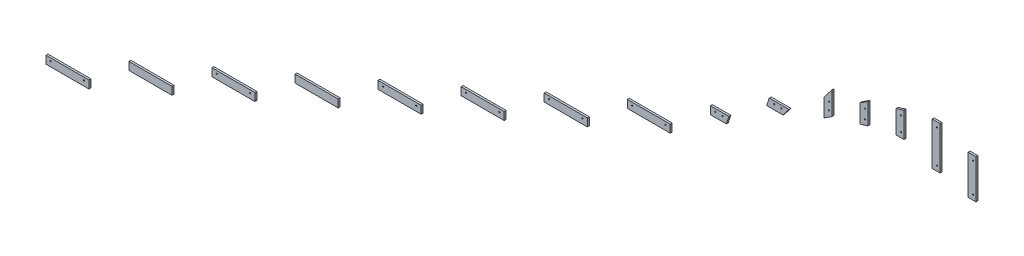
ISO-10303-21;
HEADER;
FILE_DESCRIPTION(('STEP AP214'),'2;1');
FILE_NAME('part.step','',(''),(''),'','','');
FILE_SCHEMA(('AUTOMOTIVE_DESIGN { 1 0 10303 214 1 1 1 1 }'));
ENDSEC;
DATA;
#1=APPLICATION_CONTEXT('core data for automotive mechanical design processes');
#2=APPLICATION_PROTOCOL_DEFINITION('international standard','automotive_design',2000,#1);
#3=PRODUCT_CONTEXT('',#1,'mechanical');
#4=PRODUCT('Part','Part','',(#3));
#5=PRODUCT_RELATED_PRODUCT_CATEGORY('part','',(#4));
#6=PRODUCT_DEFINITION_FORMATION('','',#4);
#7=PRODUCT_DEFINITION_CONTEXT('part definition',#1,'design');
#8=PRODUCT_DEFINITION('design','',#6,#7);
#9=PRODUCT_DEFINITION_SHAPE('','',#8);
#10=(LENGTH_UNIT() NAMED_UNIT(*) SI_UNIT(.MILLI.,.METRE.));
#11=(NAMED_UNIT(*) PLANE_ANGLE_UNIT() SI_UNIT($,.RADIAN.));
#12=(NAMED_UNIT(*) SI_UNIT($,.STERADIAN.) SOLID_ANGLE_UNIT());
#13=UNCERTAINTY_MEASURE_WITH_UNIT(LENGTH_MEASURE(1.E-05),#10,'distance_accuracy_value','');
#14=(GEOMETRIC_REPRESENTATION_CONTEXT(3) GLOBAL_UNCERTAINTY_ASSIGNED_CONTEXT((#13)) GLOBAL_UNIT_ASSIGNED_CONTEXT((#10,
#11,#12)) REPRESENTATION_CONTEXT('',''));
#15=CARTESIAN_POINT('',(0.,0.,0.));
#16=DIRECTION('',(0.,0.,1.));
#17=DIRECTION('',(1.,0.,0.));
#18=AXIS2_PLACEMENT_3D('',#15,#16,#17);
#19=CARTESIAN_POINT('',(0.,0.,880.310009));
#20=DIRECTION('',(0.,0.,1.));
#21=DIRECTION('',(1.,0.,0.));
#22=AXIS2_PLACEMENT_3D('',#19,#20,#21);
#23=PLANE('',#22);
#24=CARTESIAN_POINT('',(2166.991949,-866.616845,880.310009));
#25=DIRECTION('',(0.,0.,1.));
#26=DIRECTION('',(1.,0.,0.));
#27=AXIS2_PLACEMENT_3D('',#24,#25,#26);
#28=CIRCLE('',#27,3.00000000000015);
#29=CARTESIAN_POINT('',(2169.991949,-866.616845,880.310009));
#30=VERTEX_POINT('',#29);
#31=EDGE_CURVE('E161',#30,#30,#28,.F.);
#32=ORIENTED_EDGE('',*,*,#31,.T.);
#33=EDGE_LOOP('',(#32));
#34=FACE_BOUND('',#33,.T.);
#35=CARTESIAN_POINT('',(2166.991949,-827.31092,880.310009));
#36=DIRECTION('',(0.,0.,1.));
#37=DIRECTION('',(1.,0.,0.));
#38=AXIS2_PLACEMENT_3D('',#35,#36,#37);
#39=CIRCLE('',#38,3.00000000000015);
#40=CARTESIAN_POINT('',(2169.991949,-827.31092,880.310009));
#41=VERTEX_POINT('',#40);
#42=EDGE_CURVE('E182',#41,#41,#39,.F.);
#43=ORIENTED_EDGE('',*,*,#42,.T.);
#44=EDGE_LOOP('',(#43));
#45=FACE_BOUND('',#44,.T.);
#46=DIRECTION('',(0.614412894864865,0.788984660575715,0.));
#47=VECTOR('',#46,1.);
#48=CARTESIAN_POINT('',(2142.007828,-819.999933,880.310009));
#49=LINE('',#48,#47);
#50=CARTESIAN_POINT('',(2142.007828,-819.999933,880.310009));
#51=VERTEX_POINT('',#50);
#52=CARTESIAN_POINT('',(2182.003021,-768.640995,880.310009));
#53=VERTEX_POINT('',#52);
#54=EDGE_CURVE('E97',#51,#53,#49,.T.);
#55=ORIENTED_EDGE('',*,*,#54,.F.);
#56=DIRECTION('',(5.17446934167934E-05,0.999999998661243,0.));
#57=VECTOR('',#56,1.);
#58=CARTESIAN_POINT('',(2142.003059,-912.163973,880.310009));
#59=LINE('',#58,#57);
#60=CARTESIAN_POINT('',(2142.003059,-912.163973,880.310009));
#61=VERTEX_POINT('',#60);
#62=EDGE_CURVE('E118',#61,#51,#59,.T.);
#63=ORIENTED_EDGE('',*,*,#62,.F.);
#64=DIRECTION('',(-0.843513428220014,-0.537108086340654,0.));
#65=VECTOR('',#64,1.);
#66=CARTESIAN_POINT('',(2182.003021,-886.693954,880.310009));
#67=LINE('',#66,#65);
#68=CARTESIAN_POINT('',(2182.003021,-886.693954,880.310009));
#69=VERTEX_POINT('',#68);
#70=EDGE_CURVE('E126',#69,#61,#67,.T.);
#71=ORIENTED_EDGE('',*,*,#70,.F.);
#72=DIRECTION('',(0.,-1.,0.));
#73=VECTOR('',#72,1.);
#74=CARTESIAN_POINT('',(2182.003021,-768.640995,880.310009));
#75=LINE('',#74,#73);
#76=EDGE_CURVE('E133',#53,#69,#75,.T.);
#77=ORIENTED_EDGE('',*,*,#76,.F.);
#78=EDGE_LOOP('',(#55,#63,#71,#77));
#79=FACE_BOUND('',#78,.T.);
#80=ADVANCED_FACE('F88',(#34,#45,#79),#23,.T.);
#81=CARTESIAN_POINT('',(0.,0.,870.310009));
#82=DIRECTION('',(0.,0.,1.));
#83=DIRECTION('',(1.,0.,0.));
#84=AXIS2_PLACEMENT_3D('',#81,#82,#83);
#85=PLANE('',#84);
#86=CARTESIAN_POINT('',(2166.991949,-866.616845,870.310009));
#87=DIRECTION('',(0.,0.,1.));
#88=DIRECTION('',(1.,0.,0.));
#89=AXIS2_PLACEMENT_3D('',#86,#87,#88);
#90=CIRCLE('',#89,3.00000000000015);
#91=CARTESIAN_POINT('',(2169.991949,-866.616845,870.310009));
#92=VERTEX_POINT('',#91);
#93=EDGE_CURVE('E91',#92,#92,#90,.F.);
#94=ORIENTED_EDGE('',*,*,#93,.F.);
#95=EDGE_LOOP('',(#94));
#96=FACE_BOUND('',#95,.T.);
#97=CARTESIAN_POINT('',(2166.991949,-827.31092,870.310009));
#98=DIRECTION('',(0.,0.,1.));
#99=DIRECTION('',(1.,0.,0.));
#100=AXIS2_PLACEMENT_3D('',#97,#98,#99);
#101=CIRCLE('',#100,3.00000000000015);
#102=CARTESIAN_POINT('',(2169.991949,-827.31092,870.310009));
#103=VERTEX_POINT('',#102);
#104=EDGE_CURVE('E180',#103,#103,#101,.F.);
#105=ORIENTED_EDGE('',*,*,#104,.F.);
#106=EDGE_LOOP('',(#105));
#107=FACE_BOUND('',#106,.T.);
#108=DIRECTION('',(0.614412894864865,0.788984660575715,0.));
#109=VECTOR('',#108,1.);
#110=CARTESIAN_POINT('',(2142.007828,-819.999933,870.310009));
#111=LINE('',#110,#109);
#112=CARTESIAN_POINT('',(2142.007828,-819.999933,870.310009));
#113=VERTEX_POINT('',#112);
#114=CARTESIAN_POINT('',(2182.003021,-768.640995,870.310009));
#115=VERTEX_POINT('',#114);
#116=EDGE_CURVE('E13',#113,#115,#111,.T.);
#117=ORIENTED_EDGE('',*,*,#116,.T.);
#118=DIRECTION('',(0.,-1.,0.));
#119=VECTOR('',#118,1.);
#120=CARTESIAN_POINT('',(2182.003021,-768.640995,870.310009));
#121=LINE('',#120,#119);
#122=CARTESIAN_POINT('',(2182.003021,-886.693954,870.310009));
#123=VERTEX_POINT('',#122);
#124=EDGE_CURVE('E148',#115,#123,#121,.T.);
#125=ORIENTED_EDGE('',*,*,#124,.T.);
#126=DIRECTION('',(-0.843513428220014,-0.537108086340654,0.));
#127=VECTOR('',#126,1.);
#128=CARTESIAN_POINT('',(2182.003021,-886.693954,870.310009));
#129=LINE('',#128,#127);
#130=CARTESIAN_POINT('',(2142.003059,-912.163973,870.310009));
#131=VERTEX_POINT('',#130);
#132=EDGE_CURVE('E139',#123,#131,#129,.T.);
#133=ORIENTED_EDGE('',*,*,#132,.T.);
#134=DIRECTION('',(5.17446934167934E-05,0.999999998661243,0.));
#135=VECTOR('',#134,1.);
#136=CARTESIAN_POINT('',(2142.003059,-912.163973,870.310009));
#137=LINE('',#136,#135);
#138=EDGE_CURVE('E178',#131,#113,#137,.T.);
#139=ORIENTED_EDGE('',*,*,#138,.T.);
#140=EDGE_LOOP('',(#117,#125,#133,#139));
#141=FACE_BOUND('',#140,.T.);
#142=ADVANCED_FACE('F150',(#96,#107,#141),#85,.F.);
#143=CARTESIAN_POINT('',(2142.003059,-912.163973,870.310009));
#144=DIRECTION('',(0.999999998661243,-5.17446934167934E-05,0.));
#145=DIRECTION('',(5.17446934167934E-05,0.999999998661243,0.));
#146=AXIS2_PLACEMENT_3D('',#143,#144,#145);
#147=PLANE('',#146);
#148=ORIENTED_EDGE('',*,*,#62,.T.);
#149=DIRECTION('',(0.,0.,1.));
#150=VECTOR('',#149,1.);
#151=CARTESIAN_POINT('',(2142.007828,-819.999933,870.310009));
#152=LINE('',#151,#150);
#153=EDGE_CURVE('E174',#113,#51,#152,.T.);
#154=ORIENTED_EDGE('',*,*,#153,.F.);
#155=ORIENTED_EDGE('',*,*,#138,.F.);
#156=DIRECTION('',(0.,0.,1.));
#157=VECTOR('',#156,1.);
#158=CARTESIAN_POINT('',(2142.003059,-912.163973,870.310009));
#159=LINE('',#158,#157);
#160=EDGE_CURVE('E142',#131,#61,#159,.T.);
#161=ORIENTED_EDGE('',*,*,#160,.T.);
#162=EDGE_LOOP('',(#148,#154,#155,#161));
#163=FACE_BOUND('',#162,.T.);
#164=ADVANCED_FACE('F200',(#163),#147,.F.);
#165=CARTESIAN_POINT('',(2182.003021,-886.693954,870.310009));
#166=DIRECTION('',(-0.537108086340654,0.843513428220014,0.));
#167=DIRECTION('',(-0.843513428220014,-0.537108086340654,0.));
#168=AXIS2_PLACEMENT_3D('',#165,#166,#167);
#169=PLANE('',#168);
#170=ORIENTED_EDGE('',*,*,#70,.T.);
#171=ORIENTED_EDGE('',*,*,#160,.F.);
#172=ORIENTED_EDGE('',*,*,#132,.F.);
#173=DIRECTION('',(0.,0.,1.));
#174=VECTOR('',#173,1.);
#175=CARTESIAN_POINT('',(2182.003021,-886.693954,870.310009));
#176=LINE('',#175,#174);
#177=EDGE_CURVE('E141',#123,#69,#176,.T.);
#178=ORIENTED_EDGE('',*,*,#177,.T.);
#179=EDGE_LOOP('',(#170,#171,#172,#178));
#180=FACE_BOUND('',#179,.T.);
#181=ADVANCED_FACE('F140',(#180),#169,.F.);
#182=CARTESIAN_POINT('',(2182.003021,-768.640995,870.310009));
#183=DIRECTION('',(-1.,0.,0.));
#184=DIRECTION('',(0.,0.,1.));
#185=AXIS2_PLACEMENT_3D('',#182,#183,#184);
#186=PLANE('',#185);
#187=ORIENTED_EDGE('',*,*,#76,.T.);
#188=ORIENTED_EDGE('',*,*,#177,.F.);
#189=ORIENTED_EDGE('',*,*,#124,.F.);
#190=DIRECTION('',(0.,0.,1.));
#191=VECTOR('',#190,1.);
#192=CARTESIAN_POINT('',(2182.003021,-768.640995,870.310009));
#193=LINE('',#192,#191);
#194=EDGE_CURVE('E151',#115,#53,#193,.T.);
#195=ORIENTED_EDGE('',*,*,#194,.T.);
#196=EDGE_LOOP('',(#187,#188,#189,#195));
#197=FACE_BOUND('',#196,.T.);
#198=ADVANCED_FACE('F147',(#197),#186,.F.);
#199=CARTESIAN_POINT('',(2142.007828,-819.999933,870.310009));
#200=DIRECTION('',(0.788984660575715,-0.614412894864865,0.));
#201=DIRECTION('',(0.614412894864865,0.788984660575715,0.));
#202=AXIS2_PLACEMENT_3D('',#199,#200,#201);
#203=PLANE('',#202);
#204=ORIENTED_EDGE('',*,*,#54,.T.);
#205=ORIENTED_EDGE('',*,*,#194,.F.);
#206=ORIENTED_EDGE('',*,*,#116,.F.);
#207=ORIENTED_EDGE('',*,*,#153,.T.);
#208=EDGE_LOOP('',(#204,#205,#206,#207));
#209=FACE_BOUND('',#208,.T.);
#210=ADVANCED_FACE('F201',(#209),#203,.F.);
#211=CARTESIAN_POINT('',(2166.991949,-827.31092,890.266845));
#212=DIRECTION('',(0.,0.,-1.));
#213=DIRECTION('',(-1.,0.,0.));
#214=AXIS2_PLACEMENT_3D('',#211,#212,#213);
#215=CYLINDRICAL_SURFACE('',#214,3.00000000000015);
#216=ORIENTED_EDGE('',*,*,#42,.F.);
#217=EDGE_LOOP('',(#216));
#218=FACE_BOUND('',#217,.T.);
#219=ORIENTED_EDGE('',*,*,#104,.T.);
#220=EDGE_LOOP('',(#219));
#221=FACE_BOUND('',#220,.T.);
#222=ADVANCED_FACE('F205',(#218,#221),#215,.F.);
#223=CARTESIAN_POINT('',(2166.991949,-866.616845,890.266845));
#224=DIRECTION('',(0.,0.,-1.));
#225=DIRECTION('',(-1.,0.,0.));
#226=AXIS2_PLACEMENT_3D('',#223,#224,#225);
#227=CYLINDRICAL_SURFACE('',#226,3.00000000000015);
#228=ORIENTED_EDGE('',*,*,#31,.F.);
#229=EDGE_LOOP('',(#228));
#230=FACE_BOUND('',#229,.T.);
#231=ORIENTED_EDGE('',*,*,#93,.T.);
#232=EDGE_LOOP('',(#231));
#233=FACE_BOUND('',#232,.T.);
#234=ADVANCED_FACE('F212',(#230,#233),#227,.F.);
#235=CLOSED_SHELL('',(#80,#142,#164,#181,#198,#210,#222,#234));
#236=MANIFOLD_SOLID_BREP('B2',#235);
#237=CARTESIAN_POINT('',(0.,0.,696.249970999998));
#238=DIRECTION('',(0.,0.,1.));
#239=DIRECTION('',(1.,0.,0.));
#240=AXIS2_PLACEMENT_3D('',#237,#238,#239);
#241=PLANE('',#240);
#242=CARTESIAN_POINT('',(2166.996002,-997.976959,696.249970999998));
#243=DIRECTION('',(0.,0.,1.));
#244=DIRECTION('',(1.,0.,0.));
#245=AXIS2_PLACEMENT_3D('',#242,#243,#244);
#246=CIRCLE('',#245,3.00000000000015);
#247=CARTESIAN_POINT('',(2169.996002,-997.976959,696.249970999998));
#248=VERTEX_POINT('',#247);
#249=EDGE_CURVE('E360',#248,#248,#246,.F.);
#250=ORIENTED_EDGE('',*,*,#249,.T.);
#251=EDGE_LOOP('',(#250));
#252=FACE_BOUND('',#251,.T.);
#253=CARTESIAN_POINT('',(2166.996002,-951.067984,696.249970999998));
#254=DIRECTION('',(0.,0.,1.));
#255=DIRECTION('',(1.,0.,0.));
#256=AXIS2_PLACEMENT_3D('',#253,#254,#255);
#257=CIRCLE('',#256,3.00000000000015);
#258=CARTESIAN_POINT('',(2169.996002,-951.067984,696.249970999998));
#259=VERTEX_POINT('',#258);
#260=EDGE_CURVE('E381',#259,#259,#257,.F.);
#261=ORIENTED_EDGE('',*,*,#260,.T.);
#262=EDGE_LOOP('',(#261));
#263=FACE_BOUND('',#262,.T.);
#264=DIRECTION('',(0.843466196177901,0.537182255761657,0.));
#265=VECTOR('',#264,1.);
#266=CARTESIAN_POINT('',(2142.008781,-937.277019,696.249971));
#267=LINE('',#266,#265);
#268=CARTESIAN_POINT('',(2142.008781,-937.277019,696.249971));
#269=VERTEX_POINT('',#268);
#270=CARTESIAN_POINT('',(2182.003975,-911.805093,696.249971));
#271=VERTEX_POINT('',#270);
#272=EDGE_CURVE('E296',#269,#271,#267,.T.);
#273=ORIENTED_EDGE('',*,*,#272,.F.);
#274=DIRECTION('',(5.04592884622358E-05,0.99999999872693,0.));
#275=VECTOR('',#274,1.);
#276=CARTESIAN_POINT('',(2142.004013,-1031.769037,696.249971));
#277=LINE('',#276,#275);
#278=CARTESIAN_POINT('',(2142.004013,-1031.769037,696.249971));
#279=VERTEX_POINT('',#278);
#280=EDGE_CURVE('E317',#279,#269,#277,.T.);
#281=ORIENTED_EDGE('',*,*,#280,.F.);
#282=DIRECTION('',(-0.956673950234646,-0.291161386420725,0.));
#283=VECTOR('',#282,1.);
#284=CARTESIAN_POINT('',(2182.003975,-1019.595146,696.249971));
#285=LINE('',#284,#283);
#286=CARTESIAN_POINT('',(2182.003975,-1019.595146,696.249971));
#287=VERTEX_POINT('',#286);
#288=EDGE_CURVE('E325',#287,#279,#285,.T.);
#289=ORIENTED_EDGE('',*,*,#288,.F.);
#290=DIRECTION('',(0.,-1.,0.));
#291=VECTOR('',#290,1.);
#292=CARTESIAN_POINT('',(2182.003975,-911.805093,696.249971));
#293=LINE('',#292,#291);
#294=EDGE_CURVE('E332',#271,#287,#293,.T.);
#295=ORIENTED_EDGE('',*,*,#294,.F.);
#296=EDGE_LOOP('',(#273,#281,#289,#295));
#297=FACE_BOUND('',#296,.T.);
#298=ADVANCED_FACE('F287',(#252,#263,#297),#241,.T.);
#299=CARTESIAN_POINT('',(0.,0.,686.249970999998));
#300=DIRECTION('',(0.,0.,1.));
#301=DIRECTION('',(1.,0.,0.));
#302=AXIS2_PLACEMENT_3D('',#299,#300,#301);
#303=PLANE('',#302);
#304=CARTESIAN_POINT('',(2166.996002,-997.976959,686.249970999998));
#305=DIRECTION('',(0.,0.,1.));
#306=DIRECTION('',(1.,0.,0.));
#307=AXIS2_PLACEMENT_3D('',#304,#305,#306);
#308=CIRCLE('',#307,3.00000000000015);
#309=CARTESIAN_POINT('',(2169.996002,-997.976959,686.249970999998));
#310=VERTEX_POINT('',#309);
#311=EDGE_CURVE('E290',#310,#310,#308,.F.);
#312=ORIENTED_EDGE('',*,*,#311,.F.);
#313=EDGE_LOOP('',(#312));
#314=FACE_BOUND('',#313,.T.);
#315=CARTESIAN_POINT('',(2166.996002,-951.067984,686.249970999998));
#316=DIRECTION('',(0.,0.,1.));
#317=DIRECTION('',(1.,0.,0.));
#318=AXIS2_PLACEMENT_3D('',#315,#316,#317);
#319=CIRCLE('',#318,3.00000000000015);
#320=CARTESIAN_POINT('',(2169.996002,-951.067984,686.249970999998));
#321=VERTEX_POINT('',#320);
#322=EDGE_CURVE('E379',#321,#321,#319,.F.);
#323=ORIENTED_EDGE('',*,*,#322,.F.);
#324=EDGE_LOOP('',(#323));
#325=FACE_BOUND('',#324,.T.);
#326=DIRECTION('',(0.843466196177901,0.537182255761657,0.));
#327=VECTOR('',#326,1.);
#328=CARTESIAN_POINT('',(2142.008781,-937.277019,686.249971));
#329=LINE('',#328,#327);
#330=CARTESIAN_POINT('',(2142.008781,-937.277019,686.249971));
#331=VERTEX_POINT('',#330);
#332=CARTESIAN_POINT('',(2182.003975,-911.805093,686.249971));
#333=VERTEX_POINT('',#332);
#334=EDGE_CURVE('E86',#331,#333,#329,.T.);
#335=ORIENTED_EDGE('',*,*,#334,.T.);
#336=DIRECTION('',(0.,-1.,0.));
#337=VECTOR('',#336,1.);
#338=CARTESIAN_POINT('',(2182.003975,-911.805093,686.249971));
#339=LINE('',#338,#337);
#340=CARTESIAN_POINT('',(2182.003975,-1019.595146,686.249971));
#341=VERTEX_POINT('',#340);
#342=EDGE_CURVE('E347',#333,#341,#339,.T.);
#343=ORIENTED_EDGE('',*,*,#342,.T.);
#344=DIRECTION('',(-0.956673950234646,-0.291161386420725,0.));
#345=VECTOR('',#344,1.);
#346=CARTESIAN_POINT('',(2182.003975,-1019.595146,686.249971));
#347=LINE('',#346,#345);
#348=CARTESIAN_POINT('',(2142.004013,-1031.769037,686.249971));
#349=VERTEX_POINT('',#348);
#350=EDGE_CURVE('E338',#341,#349,#347,.T.);
#351=ORIENTED_EDGE('',*,*,#350,.T.);
#352=DIRECTION('',(5.04592884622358E-05,0.99999999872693,0.));
#353=VECTOR('',#352,1.);
#354=CARTESIAN_POINT('',(2142.004013,-1031.769037,686.249971));
#355=LINE('',#354,#353);
#356=EDGE_CURVE('E377',#349,#331,#355,.T.);
#357=ORIENTED_EDGE('',*,*,#356,.T.);
#358=EDGE_LOOP('',(#335,#343,#351,#357));
#359=FACE_BOUND('',#358,.T.);
#360=ADVANCED_FACE('F349',(#314,#325,#359),#303,.F.);
#361=CARTESIAN_POINT('',(2142.004013,-1031.769037,686.249971));
#362=DIRECTION('',(0.99999999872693,-5.04592884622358E-05,0.));
#363=DIRECTION('',(5.04592884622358E-05,0.99999999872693,0.));
#364=AXIS2_PLACEMENT_3D('',#361,#362,#363);
#365=PLANE('',#364);
#366=ORIENTED_EDGE('',*,*,#280,.T.);
#367=DIRECTION('',(0.,0.,1.));
#368=VECTOR('',#367,1.);
#369=CARTESIAN_POINT('',(2142.008781,-937.277019,686.249971));
#370=LINE('',#369,#368);
#371=EDGE_CURVE('E373',#331,#269,#370,.T.);
#372=ORIENTED_EDGE('',*,*,#371,.F.);
#373=ORIENTED_EDGE('',*,*,#356,.F.);
#374=DIRECTION('',(0.,0.,1.));
#375=VECTOR('',#374,1.);
#376=CARTESIAN_POINT('',(2142.004013,-1031.769037,686.249971));
#377=LINE('',#376,#375);
#378=EDGE_CURVE('E341',#349,#279,#377,.T.);
#379=ORIENTED_EDGE('',*,*,#378,.T.);
#380=EDGE_LOOP('',(#366,#372,#373,#379));
#381=FACE_BOUND('',#380,.T.);
#382=ADVANCED_FACE('F399',(#381),#365,.F.);
#383=CARTESIAN_POINT('',(2182.003975,-1019.595146,686.249971));
#384=DIRECTION('',(-0.291161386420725,0.956673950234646,0.));
#385=DIRECTION('',(-0.956673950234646,-0.291161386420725,0.));
#386=AXIS2_PLACEMENT_3D('',#383,#384,#385);
#387=PLANE('',#386);
#388=ORIENTED_EDGE('',*,*,#288,.T.);
#389=ORIENTED_EDGE('',*,*,#378,.F.);
#390=ORIENTED_EDGE('',*,*,#350,.F.);
#391=DIRECTION('',(0.,0.,1.));
#392=VECTOR('',#391,1.);
#393=CARTESIAN_POINT('',(2182.003975,-1019.595146,686.249971));
#394=LINE('',#393,#392);
#395=EDGE_CURVE('E340',#341,#287,#394,.T.);
#396=ORIENTED_EDGE('',*,*,#395,.T.);
#397=EDGE_LOOP('',(#388,#389,#390,#396));
#398=FACE_BOUND('',#397,.T.);
#399=ADVANCED_FACE('F339',(#398),#387,.F.);
#400=CARTESIAN_POINT('',(2182.003975,-911.805093,686.249971));
#401=DIRECTION('',(-1.,0.,0.));
#402=DIRECTION('',(0.,0.,1.));
#403=AXIS2_PLACEMENT_3D('',#400,#401,#402);
#404=PLANE('',#403);
#405=ORIENTED_EDGE('',*,*,#294,.T.);
#406=ORIENTED_EDGE('',*,*,#395,.F.);
#407=ORIENTED_EDGE('',*,*,#342,.F.);
#408=DIRECTION('',(0.,0.,1.));
#409=VECTOR('',#408,1.);
#410=CARTESIAN_POINT('',(2182.003975,-911.805093,686.249971));
#411=LINE('',#410,#409);
#412=EDGE_CURVE('E350',#333,#271,#411,.T.);
#413=ORIENTED_EDGE('',*,*,#412,.T.);
#414=EDGE_LOOP('',(#405,#406,#407,#413));
#415=FACE_BOUND('',#414,.T.);
#416=ADVANCED_FACE('F346',(#415),#404,.F.);
#417=CARTESIAN_POINT('',(2142.008781,-937.277019,686.249971));
#418=DIRECTION('',(0.537182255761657,-0.843466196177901,0.));
#419=DIRECTION('',(0.843466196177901,0.537182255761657,0.));
#420=AXIS2_PLACEMENT_3D('',#417,#418,#419);
#421=PLANE('',#420);
#422=ORIENTED_EDGE('',*,*,#272,.T.);
#423=ORIENTED_EDGE('',*,*,#412,.F.);
#424=ORIENTED_EDGE('',*,*,#334,.F.);
#425=ORIENTED_EDGE('',*,*,#371,.T.);
#426=EDGE_LOOP('',(#422,#423,#424,#425));
#427=FACE_BOUND('',#426,.T.);
#428=ADVANCED_FACE('F400',(#427),#421,.F.);
#429=CARTESIAN_POINT('',(2166.996002,-951.067984,706.206868));
#430=DIRECTION('',(0.,0.,-1.));
#431=DIRECTION('',(-1.,0.,0.));
#432=AXIS2_PLACEMENT_3D('',#429,#430,#431);
#433=CYLINDRICAL_SURFACE('',#432,3.00000000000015);
#434=ORIENTED_EDGE('',*,*,#260,.F.);
#435=EDGE_LOOP('',(#434));
#436=FACE_BOUND('',#435,.T.);
#437=ORIENTED_EDGE('',*,*,#322,.T.);
#438=EDGE_LOOP('',(#437));
#439=FACE_BOUND('',#438,.T.);
#440=ADVANCED_FACE('F404',(#436,#439),#433,.F.);
#441=CARTESIAN_POINT('',(2166.996002,-997.976959,706.206868));
#442=DIRECTION('',(0.,0.,-1.));
#443=DIRECTION('',(-1.,0.,0.));
#444=AXIS2_PLACEMENT_3D('',#441,#442,#443);
#445=CYLINDRICAL_SURFACE('',#444,3.00000000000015);
#446=ORIENTED_EDGE('',*,*,#249,.F.);
#447=EDGE_LOOP('',(#446));
#448=FACE_BOUND('',#447,.T.);
#449=ORIENTED_EDGE('',*,*,#311,.T.);
#450=EDGE_LOOP('',(#449));
#451=FACE_BOUND('',#450,.T.);
#452=ADVANCED_FACE('F411',(#448,#451),#445,.F.);
#453=CLOSED_SHELL('',(#298,#360,#382,#399,#416,#428,#440,#452));
#454=MANIFOLD_SOLID_BREP('B7',#453);
#455=CARTESIAN_POINT('',(0.,0.,144.073079));
#456=DIRECTION('',(0.,0.,1.));
#457=DIRECTION('',(1.,0.,0.));
#458=AXIS2_PLACEMENT_3D('',#455,#456,#457);
#459=PLANE('',#458);
#460=CARTESIAN_POINT('',(2166.996002,-1606.633902,144.073079));
#461=DIRECTION('',(0.,0.,1.));
#462=DIRECTION('',(1.,0.,0.));
#463=AXIS2_PLACEMENT_3D('',#460,#461,#462);
#464=CIRCLE('',#463,3.00000000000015);
#465=CARTESIAN_POINT('',(2169.996002,-1606.633902,144.073079));
#466=VERTEX_POINT('',#465);
#467=EDGE_CURVE('E559',#466,#466,#464,.F.);
#468=ORIENTED_EDGE('',*,*,#467,.T.);
#469=EDGE_LOOP('',(#468));
#470=FACE_BOUND('',#469,.T.);
#471=CARTESIAN_POINT('',(2166.996002,-1457.309961,144.073079));
#472=DIRECTION('',(0.,0.,1.));
#473=DIRECTION('',(1.,0.,0.));
#474=AXIS2_PLACEMENT_3D('',#471,#472,#473);
#475=CIRCLE('',#474,3.00000000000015);
#476=CARTESIAN_POINT('',(2169.996002,-1457.309961,144.073079));
#477=VERTEX_POINT('',#476);
#478=EDGE_CURVE('E580',#477,#477,#475,.F.);
#479=ORIENTED_EDGE('',*,*,#478,.T.);
#480=EDGE_LOOP('',(#479));
#481=FACE_BOUND('',#480,.T.);
#482=DIRECTION('',(0.999999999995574,-2.97535748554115E-06,0.));
#483=VECTOR('',#482,1.);
#484=CARTESIAN_POINT('',(2142.00592,-1432.156801,144.073079));
#485=LINE('',#484,#483);
#486=CARTESIAN_POINT('',(2142.00592,-1432.156801,144.073079));
#487=VERTEX_POINT('',#486);
#488=CARTESIAN_POINT('',(2182.001114,-1432.15692,144.073079));
#489=VERTEX_POINT('',#488);
#490=EDGE_CURVE('E495',#487,#489,#485,.T.);
#491=ORIENTED_EDGE('',*,*,#490,.F.);
#492=DIRECTION('',(2.38790211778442E-05,0.999999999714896,0.));
#493=VECTOR('',#492,1.);
#494=CARTESIAN_POINT('',(2142.001152,-1631.829977,144.073079));
#495=LINE('',#494,#493);
#496=CARTESIAN_POINT('',(2142.001152,-1631.829977,144.073079));
#497=VERTEX_POINT('',#496);
#498=EDGE_CURVE('E516',#497,#487,#495,.T.);
#499=ORIENTED_EDGE('',*,*,#498,.F.);
#500=DIRECTION('',(-0.999999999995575,-2.97500282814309E-06,0.));
#501=VECTOR('',#500,1.);
#502=CARTESIAN_POINT('',(2182.001114,-1631.829858,144.073079));
#503=LINE('',#502,#501);
#504=CARTESIAN_POINT('',(2182.001114,-1631.829858,144.073079));
#505=VERTEX_POINT('',#504);
#506=EDGE_CURVE('E524',#505,#497,#503,.T.);
#507=ORIENTED_EDGE('',*,*,#506,.F.);
#508=DIRECTION('',(0.,-1.,0.));
#509=VECTOR('',#508,1.);
#510=CARTESIAN_POINT('',(2182.001114,-1432.15692,144.073079));
#511=LINE('',#510,#509);
#512=EDGE_CURVE('E531',#489,#505,#511,.T.);
#513=ORIENTED_EDGE('',*,*,#512,.F.);
#514=EDGE_LOOP('',(#491,#499,#507,#513));
#515=FACE_BOUND('',#514,.T.);
#516=ADVANCED_FACE('F486',(#470,#481,#515),#459,.T.);
#517=CARTESIAN_POINT('',(0.,0.,134.073079));
#518=DIRECTION('',(0.,0.,1.));
#519=DIRECTION('',(1.,0.,0.));
#520=AXIS2_PLACEMENT_3D('',#517,#518,#519);
#521=PLANE('',#520);
#522=CARTESIAN_POINT('',(2166.996002,-1606.633902,134.073079));
#523=DIRECTION('',(0.,0.,1.));
#524=DIRECTION('',(1.,0.,0.));
#525=AXIS2_PLACEMENT_3D('',#522,#523,#524);
#526=CIRCLE('',#525,3.00000000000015);
#527=CARTESIAN_POINT('',(2169.996002,-1606.633902,134.073079));
#528=VERTEX_POINT('',#527);
#529=EDGE_CURVE('E489',#528,#528,#526,.F.);
#530=ORIENTED_EDGE('',*,*,#529,.F.);
#531=EDGE_LOOP('',(#530));
#532=FACE_BOUND('',#531,.T.);
#533=CARTESIAN_POINT('',(2166.996002,-1457.309961,134.073079));
#534=DIRECTION('',(0.,0.,1.));
#535=DIRECTION('',(1.,0.,0.));
#536=AXIS2_PLACEMENT_3D('',#533,#534,#535);
#537=CIRCLE('',#536,3.00000000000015);
#538=CARTESIAN_POINT('',(2169.996002,-1457.309961,134.073079));
#539=VERTEX_POINT('',#538);
#540=EDGE_CURVE('E578',#539,#539,#537,.F.);
#541=ORIENTED_EDGE('',*,*,#540,.F.);
#542=EDGE_LOOP('',(#541));
#543=FACE_BOUND('',#542,.T.);
#544=DIRECTION('',(0.999999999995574,-2.97535748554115E-06,0.));
#545=VECTOR('',#544,1.);
#546=CARTESIAN_POINT('',(2142.00592,-1432.156801,134.073079));
#547=LINE('',#546,#545);
#548=CARTESIAN_POINT('',(2142.00592,-1432.156801,134.073079));
#549=VERTEX_POINT('',#548);
#550=CARTESIAN_POINT('',(2182.001114,-1432.15692,134.073079));
#551=VERTEX_POINT('',#550);
#552=EDGE_CURVE('E285',#549,#551,#547,.T.);
#553=ORIENTED_EDGE('',*,*,#552,.T.);
#554=DIRECTION('',(0.,-1.,0.));
#555=VECTOR('',#554,1.);
#556=CARTESIAN_POINT('',(2182.001114,-1432.15692,134.073079));
#557=LINE('',#556,#555);
#558=CARTESIAN_POINT('',(2182.001114,-1631.829858,134.073079));
#559=VERTEX_POINT('',#558);
#560=EDGE_CURVE('E546',#551,#559,#557,.T.);
#561=ORIENTED_EDGE('',*,*,#560,.T.);
#562=DIRECTION('',(-0.999999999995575,-2.97500282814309E-06,0.));
#563=VECTOR('',#562,1.);
#564=CARTESIAN_POINT('',(2182.001114,-1631.829858,134.073079));
#565=LINE('',#564,#563);
#566=CARTESIAN_POINT('',(2142.001152,-1631.829977,134.073079));
#567=VERTEX_POINT('',#566);
#568=EDGE_CURVE('E537',#559,#567,#565,.T.);
#569=ORIENTED_EDGE('',*,*,#568,.T.);
#570=DIRECTION('',(2.38790211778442E-05,0.999999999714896,0.));
#571=VECTOR('',#570,1.);
#572=CARTESIAN_POINT('',(2142.001152,-1631.829977,134.073079));
#573=LINE('',#572,#571);
#574=EDGE_CURVE('E576',#567,#549,#573,.T.);
#575=ORIENTED_EDGE('',*,*,#574,.T.);
#576=EDGE_LOOP('',(#553,#561,#569,#575));
#577=FACE_BOUND('',#576,.T.);
#578=ADVANCED_FACE('F548',(#532,#543,#577),#521,.F.);
#579=CARTESIAN_POINT('',(2142.001152,-1631.829977,134.073079));
#580=DIRECTION('',(0.999999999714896,-2.38790211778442E-05,0.));
#581=DIRECTION('',(2.38790211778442E-05,0.999999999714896,0.));
#582=AXIS2_PLACEMENT_3D('',#579,#580,#581);
#583=PLANE('',#582);
#584=ORIENTED_EDGE('',*,*,#498,.T.);
#585=DIRECTION('',(0.,0.,1.));
#586=VECTOR('',#585,1.);
#587=CARTESIAN_POINT('',(2142.00592,-1432.156801,134.073079));
#588=LINE('',#587,#586);
#589=EDGE_CURVE('E572',#549,#487,#588,.T.);
#590=ORIENTED_EDGE('',*,*,#589,.F.);
#591=ORIENTED_EDGE('',*,*,#574,.F.);
#592=DIRECTION('',(0.,0.,1.));
#593=VECTOR('',#592,1.);
#594=CARTESIAN_POINT('',(2142.001152,-1631.829977,134.073079));
#595=LINE('',#594,#593);
#596=EDGE_CURVE('E540',#567,#497,#595,.T.);
#597=ORIENTED_EDGE('',*,*,#596,.T.);
#598=EDGE_LOOP('',(#584,#590,#591,#597));
#599=FACE_BOUND('',#598,.T.);
#600=ADVANCED_FACE('F598',(#599),#583,.F.);
#601=CARTESIAN_POINT('',(2182.001114,-1631.829858,134.073079));
#602=DIRECTION('',(-2.97500282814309E-06,0.999999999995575,0.));
#603=DIRECTION('',(-0.999999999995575,-2.97500282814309E-06,0.));
#604=AXIS2_PLACEMENT_3D('',#601,#602,#603);
#605=PLANE('',#604);
#606=ORIENTED_EDGE('',*,*,#506,.T.);
#607=ORIENTED_EDGE('',*,*,#596,.F.);
#608=ORIENTED_EDGE('',*,*,#568,.F.);
#609=DIRECTION('',(0.,0.,1.));
#610=VECTOR('',#609,1.);
#611=CARTESIAN_POINT('',(2182.001114,-1631.829858,134.073079));
#612=LINE('',#611,#610);
#613=EDGE_CURVE('E539',#559,#505,#612,.T.);
#614=ORIENTED_EDGE('',*,*,#613,.T.);
#615=EDGE_LOOP('',(#606,#607,#608,#614));
#616=FACE_BOUND('',#615,.T.);
#617=ADVANCED_FACE('F538',(#616),#605,.F.);
#618=CARTESIAN_POINT('',(2182.001114,-1432.15692,134.073079));
#619=DIRECTION('',(-1.,0.,0.));
#620=DIRECTION('',(0.,0.,1.));
#621=AXIS2_PLACEMENT_3D('',#618,#619,#620);
#622=PLANE('',#621);
#623=ORIENTED_EDGE('',*,*,#512,.T.);
#624=ORIENTED_EDGE('',*,*,#613,.F.);
#625=ORIENTED_EDGE('',*,*,#560,.F.);
#626=DIRECTION('',(0.,0.,1.));
#627=VECTOR('',#626,1.);
#628=CARTESIAN_POINT('',(2182.001114,-1432.15692,134.073079));
#629=LINE('',#628,#627);
#630=EDGE_CURVE('E549',#551,#489,#629,.T.);
#631=ORIENTED_EDGE('',*,*,#630,.T.);
#632=EDGE_LOOP('',(#623,#624,#625,#631));
#633=FACE_BOUND('',#632,.T.);
#634=ADVANCED_FACE('F545',(#633),#622,.F.);
#635=CARTESIAN_POINT('',(2142.00592,-1432.156801,134.073079));
#636=DIRECTION('',(-2.97535748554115E-06,-0.999999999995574,0.));
#637=DIRECTION('',(0.999999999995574,-2.97535748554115E-06,0.));
#638=AXIS2_PLACEMENT_3D('',#635,#636,#637);
#639=PLANE('',#638);
#640=ORIENTED_EDGE('',*,*,#490,.T.);
#641=ORIENTED_EDGE('',*,*,#630,.F.);
#642=ORIENTED_EDGE('',*,*,#552,.F.);
#643=ORIENTED_EDGE('',*,*,#589,.T.);
#644=EDGE_LOOP('',(#640,#641,#642,#643));
#645=FACE_BOUND('',#644,.T.);
#646=ADVANCED_FACE('F599',(#645),#639,.F.);
#647=CARTESIAN_POINT('',(2166.996002,-1457.309961,154.026756));
#648=DIRECTION('',(0.,0.,-1.));
#649=DIRECTION('',(-1.,0.,0.));
#650=AXIS2_PLACEMENT_3D('',#647,#648,#649);
#651=CYLINDRICAL_SURFACE('',#650,3.00000000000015);
#652=ORIENTED_EDGE('',*,*,#478,.F.);
#653=EDGE_LOOP('',(#652));
#654=FACE_BOUND('',#653,.T.);
#655=ORIENTED_EDGE('',*,*,#540,.T.);
#656=EDGE_LOOP('',(#655));
#657=FACE_BOUND('',#656,.T.);
#658=ADVANCED_FACE('F603',(#654,#657),#651,.F.);
#659=CARTESIAN_POINT('',(2166.996002,-1606.633902,154.026756));
#660=DIRECTION('',(0.,0.,-1.));
#661=DIRECTION('',(-1.,0.,0.));
#662=AXIS2_PLACEMENT_3D('',#659,#660,#661);
#663=CYLINDRICAL_SURFACE('',#662,3.00000000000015);
#664=ORIENTED_EDGE('',*,*,#467,.F.);
#665=EDGE_LOOP('',(#664));
#666=FACE_BOUND('',#665,.T.);
#667=ORIENTED_EDGE('',*,*,#529,.T.);
#668=EDGE_LOOP('',(#667));
#669=FACE_BOUND('',#668,.T.);
#670=ADVANCED_FACE('F610',(#666,#669),#663,.F.);
#671=CLOSED_SHELL('',(#516,#578,#600,#617,#634,#646,#658,#670));
#672=MANIFOLD_SOLID_BREP('B80',#671);
#673=CARTESIAN_POINT('',(0.,0.,328.132043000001));
#674=DIRECTION('',(0.,0.,1.));
#675=DIRECTION('',(1.,0.,0.));
#676=AXIS2_PLACEMENT_3D('',#673,#674,#675);
#677=PLANE('',#676);
#678=CARTESIAN_POINT('',(2166.996002,-1386.868,328.132043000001));
#679=DIRECTION('',(0.,0.,1.));
#680=DIRECTION('',(1.,0.,0.));
#681=AXIS2_PLACEMENT_3D('',#678,#679,#680);
#682=CIRCLE('',#681,3.00000000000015);
#683=CARTESIAN_POINT('',(2169.996002,-1386.868,328.132043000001));
#684=VERTEX_POINT('',#683);
#685=EDGE_CURVE('E758',#684,#684,#682,.F.);
#686=ORIENTED_EDGE('',*,*,#685,.T.);
#687=EDGE_LOOP('',(#686));
#688=FACE_BOUND('',#687,.T.);
#689=CARTESIAN_POINT('',(2166.996002,-1218.095899,328.132043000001));
#690=DIRECTION('',(0.,0.,1.));
#691=DIRECTION('',(1.,0.,0.));
#692=AXIS2_PLACEMENT_3D('',#689,#690,#691);
#693=CIRCLE('',#692,3.00000000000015);
#694=CARTESIAN_POINT('',(2169.996002,-1218.095899,328.132043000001));
#695=VERTEX_POINT('',#694);
#696=EDGE_CURVE('E779',#695,#695,#693,.F.);
#697=ORIENTED_EDGE('',*,*,#696,.T.);
#698=EDGE_LOOP('',(#697));
#699=FACE_BOUND('',#698,.T.);
#700=DIRECTION('',(1.,0.,0.));
#701=VECTOR('',#700,1.);
#702=CARTESIAN_POINT('',(2142.006874,-1193.108916,328.132043));
#703=LINE('',#702,#701);
#704=CARTESIAN_POINT('',(2142.006874,-1193.108916,328.132043));
#705=VERTEX_POINT('',#704);
#706=CARTESIAN_POINT('',(2182.002068,-1193.108916,328.132043));
#707=VERTEX_POINT('',#706);
#708=EDGE_CURVE('E694',#705,#707,#703,.T.);
#709=ORIENTED_EDGE('',*,*,#708,.F.);
#710=DIRECTION('',(2.1799458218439E-05,0.999999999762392,0.));
#711=VECTOR('',#710,1.);
#712=CARTESIAN_POINT('',(2142.002106,-1411.829948,328.132043));
#713=LINE('',#712,#711);
#714=CARTESIAN_POINT('',(2142.002106,-1411.829948,328.132043));
#715=VERTEX_POINT('',#714);
#716=EDGE_CURVE('E715',#715,#705,#713,.T.);
#717=ORIENTED_EDGE('',*,*,#716,.F.);
#718=DIRECTION('',(-1.,0.,0.));
#719=VECTOR('',#718,1.);
#720=CARTESIAN_POINT('',(2182.002068,-1411.829948,328.132043));
#721=LINE('',#720,#719);
#722=CARTESIAN_POINT('',(2182.002068,-1411.829948,328.132043));
#723=VERTEX_POINT('',#722);
#724=EDGE_CURVE('E723',#723,#715,#721,.T.);
#725=ORIENTED_EDGE('',*,*,#724,.F.);
#726=DIRECTION('',(0.,-1.,0.));
#727=VECTOR('',#726,1.);
#728=CARTESIAN_POINT('',(2182.002068,-1193.108916,328.132043));
#729=LINE('',#728,#727);
#730=EDGE_CURVE('E730',#707,#723,#729,.T.);
#731=ORIENTED_EDGE('',*,*,#730,.F.);
#732=EDGE_LOOP('',(#709,#717,#725,#731));
#733=FACE_BOUND('',#732,.T.);
#734=ADVANCED_FACE('F685',(#688,#699,#733),#677,.T.);
#735=CARTESIAN_POINT('',(0.,0.,318.132043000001));
#736=DIRECTION('',(0.,0.,1.));
#737=DIRECTION('',(1.,0.,0.));
#738=AXIS2_PLACEMENT_3D('',#735,#736,#737);
#739=PLANE('',#738);
#740=CARTESIAN_POINT('',(2166.996002,-1386.868,318.132043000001));
#741=DIRECTION('',(0.,0.,1.));
#742=DIRECTION('',(1.,0.,0.));
#743=AXIS2_PLACEMENT_3D('',#740,#741,#742);
#744=CIRCLE('',#743,3.00000000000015);
#745=CARTESIAN_POINT('',(2169.996002,-1386.868,318.132043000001));
#746=VERTEX_POINT('',#745);
#747=EDGE_CURVE('E688',#746,#746,#744,.F.);
#748=ORIENTED_EDGE('',*,*,#747,.F.);
#749=EDGE_LOOP('',(#748));
#750=FACE_BOUND('',#749,.T.);
#751=CARTESIAN_POINT('',(2166.996002,-1218.095899,318.132043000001));
#752=DIRECTION('',(0.,0.,1.));
#753=DIRECTION('',(1.,0.,0.));
#754=AXIS2_PLACEMENT_3D('',#751,#752,#753);
#755=CIRCLE('',#754,3.00000000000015);
#756=CARTESIAN_POINT('',(2169.996002,-1218.095899,318.132043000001));
#757=VERTEX_POINT('',#756);
#758=EDGE_CURVE('E777',#757,#757,#755,.F.);
#759=ORIENTED_EDGE('',*,*,#758,.F.);
#760=EDGE_LOOP('',(#759));
#761=FACE_BOUND('',#760,.T.);
#762=DIRECTION('',(1.,0.,0.));
#763=VECTOR('',#762,1.);
#764=CARTESIAN_POINT('',(2142.006874,-1193.108916,318.132043));
#765=LINE('',#764,#763);
#766=CARTESIAN_POINT('',(2142.006874,-1193.108916,318.132043));
#767=VERTEX_POINT('',#766);
#768=CARTESIAN_POINT('',(2182.002068,-1193.108916,318.132043));
#769=VERTEX_POINT('',#768);
#770=EDGE_CURVE('E484',#767,#769,#765,.T.);
#771=ORIENTED_EDGE('',*,*,#770,.T.);
#772=DIRECTION('',(0.,-1.,0.));
#773=VECTOR('',#772,1.);
#774=CARTESIAN_POINT('',(2182.002068,-1193.108916,318.132043));
#775=LINE('',#774,#773);
#776=CARTESIAN_POINT('',(2182.002068,-1411.829948,318.132043));
#777=VERTEX_POINT('',#776);
#778=EDGE_CURVE('E745',#769,#777,#775,.T.);
#779=ORIENTED_EDGE('',*,*,#778,.T.);
#780=DIRECTION('',(-1.,0.,0.));
#781=VECTOR('',#780,1.);
#782=CARTESIAN_POINT('',(2182.002068,-1411.829948,318.132043));
#783=LINE('',#782,#781);
#784=CARTESIAN_POINT('',(2142.002106,-1411.829948,318.132043));
#785=VERTEX_POINT('',#784);
#786=EDGE_CURVE('E736',#777,#785,#783,.T.);
#787=ORIENTED_EDGE('',*,*,#786,.T.);
#788=DIRECTION('',(2.1799458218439E-05,0.999999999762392,0.));
#789=VECTOR('',#788,1.);
#790=CARTESIAN_POINT('',(2142.002106,-1411.829948,318.132043));
#791=LINE('',#790,#789);
#792=EDGE_CURVE('E775',#785,#767,#791,.T.);
#793=ORIENTED_EDGE('',*,*,#792,.T.);
#794=EDGE_LOOP('',(#771,#779,#787,#793));
#795=FACE_BOUND('',#794,.T.);
#796=ADVANCED_FACE('F747',(#750,#761,#795),#739,.F.);
#797=CARTESIAN_POINT('',(2142.002106,-1411.829948,318.132043));
#798=DIRECTION('',(0.999999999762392,-2.1799458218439E-05,0.));
#799=DIRECTION('',(2.1799458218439E-05,0.999999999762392,0.));
#800=AXIS2_PLACEMENT_3D('',#797,#798,#799);
#801=PLANE('',#800);
#802=ORIENTED_EDGE('',*,*,#716,.T.);
#803=DIRECTION('',(0.,0.,1.));
#804=VECTOR('',#803,1.);
#805=CARTESIAN_POINT('',(2142.006874,-1193.108916,318.132043));
#806=LINE('',#805,#804);
#807=EDGE_CURVE('E771',#767,#705,#806,.T.);
#808=ORIENTED_EDGE('',*,*,#807,.F.);
#809=ORIENTED_EDGE('',*,*,#792,.F.);
#810=DIRECTION('',(0.,0.,1.));
#811=VECTOR('',#810,1.);
#812=CARTESIAN_POINT('',(2142.002106,-1411.829948,318.132043));
#813=LINE('',#812,#811);
#814=EDGE_CURVE('E739',#785,#715,#813,.T.);
#815=ORIENTED_EDGE('',*,*,#814,.T.);
#816=EDGE_LOOP('',(#802,#808,#809,#815));
#817=FACE_BOUND('',#816,.T.);
#818=ADVANCED_FACE('F797',(#817),#801,.F.);
#819=CARTESIAN_POINT('',(2182.002068,-1411.829948,318.132043));
#820=DIRECTION('',(0.,1.,0.));
#821=DIRECTION('',(0.,0.,1.));
#822=AXIS2_PLACEMENT_3D('',#819,#820,#821);
#823=PLANE('',#822);
#824=ORIENTED_EDGE('',*,*,#724,.T.);
#825=ORIENTED_EDGE('',*,*,#814,.F.);
#826=ORIENTED_EDGE('',*,*,#786,.F.);
#827=DIRECTION('',(0.,0.,1.));
#828=VECTOR('',#827,1.);
#829=CARTESIAN_POINT('',(2182.002068,-1411.829948,318.132043));
#830=LINE('',#829,#828);
#831=EDGE_CURVE('E738',#777,#723,#830,.T.);
#832=ORIENTED_EDGE('',*,*,#831,.T.);
#833=EDGE_LOOP('',(#824,#825,#826,#832));
#834=FACE_BOUND('',#833,.T.);
#835=ADVANCED_FACE('F737',(#834),#823,.F.);
#836=CARTESIAN_POINT('',(2182.002068,-1193.108916,318.132043));
#837=DIRECTION('',(-1.,0.,0.));
#838=DIRECTION('',(0.,0.,1.));
#839=AXIS2_PLACEMENT_3D('',#836,#837,#838);
#840=PLANE('',#839);
#841=ORIENTED_EDGE('',*,*,#730,.T.);
#842=ORIENTED_EDGE('',*,*,#831,.F.);
#843=ORIENTED_EDGE('',*,*,#778,.F.);
#844=DIRECTION('',(0.,0.,1.));
#845=VECTOR('',#844,1.);
#846=CARTESIAN_POINT('',(2182.002068,-1193.108916,318.132043));
#847=LINE('',#846,#845);
#848=EDGE_CURVE('E748',#769,#707,#847,.T.);
#849=ORIENTED_EDGE('',*,*,#848,.T.);
#850=EDGE_LOOP('',(#841,#842,#843,#849));
#851=FACE_BOUND('',#850,.T.);
#852=ADVANCED_FACE('F744',(#851),#840,.F.);
#853=CARTESIAN_POINT('',(2142.006874,-1193.108916,318.132043));
#854=DIRECTION('',(0.,-1.,0.));
#855=DIRECTION('',(0.,0.,-1.));
#856=AXIS2_PLACEMENT_3D('',#853,#854,#855);
#857=PLANE('',#856);
#858=ORIENTED_EDGE('',*,*,#708,.T.);
#859=ORIENTED_EDGE('',*,*,#848,.F.);
#860=ORIENTED_EDGE('',*,*,#770,.F.);
#861=ORIENTED_EDGE('',*,*,#807,.T.);
#862=EDGE_LOOP('',(#858,#859,#860,#861));
#863=FACE_BOUND('',#862,.T.);
#864=ADVANCED_FACE('F798',(#863),#857,.F.);
#865=CARTESIAN_POINT('',(2166.996002,-1218.095899,338.086793));
#866=DIRECTION('',(0.,0.,-1.));
#867=DIRECTION('',(-1.,0.,0.));
#868=AXIS2_PLACEMENT_3D('',#865,#866,#867);
#869=CYLINDRICAL_SURFACE('',#868,3.00000000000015);
#870=ORIENTED_EDGE('',*,*,#696,.F.);
#871=EDGE_LOOP('',(#870));
#872=FACE_BOUND('',#871,.T.);
#873=ORIENTED_EDGE('',*,*,#758,.T.);
#874=EDGE_LOOP('',(#873));
#875=FACE_BOUND('',#874,.T.);
#876=ADVANCED_FACE('F802',(#872,#875),#869,.F.);
#877=CARTESIAN_POINT('',(2166.996002,-1386.868,338.086793));
#878=DIRECTION('',(0.,0.,-1.));
#879=DIRECTION('',(-1.,0.,0.));
#880=AXIS2_PLACEMENT_3D('',#877,#878,#879);
#881=CYLINDRICAL_SURFACE('',#880,3.00000000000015);
#882=ORIENTED_EDGE('',*,*,#685,.F.);
#883=EDGE_LOOP('',(#882));
#884=FACE_BOUND('',#883,.T.);
#885=ORIENTED_EDGE('',*,*,#747,.T.);
#886=EDGE_LOOP('',(#885));
#887=FACE_BOUND('',#886,.T.);
#888=ADVANCED_FACE('F809',(#884,#887),#881,.F.);
#889=CLOSED_SHELL('',(#734,#796,#818,#835,#852,#864,#876,#888));
#890=MANIFOLD_SOLID_BREP('B279',#889);
#891=CARTESIAN_POINT('',(0.,0.,512.191007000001));
#892=DIRECTION('',(0.,0.,1.));
#893=DIRECTION('',(1.,0.,0.));
#894=AXIS2_PLACEMENT_3D('',#891,#892,#893);
#895=PLANE('',#894);
#896=CARTESIAN_POINT('',(2166.996002,-1146.829963,512.191007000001));
#897=DIRECTION('',(0.,0.,1.));
#898=DIRECTION('',(1.,0.,0.));
#899=AXIS2_PLACEMENT_3D('',#896,#897,#898);
#900=CIRCLE('',#899,3.00000000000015);
#901=CARTESIAN_POINT('',(2169.996002,-1146.829963,512.191007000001));
#902=VERTEX_POINT('',#901);
#903=EDGE_CURVE('E957',#902,#902,#900,.F.);
#904=ORIENTED_EDGE('',*,*,#903,.T.);
#905=EDGE_LOOP('',(#904));
#906=FACE_BOUND('',#905,.T.);
#907=CARTESIAN_POINT('',(2166.996002,-1072.946906,512.191007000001));
#908=DIRECTION('',(0.,0.,1.));
#909=DIRECTION('',(1.,0.,0.));
#910=AXIS2_PLACEMENT_3D('',#907,#908,#909);
#911=CIRCLE('',#910,3.00000000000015);
#912=CARTESIAN_POINT('',(2169.996002,-1072.946906,512.191007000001));
#913=VERTEX_POINT('',#912);
#914=EDGE_CURVE('E978',#913,#913,#911,.F.);
#915=ORIENTED_EDGE('',*,*,#914,.T.);
#916=EDGE_LOOP('',(#915));
#917=FACE_BOUND('',#916,.T.);
#918=DIRECTION('',(0.956576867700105,0.291480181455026,0.));
#919=VECTOR('',#918,1.);
#920=CARTESIAN_POINT('',(2142.007828,-1054.553032,512.191007));
#921=LINE('',#920,#919);
#922=CARTESIAN_POINT('',(2142.007828,-1054.553032,512.191007));
#923=VERTEX_POINT('',#922);
#924=CARTESIAN_POINT('',(2182.003021,-1042.366028,512.191007));
#925=VERTEX_POINT('',#924);
#926=EDGE_CURVE('E893',#923,#925,#921,.T.);
#927=ORIENTED_EDGE('',*,*,#926,.F.);
#928=DIRECTION('',(4.06644008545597E-05,0.999999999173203,0.));
#929=VECTOR('',#928,1.);
#930=CARTESIAN_POINT('',(2142.003059,-1171.830058,512.191007));
#931=LINE('',#930,#929);
#932=CARTESIAN_POINT('',(2142.003059,-1171.830058,512.191007));
#933=VERTEX_POINT('',#932);
#934=EDGE_CURVE('E914',#933,#923,#931,.T.);
#935=ORIENTED_EDGE('',*,*,#934,.F.);
#936=DIRECTION('',(-1.,0.,0.));
#937=VECTOR('',#936,1.);
#938=CARTESIAN_POINT('',(2182.003021,-1171.830058,512.191007));
#939=LINE('',#938,#937);
#940=CARTESIAN_POINT('',(2182.003021,-1171.830058,512.191007));
#941=VERTEX_POINT('',#940);
#942=EDGE_CURVE('E922',#941,#933,#939,.T.);
#943=ORIENTED_EDGE('',*,*,#942,.F.);
#944=DIRECTION('',(0.,-1.,0.));
#945=VECTOR('',#944,1.);
#946=CARTESIAN_POINT('',(2182.003021,-1042.366028,512.191007));
#947=LINE('',#946,#945);
#948=EDGE_CURVE('E929',#925,#941,#947,.T.);
#949=ORIENTED_EDGE('',*,*,#948,.F.);
#950=EDGE_LOOP('',(#927,#935,#943,#949));
#951=FACE_BOUND('',#950,.T.);
#952=ADVANCED_FACE('F884',(#906,#917,#951),#895,.T.);
#953=CARTESIAN_POINT('',(0.,0.,502.191007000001));
#954=DIRECTION('',(0.,0.,1.));
#955=DIRECTION('',(1.,0.,0.));
#956=AXIS2_PLACEMENT_3D('',#953,#954,#955);
#957=PLANE('',#956);
#958=CARTESIAN_POINT('',(2166.996002,-1146.829963,502.191007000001));
#959=DIRECTION('',(0.,0.,1.));
#960=DIRECTION('',(1.,0.,0.));
#961=AXIS2_PLACEMENT_3D('',#958,#959,#960);
#962=CIRCLE('',#961,3.00000000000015);
#963=CARTESIAN_POINT('',(2169.996002,-1146.829963,502.191007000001));
#964=VERTEX_POINT('',#963);
#965=EDGE_CURVE('E887',#964,#964,#962,.F.);
#966=ORIENTED_EDGE('',*,*,#965,.F.);
#967=EDGE_LOOP('',(#966));
#968=FACE_BOUND('',#967,.T.);
#969=CARTESIAN_POINT('',(2166.996002,-1072.946906,502.191007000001));
#970=DIRECTION('',(0.,0.,1.));
#971=DIRECTION('',(1.,0.,0.));
#972=AXIS2_PLACEMENT_3D('',#969,#970,#971);
#973=CIRCLE('',#972,3.00000000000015);
#974=CARTESIAN_POINT('',(2169.996002,-1072.946906,502.191007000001));
#975=VERTEX_POINT('',#974);
#976=EDGE_CURVE('E976',#975,#975,#973,.F.);
#977=ORIENTED_EDGE('',*,*,#976,.F.);
#978=EDGE_LOOP('',(#977));
#979=FACE_BOUND('',#978,.T.);
#980=DIRECTION('',(0.956576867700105,0.291480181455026,0.));
#981=VECTOR('',#980,1.);
#982=CARTESIAN_POINT('',(2142.007828,-1054.553032,502.191007));
#983=LINE('',#982,#981);
#984=CARTESIAN_POINT('',(2142.007828,-1054.553032,502.191007));
#985=VERTEX_POINT('',#984);
#986=CARTESIAN_POINT('',(2182.003021,-1042.366028,502.191007));
#987=VERTEX_POINT('',#986);
#988=EDGE_CURVE('E683',#985,#987,#983,.T.);
#989=ORIENTED_EDGE('',*,*,#988,.T.);
#990=DIRECTION('',(0.,-1.,0.));
#991=VECTOR('',#990,1.);
#992=CARTESIAN_POINT('',(2182.003021,-1042.366028,502.191007));
#993=LINE('',#992,#991);
#994=CARTESIAN_POINT('',(2182.003021,-1171.830058,502.191007));
#995=VERTEX_POINT('',#994);
#996=EDGE_CURVE('E944',#987,#995,#993,.T.);
#997=ORIENTED_EDGE('',*,*,#996,.T.);
#998=DIRECTION('',(-1.,0.,0.));
#999=VECTOR('',#998,1.);
#1000=CARTESIAN_POINT('',(2182.003021,-1171.830058,502.191007));
#1001=LINE('',#1000,#999);
#1002=CARTESIAN_POINT('',(2142.003059,-1171.830058,502.191007));
#1003=VERTEX_POINT('',#1002);
#1004=EDGE_CURVE('E935',#995,#1003,#1001,.T.);
#1005=ORIENTED_EDGE('',*,*,#1004,.T.);
#1006=DIRECTION('',(4.06644008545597E-05,0.999999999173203,0.));
#1007=VECTOR('',#1006,1.);
#1008=CARTESIAN_POINT('',(2142.003059,-1171.830058,502.191007));
#1009=LINE('',#1008,#1007);
#1010=EDGE_CURVE('E974',#1003,#985,#1009,.T.);
#1011=ORIENTED_EDGE('',*,*,#1010,.T.);
#1012=EDGE_LOOP('',(#989,#997,#1005,#1011));
#1013=FACE_BOUND('',#1012,.T.);
#1014=ADVANCED_FACE('F946',(#968,#979,#1013),#957,.F.);
#1015=CARTESIAN_POINT('',(2142.003059,-1171.830058,502.191007));
#1016=DIRECTION('',(0.999999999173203,-4.06644008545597E-05,0.));
#1017=DIRECTION('',(4.06644008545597E-05,0.999999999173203,0.));
#1018=AXIS2_PLACEMENT_3D('',#1015,#1016,#1017);
#1019=PLANE('',#1018);
#1020=ORIENTED_EDGE('',*,*,#934,.T.);
#1021=DIRECTION('',(0.,0.,1.));
#1022=VECTOR('',#1021,1.);
#1023=CARTESIAN_POINT('',(2142.007828,-1054.553032,502.191007));
#1024=LINE('',#1023,#1022);
#1025=EDGE_CURVE('E970',#985,#923,#1024,.T.);
#1026=ORIENTED_EDGE('',*,*,#1025,.F.);
#1027=ORIENTED_EDGE('',*,*,#1010,.F.);
#1028=DIRECTION('',(0.,0.,1.));
#1029=VECTOR('',#1028,1.);
#1030=CARTESIAN_POINT('',(2142.003059,-1171.830058,502.191007));
#1031=LINE('',#1030,#1029);
#1032=EDGE_CURVE('E938',#1003,#933,#1031,.T.);
#1033=ORIENTED_EDGE('',*,*,#1032,.T.);
#1034=EDGE_LOOP('',(#1020,#1026,#1027,#1033));
#1035=FACE_BOUND('',#1034,.T.);
#1036=ADVANCED_FACE('F996',(#1035),#1019,.F.);
#1037=CARTESIAN_POINT('',(2182.003021,-1171.830058,502.191007));
#1038=DIRECTION('',(0.,1.,0.));
#1039=DIRECTION('',(0.,0.,1.));
#1040=AXIS2_PLACEMENT_3D('',#1037,#1038,#1039);
#1041=PLANE('',#1040);
#1042=ORIENTED_EDGE('',*,*,#942,.T.);
#1043=ORIENTED_EDGE('',*,*,#1032,.F.);
#1044=ORIENTED_EDGE('',*,*,#1004,.F.);
#1045=DIRECTION('',(0.,0.,1.));
#1046=VECTOR('',#1045,1.);
#1047=CARTESIAN_POINT('',(2182.003021,-1171.830058,502.191007));
#1048=LINE('',#1047,#1046);
#1049=EDGE_CURVE('E937',#995,#941,#1048,.T.);
#1050=ORIENTED_EDGE('',*,*,#1049,.T.);
#1051=EDGE_LOOP('',(#1042,#1043,#1044,#1050));
#1052=FACE_BOUND('',#1051,.T.);
#1053=ADVANCED_FACE('F936',(#1052),#1041,.F.);
#1054=CARTESIAN_POINT('',(2182.003021,-1042.366028,502.191007));
#1055=DIRECTION('',(-1.,0.,0.));
#1056=DIRECTION('',(0.,0.,1.));
#1057=AXIS2_PLACEMENT_3D('',#1054,#1055,#1056);
#1058=PLANE('',#1057);
#1059=ORIENTED_EDGE('',*,*,#948,.T.);
#1060=ORIENTED_EDGE('',*,*,#1049,.F.);
#1061=ORIENTED_EDGE('',*,*,#996,.F.);
#1062=DIRECTION('',(0.,0.,1.));
#1063=VECTOR('',#1062,1.);
#1064=CARTESIAN_POINT('',(2182.003021,-1042.366028,502.191007));
#1065=LINE('',#1064,#1063);
#1066=EDGE_CURVE('E947',#987,#925,#1065,.T.);
#1067=ORIENTED_EDGE('',*,*,#1066,.T.);
#1068=EDGE_LOOP('',(#1059,#1060,#1061,#1067));
#1069=FACE_BOUND('',#1068,.T.);
#1070=ADVANCED_FACE('F943',(#1069),#1058,.F.);
#1071=CARTESIAN_POINT('',(2142.007828,-1054.553032,502.191007));
#1072=DIRECTION('',(0.291480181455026,-0.956576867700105,0.));
#1073=DIRECTION('',(0.956576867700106,0.291480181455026,0.));
#1074=AXIS2_PLACEMENT_3D('',#1071,#1072,#1073);
#1075=PLANE('',#1074);
#1076=ORIENTED_EDGE('',*,*,#926,.T.);
#1077=ORIENTED_EDGE('',*,*,#1066,.F.);
#1078=ORIENTED_EDGE('',*,*,#988,.F.);
#1079=ORIENTED_EDGE('',*,*,#1025,.T.);
#1080=EDGE_LOOP('',(#1076,#1077,#1078,#1079));
#1081=FACE_BOUND('',#1080,.T.);
#1082=ADVANCED_FACE('F997',(#1081),#1075,.F.);
#1083=CARTESIAN_POINT('',(2166.996002,-1072.946906,522.146831));
#1084=DIRECTION('',(0.,0.,-1.));
#1085=DIRECTION('',(-1.,0.,0.));
#1086=AXIS2_PLACEMENT_3D('',#1083,#1084,#1085);
#1087=CYLINDRICAL_SURFACE('',#1086,3.00000000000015);
#1088=ORIENTED_EDGE('',*,*,#914,.F.);
#1089=EDGE_LOOP('',(#1088));
#1090=FACE_BOUND('',#1089,.T.);
#1091=ORIENTED_EDGE('',*,*,#976,.T.);
#1092=EDGE_LOOP('',(#1091));
#1093=FACE_BOUND('',#1092,.T.);
#1094=ADVANCED_FACE('F1001',(#1090,#1093),#1087,.F.);
#1095=CARTESIAN_POINT('',(2166.996002,-1146.829963,522.146831));
#1096=DIRECTION('',(0.,0.,-1.));
#1097=DIRECTION('',(-1.,0.,0.));
#1098=AXIS2_PLACEMENT_3D('',#1095,#1096,#1097);
#1099=CYLINDRICAL_SURFACE('',#1098,3.00000000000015);
#1100=ORIENTED_EDGE('',*,*,#903,.F.);
#1101=EDGE_LOOP('',(#1100));
#1102=FACE_BOUND('',#1101,.T.);
#1103=ORIENTED_EDGE('',*,*,#965,.T.);
#1104=EDGE_LOOP('',(#1103));
#1105=FACE_BOUND('',#1104,.T.);
#1106=ADVANCED_FACE('F1008',(#1102,#1105),#1099,.F.);
#1107=CLOSED_SHELL('',(#952,#1014,#1036,#1053,#1070,#1082,#1094,#1106));
#1108=MANIFOLD_SOLID_BREP('B478',#1107);
#1109=CARTESIAN_POINT('',(0.,0.,1064.333925));
#1110=DIRECTION('',(0.,0.,-1.));
#1111=DIRECTION('',(-1.,0.,0.));
#1112=AXIS2_PLACEMENT_3D('',#1109,#1110,#1111);
#1113=PLANE('',#1112);
#1114=CARTESIAN_POINT('',(2108.467817,-795.000017,1064.333925));
#1115=DIRECTION('',(0.,0.,-1.));
#1116=DIRECTION('',(-1.,0.,0.));
#1117=AXIS2_PLACEMENT_3D('',#1114,#1115,#1116);
#1118=CIRCLE('',#1117,3.00000000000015);
#1119=CARTESIAN_POINT('',(2105.467817,-795.000017,1064.333925));
#1120=VERTEX_POINT('',#1119);
#1121=EDGE_CURVE('E1137',#1120,#1120,#1118,.F.);
#1122=ORIENTED_EDGE('',*,*,#1121,.F.);
#1123=EDGE_LOOP('',(#1122));
#1124=FACE_BOUND('',#1123,.T.);
#1125=CARTESIAN_POINT('',(2072.024822,-795.000017,1064.333925));
#1126=DIRECTION('',(0.,0.,-1.));
#1127=DIRECTION('',(-1.,0.,0.));
#1128=AXIS2_PLACEMENT_3D('',#1125,#1126,#1127);
#1129=CIRCLE('',#1128,3.00000000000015);
#1130=CARTESIAN_POINT('',(2069.024822,-795.000017,1064.333925));
#1131=VERTEX_POINT('',#1130);
#1132=EDGE_CURVE('E1140',#1131,#1131,#1129,.F.);
#1133=ORIENTED_EDGE('',*,*,#1132,.F.);
#1134=EDGE_LOOP('',(#1133));
#1135=FACE_BOUND('',#1134,.T.);
#1136=DIRECTION('',(-0.321002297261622,-0.947078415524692,0.));
#1137=VECTOR('',#1136,1.);
#1138=CARTESIAN_POINT('',(2046.676159,-779.999018,1064.333925));
#1139=LINE('',#1138,#1137);
#1140=CARTESIAN_POINT('',(2046.676159,-779.999018,1064.333925));
#1141=VERTEX_POINT('',#1140);
#1142=CARTESIAN_POINT('',(2033.118248,-819.999993,1064.333925));
#1143=VERTEX_POINT('',#1142);
#1144=EDGE_CURVE('E1092',#1141,#1143,#1139,.T.);
#1145=ORIENTED_EDGE('',*,*,#1144,.T.);
#1146=DIRECTION('',(-1.,0.,0.));
#1147=VECTOR('',#1146,1.);
#1148=CARTESIAN_POINT('',(2116.648674,-819.999993,1064.333925));
#1149=LINE('',#1148,#1147);
#1150=CARTESIAN_POINT('',(2116.648674,-819.999993,1064.333925));
#1151=VERTEX_POINT('',#1150);
#1152=EDGE_CURVE('E1147',#1151,#1143,#1149,.T.);
#1153=ORIENTED_EDGE('',*,*,#1152,.F.);
#1154=DIRECTION('',(-0.614480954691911,-0.788931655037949,0.));
#1155=VECTOR('',#1154,1.);
#1156=CARTESIAN_POINT('',(2147.803783,-779.999971,1064.333925));
#1157=LINE('',#1156,#1155);
#1158=CARTESIAN_POINT('',(2147.803783,-779.999971,1064.333925));
#1159=VERTEX_POINT('',#1158);
#1160=EDGE_CURVE('E1136',#1159,#1151,#1157,.T.);
#1161=ORIENTED_EDGE('',*,*,#1160,.F.);
#1162=DIRECTION('',(0.999999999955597,-9.42373569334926E-06,0.));
#1163=VECTOR('',#1162,1.);
#1164=CARTESIAN_POINT('',(2046.676159,-779.999018,1064.333925));
#1165=LINE('',#1164,#1163);
#1166=EDGE_CURVE('E1121',#1141,#1159,#1165,.T.);
#1167=ORIENTED_EDGE('',*,*,#1166,.F.);
#1168=EDGE_LOOP('',(#1145,#1153,#1161,#1167));
#1169=FACE_BOUND('',#1168,.T.);
#1170=ADVANCED_FACE('F1083',(#1124,#1135,#1169),#1113,.F.);
#1171=CARTESIAN_POINT('',(0.,0.,1054.333925));
#1172=DIRECTION('',(0.,0.,-1.));
#1173=DIRECTION('',(-1.,0.,0.));
#1174=AXIS2_PLACEMENT_3D('',#1171,#1172,#1173);
#1175=PLANE('',#1174);
#1176=CARTESIAN_POINT('',(2108.467817,-795.000017,1054.333916));
#1177=DIRECTION('',(0.,0.,1.));
#1178=DIRECTION('',(0.,-1.,0.));
#1179=AXIS2_PLACEMENT_3D('',#1176,#1177,#1178);
#1180=CIRCLE('',#1179,3.00000000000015);
#1181=CARTESIAN_POINT('',(2108.467817,-798.000017,1054.333916));
#1182=VERTEX_POINT('',#1181);
#1183=EDGE_CURVE('E1211',#1182,#1182,#1180,.T.);
#1184=ORIENTED_EDGE('',*,*,#1183,.T.);
#1185=EDGE_LOOP('',(#1184));
#1186=FACE_BOUND('',#1185,.T.);
#1187=CARTESIAN_POINT('',(2072.024822,-795.000017,1054.333916));
#1188=DIRECTION('',(0.,0.,1.));
#1189=DIRECTION('',(0.,-1.,0.));
#1190=AXIS2_PLACEMENT_3D('',#1187,#1188,#1189);
#1191=CIRCLE('',#1190,3.00000000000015);
#1192=CARTESIAN_POINT('',(2072.024822,-798.000017,1054.333916));
#1193=VERTEX_POINT('',#1192);
#1194=EDGE_CURVE('E1214',#1193,#1193,#1191,.T.);
#1195=ORIENTED_EDGE('',*,*,#1194,.T.);
#1196=EDGE_LOOP('',(#1195));
#1197=FACE_BOUND('',#1196,.T.);
#1198=DIRECTION('',(-0.321002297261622,-0.947078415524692,0.));
#1199=VECTOR('',#1198,1.);
#1200=CARTESIAN_POINT('',(2046.676159,-779.999018,1054.333925));
#1201=LINE('',#1200,#1199);
#1202=CARTESIAN_POINT('',(2046.676159,-779.999018,1054.333925));
#1203=VERTEX_POINT('',#1202);
#1204=CARTESIAN_POINT('',(2033.118248,-819.999993,1054.333925));
#1205=VERTEX_POINT('',#1204);
#1206=EDGE_CURVE('E882',#1203,#1205,#1201,.T.);
#1207=ORIENTED_EDGE('',*,*,#1206,.F.);
#1208=DIRECTION('',(0.999999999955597,-9.42373569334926E-06,0.));
#1209=VECTOR('',#1208,1.);
#1210=CARTESIAN_POINT('',(2046.676159,-779.999018,1054.333925));
#1211=LINE('',#1210,#1209);
#1212=CARTESIAN_POINT('',(2147.803783,-779.999971,1054.333925));
#1213=VERTEX_POINT('',#1212);
#1214=EDGE_CURVE('E1133',#1203,#1213,#1211,.T.);
#1215=ORIENTED_EDGE('',*,*,#1214,.T.);
#1216=DIRECTION('',(-0.614480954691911,-0.788931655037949,0.));
#1217=VECTOR('',#1216,1.);
#1218=CARTESIAN_POINT('',(2147.803783,-779.999971,1054.333925));
#1219=LINE('',#1218,#1217);
#1220=CARTESIAN_POINT('',(2116.648674,-819.999993,1054.333925));
#1221=VERTEX_POINT('',#1220);
#1222=EDGE_CURVE('E1155',#1213,#1221,#1219,.T.);
#1223=ORIENTED_EDGE('',*,*,#1222,.T.);
#1224=DIRECTION('',(-1.,0.,0.));
#1225=VECTOR('',#1224,1.);
#1226=CARTESIAN_POINT('',(2116.648674,-819.999993,1054.333925));
#1227=LINE('',#1226,#1225);
#1228=EDGE_CURVE('E1149',#1221,#1205,#1227,.T.);
#1229=ORIENTED_EDGE('',*,*,#1228,.T.);
#1230=EDGE_LOOP('',(#1207,#1215,#1223,#1229));
#1231=FACE_BOUND('',#1230,.T.);
#1232=ADVANCED_FACE('F1179',(#1186,#1197,#1231),#1175,.T.);
#1233=CARTESIAN_POINT('',(2046.676159,-779.999018,1054.333925));
#1234=DIRECTION('',(-9.42373569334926E-06,-0.999999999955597,0.));
#1235=DIRECTION('',(0.999999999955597,-9.42373569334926E-06,0.));
#1236=AXIS2_PLACEMENT_3D('',#1233,#1234,#1235);
#1237=PLANE('',#1236);
#1238=ORIENTED_EDGE('',*,*,#1166,.T.);
#1239=DIRECTION('',(0.,0.,1.));
#1240=VECTOR('',#1239,1.);
#1241=CARTESIAN_POINT('',(2147.803783,-779.999971,1054.333925));
#1242=LINE('',#1241,#1240);
#1243=EDGE_CURVE('E1163',#1213,#1159,#1242,.T.);
#1244=ORIENTED_EDGE('',*,*,#1243,.F.);
#1245=ORIENTED_EDGE('',*,*,#1214,.F.);
#1246=DIRECTION('',(0.,0.,1.));
#1247=VECTOR('',#1246,1.);
#1248=CARTESIAN_POINT('',(2046.676159,-779.999018,1054.333925));
#1249=LINE('',#1248,#1247);
#1250=EDGE_CURVE('E1126',#1203,#1141,#1249,.T.);
#1251=ORIENTED_EDGE('',*,*,#1250,.T.);
#1252=EDGE_LOOP('',(#1238,#1244,#1245,#1251));
#1253=FACE_BOUND('',#1252,.T.);
#1254=ADVANCED_FACE('F1131',(#1253),#1237,.F.);
#1255=CARTESIAN_POINT('',(2147.803783,-779.999971,1054.333925));
#1256=DIRECTION('',(-0.788931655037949,0.614480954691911,0.));
#1257=DIRECTION('',(-0.614480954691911,-0.788931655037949,0.));
#1258=AXIS2_PLACEMENT_3D('',#1255,#1256,#1257);
#1259=PLANE('',#1258);
#1260=ORIENTED_EDGE('',*,*,#1160,.T.);
#1261=DIRECTION('',(0.,0.,1.));
#1262=VECTOR('',#1261,1.);
#1263=CARTESIAN_POINT('',(2116.648674,-819.999993,1054.333925));
#1264=LINE('',#1263,#1262);
#1265=EDGE_CURVE('E1150',#1221,#1151,#1264,.T.);
#1266=ORIENTED_EDGE('',*,*,#1265,.F.);
#1267=ORIENTED_EDGE('',*,*,#1222,.F.);
#1268=ORIENTED_EDGE('',*,*,#1243,.T.);
#1269=EDGE_LOOP('',(#1260,#1266,#1267,#1268));
#1270=FACE_BOUND('',#1269,.T.);
#1271=ADVANCED_FACE('F1183',(#1270),#1259,.F.);
#1272=CARTESIAN_POINT('',(2116.648674,-819.999993,1054.333925));
#1273=DIRECTION('',(0.,1.,0.));
#1274=DIRECTION('',(0.,0.,1.));
#1275=AXIS2_PLACEMENT_3D('',#1272,#1273,#1274);
#1276=PLANE('',#1275);
#1277=ORIENTED_EDGE('',*,*,#1152,.T.);
#1278=DIRECTION('',(0.,0.,1.));
#1279=VECTOR('',#1278,1.);
#1280=CARTESIAN_POINT('',(2033.118248,-819.999993,1054.333925));
#1281=LINE('',#1280,#1279);
#1282=EDGE_CURVE('E1127',#1205,#1143,#1281,.T.);
#1283=ORIENTED_EDGE('',*,*,#1282,.F.);
#1284=ORIENTED_EDGE('',*,*,#1228,.F.);
#1285=ORIENTED_EDGE('',*,*,#1265,.T.);
#1286=EDGE_LOOP('',(#1277,#1283,#1284,#1285));
#1287=FACE_BOUND('',#1286,.T.);
#1288=ADVANCED_FACE('F1182',(#1287),#1276,.F.);
#1289=CARTESIAN_POINT('',(2046.676159,-779.999018,1054.333925));
#1290=DIRECTION('',(-0.947078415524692,0.321002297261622,0.));
#1291=DIRECTION('',(-0.321002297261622,-0.947078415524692,0.));
#1292=AXIS2_PLACEMENT_3D('',#1289,#1290,#1291);
#1293=PLANE('',#1292);
#1294=ORIENTED_EDGE('',*,*,#1144,.F.);
#1295=ORIENTED_EDGE('',*,*,#1250,.F.);
#1296=ORIENTED_EDGE('',*,*,#1206,.T.);
#1297=ORIENTED_EDGE('',*,*,#1282,.T.);
#1298=EDGE_LOOP('',(#1294,#1295,#1296,#1297));
#1299=FACE_BOUND('',#1298,.T.);
#1300=ADVANCED_FACE('F1125',(#1299),#1293,.T.);
#1301=CARTESIAN_POINT('',(2072.024822,-795.000017,1074.333916));
#1302=DIRECTION('',(0.,0.,-1.));
#1303=DIRECTION('',(-1.,0.,0.));
#1304=AXIS2_PLACEMENT_3D('',#1301,#1302,#1303);
#1305=CYLINDRICAL_SURFACE('',#1304,3.00000000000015);
#1306=ORIENTED_EDGE('',*,*,#1194,.F.);
#1307=EDGE_LOOP('',(#1306));
#1308=FACE_BOUND('',#1307,.T.);
#1309=ORIENTED_EDGE('',*,*,#1132,.T.);
#1310=EDGE_LOOP('',(#1309));
#1311=FACE_BOUND('',#1310,.T.);
#1312=ADVANCED_FACE('F1193',(#1308,#1311),#1305,.F.);
#1313=CARTESIAN_POINT('',(2108.467817,-795.000017,1074.333916));
#1314=DIRECTION('',(0.,0.,-1.));
#1315=DIRECTION('',(-1.,0.,0.));
#1316=AXIS2_PLACEMENT_3D('',#1313,#1314,#1315);
#1317=CYLINDRICAL_SURFACE('',#1316,3.00000000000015);
#1318=ORIENTED_EDGE('',*,*,#1183,.F.);
#1319=EDGE_LOOP('',(#1318));
#1320=FACE_BOUND('',#1319,.T.);
#1321=ORIENTED_EDGE('',*,*,#1121,.T.);
#1322=EDGE_LOOP('',(#1321));
#1323=FACE_BOUND('',#1322,.T.);
#1324=ADVANCED_FACE('F1198',(#1320,#1323),#1317,.F.);
#1325=CLOSED_SHELL('',(#1170,#1232,#1254,#1271,#1288,#1300,#1312,#1324));
#1326=MANIFOLD_SOLID_BREP('B677',#1325);
#1327=CARTESIAN_POINT('',(0.,0.,1248.400936));
#1328=DIRECTION('',(0.,0.,-1.));
#1329=DIRECTION('',(-1.,0.,0.));
#1330=AXIS2_PLACEMENT_3D('',#1327,#1328,#1329);
#1331=PLANE('',#1330);
#1332=CARTESIAN_POINT('',(1955.348849,-795.000017,1248.400936));
#1333=DIRECTION('',(0.,0.,-1.));
#1334=DIRECTION('',(-1.,0.,0.));
#1335=AXIS2_PLACEMENT_3D('',#1332,#1333,#1334);
#1336=CIRCLE('',#1335,3.00000000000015);
#1337=CARTESIAN_POINT('',(1952.348849,-795.000017,1248.400936));
#1338=VERTEX_POINT('',#1337);
#1339=EDGE_CURVE('E1355',#1338,#1338,#1336,.F.);
#1340=ORIENTED_EDGE('',*,*,#1339,.F.);
#1341=EDGE_LOOP('',(#1340));
#1342=FACE_BOUND('',#1341,.T.);
#1343=CARTESIAN_POINT('',(1991.791844,-795.000017,1248.400936));
#1344=DIRECTION('',(0.,0.,-1.));
#1345=DIRECTION('',(-1.,0.,0.));
#1346=AXIS2_PLACEMENT_3D('',#1343,#1344,#1345);
#1347=CIRCLE('',#1346,3.00000000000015);
#1348=CARTESIAN_POINT('',(1988.791844,-795.000017,1248.400936));
#1349=VERTEX_POINT('',#1348);
#1350=EDGE_CURVE('E1382',#1349,#1349,#1347,.F.);
#1351=ORIENTED_EDGE('',*,*,#1350,.F.);
#1352=EDGE_LOOP('',(#1351));
#1353=FACE_BOUND('',#1352,.T.);
#1354=DIRECTION('',(-1.,0.,0.));
#1355=VECTOR('',#1354,1.);
#1356=CARTESIAN_POINT('',(2011.380911,-819.999993,1248.400936));
#1357=LINE('',#1356,#1355);
#1358=CARTESIAN_POINT('',(2011.380911,-819.999993,1248.400936));
#1359=VERTEX_POINT('',#1358);
#1360=CARTESIAN_POINT('',(1930.000067,-819.999993,1248.400936));
#1361=VERTEX_POINT('',#1360);
#1362=EDGE_CURVE('E1312',#1359,#1361,#1357,.T.);
#1363=ORIENTED_EDGE('',*,*,#1362,.F.);
#1364=DIRECTION('',(-0.322071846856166,-0.946715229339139,0.));
#1365=VECTOR('',#1364,1.);
#1366=CARTESIAN_POINT('',(2024.98889,-779.999971,1248.400936));
#1367=LINE('',#1366,#1365);
#1368=CARTESIAN_POINT('',(2024.98889,-779.999971,1248.400936));
#1369=VERTEX_POINT('',#1368);
#1370=EDGE_CURVE('E1320',#1369,#1359,#1367,.T.);
#1371=ORIENTED_EDGE('',*,*,#1370,.F.);
#1372=DIRECTION('',(0.999999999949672,-1.00327593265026E-05,0.));
#1373=VECTOR('',#1372,1.);
#1374=CARTESIAN_POINT('',(1930.000067,-779.999018,1248.400936));
#1375=LINE('',#1374,#1373);
#1376=CARTESIAN_POINT('',(1930.000067,-779.999018,1248.400936));
#1377=VERTEX_POINT('',#1376);
#1378=EDGE_CURVE('E1327',#1377,#1369,#1375,.T.);
#1379=ORIENTED_EDGE('',*,*,#1378,.F.);
#1380=DIRECTION('',(0.,1.,0.));
#1381=VECTOR('',#1380,1.);
#1382=CARTESIAN_POINT('',(1930.000067,-819.999993,1248.400936));
#1383=LINE('',#1382,#1381);
#1384=EDGE_CURVE('E1291',#1361,#1377,#1383,.T.);
#1385=ORIENTED_EDGE('',*,*,#1384,.F.);
#1386=EDGE_LOOP('',(#1363,#1371,#1379,#1385));
#1387=FACE_BOUND('',#1386,.T.);
#1388=ADVANCED_FACE('F1282',(#1342,#1353,#1387),#1331,.F.);
#1389=CARTESIAN_POINT('',(0.,0.,1238.400936));
#1390=DIRECTION('',(0.,0.,-1.));
#1391=DIRECTION('',(-1.,0.,0.));
#1392=AXIS2_PLACEMENT_3D('',#1389,#1390,#1391);
#1393=PLANE('',#1392);
#1394=CARTESIAN_POINT('',(1955.348849,-795.000017,1238.400927));
#1395=DIRECTION('',(0.,0.,1.));
#1396=DIRECTION('',(1.,0.,0.));
#1397=AXIS2_PLACEMENT_3D('',#1394,#1395,#1396);
#1398=CIRCLE('',#1397,3.00000000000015);
#1399=CARTESIAN_POINT('',(1958.348849,-795.000017,1238.400927));
#1400=VERTEX_POINT('',#1399);
#1401=EDGE_CURVE('E1385',#1400,#1400,#1398,.T.);
#1402=ORIENTED_EDGE('',*,*,#1401,.T.);
#1403=EDGE_LOOP('',(#1402));
#1404=FACE_BOUND('',#1403,.T.);
#1405=CARTESIAN_POINT('',(1991.791844,-795.000017,1238.400927));
#1406=DIRECTION('',(0.,0.,1.));
#1407=DIRECTION('',(1.,0.,0.));
#1408=AXIS2_PLACEMENT_3D('',#1405,#1406,#1407);
#1409=CIRCLE('',#1408,3.00000000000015);
#1410=CARTESIAN_POINT('',(1994.791844,-795.000017,1238.400927));
#1411=VERTEX_POINT('',#1410);
#1412=EDGE_CURVE('E1386',#1411,#1411,#1409,.T.);
#1413=ORIENTED_EDGE('',*,*,#1412,.T.);
#1414=EDGE_LOOP('',(#1413));
#1415=FACE_BOUND('',#1414,.T.);
#1416=DIRECTION('',(-1.,0.,0.));
#1417=VECTOR('',#1416,1.);
#1418=CARTESIAN_POINT('',(2011.380911,-819.999993,1238.400936));
#1419=LINE('',#1418,#1417);
#1420=CARTESIAN_POINT('',(2011.380911,-819.999993,1238.400936));
#1421=VERTEX_POINT('',#1420);
#1422=CARTESIAN_POINT('',(1930.000067,-819.999993,1238.400936));
#1423=VERTEX_POINT('',#1422);
#1424=EDGE_CURVE('E1370',#1421,#1423,#1419,.T.);
#1425=ORIENTED_EDGE('',*,*,#1424,.T.);
#1426=DIRECTION('',(0.,1.,0.));
#1427=VECTOR('',#1426,1.);
#1428=CARTESIAN_POINT('',(1930.000067,-819.999993,1238.400936));
#1429=LINE('',#1428,#1427);
#1430=CARTESIAN_POINT('',(1930.000067,-779.999018,1238.400936));
#1431=VERTEX_POINT('',#1430);
#1432=EDGE_CURVE('E1081',#1423,#1431,#1429,.T.);
#1433=ORIENTED_EDGE('',*,*,#1432,.T.);
#1434=DIRECTION('',(0.999999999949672,-1.00327593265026E-05,0.));
#1435=VECTOR('',#1434,1.);
#1436=CARTESIAN_POINT('',(1930.000067,-779.999018,1238.400936));
#1437=LINE('',#1436,#1435);
#1438=CARTESIAN_POINT('',(2024.98889,-779.999971,1238.400936));
#1439=VERTEX_POINT('',#1438);
#1440=EDGE_CURVE('E1342',#1431,#1439,#1437,.T.);
#1441=ORIENTED_EDGE('',*,*,#1440,.T.);
#1442=DIRECTION('',(-0.322071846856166,-0.946715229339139,0.));
#1443=VECTOR('',#1442,1.);
#1444=CARTESIAN_POINT('',(2024.98889,-779.999971,1238.400936));
#1445=LINE('',#1444,#1443);
#1446=EDGE_CURVE('E1333',#1439,#1421,#1445,.T.);
#1447=ORIENTED_EDGE('',*,*,#1446,.T.);
#1448=EDGE_LOOP('',(#1425,#1433,#1441,#1447));
#1449=FACE_BOUND('',#1448,.T.);
#1450=ADVANCED_FACE('F1344',(#1404,#1415,#1449),#1393,.T.);
#1451=CARTESIAN_POINT('',(2011.380911,-819.999993,1238.400936));
#1452=DIRECTION('',(0.,1.,0.));
#1453=DIRECTION('',(0.,0.,1.));
#1454=AXIS2_PLACEMENT_3D('',#1451,#1452,#1453);
#1455=PLANE('',#1454);
#1456=ORIENTED_EDGE('',*,*,#1362,.T.);
#1457=DIRECTION('',(0.,0.,1.));
#1458=VECTOR('',#1457,1.);
#1459=CARTESIAN_POINT('',(1930.000067,-819.999993,1238.400936));
#1460=LINE('',#1459,#1458);
#1461=EDGE_CURVE('E1368',#1423,#1361,#1460,.T.);
#1462=ORIENTED_EDGE('',*,*,#1461,.F.);
#1463=ORIENTED_EDGE('',*,*,#1424,.F.);
#1464=DIRECTION('',(0.,0.,1.));
#1465=VECTOR('',#1464,1.);
#1466=CARTESIAN_POINT('',(2011.380911,-819.999993,1238.400936));
#1467=LINE('',#1466,#1465);
#1468=EDGE_CURVE('E1336',#1421,#1359,#1467,.T.);
#1469=ORIENTED_EDGE('',*,*,#1468,.T.);
#1470=EDGE_LOOP('',(#1456,#1462,#1463,#1469));
#1471=FACE_BOUND('',#1470,.T.);
#1472=ADVANCED_FACE('F1416',(#1471),#1455,.F.);
#1473=CARTESIAN_POINT('',(2024.98889,-779.999971,1238.400936));
#1474=DIRECTION('',(-0.946715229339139,0.322071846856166,0.));
#1475=DIRECTION('',(-0.322071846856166,-0.946715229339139,0.));
#1476=AXIS2_PLACEMENT_3D('',#1473,#1474,#1475);
#1477=PLANE('',#1476);
#1478=ORIENTED_EDGE('',*,*,#1370,.T.);
#1479=ORIENTED_EDGE('',*,*,#1468,.F.);
#1480=ORIENTED_EDGE('',*,*,#1446,.F.);
#1481=DIRECTION('',(0.,0.,1.));
#1482=VECTOR('',#1481,1.);
#1483=CARTESIAN_POINT('',(2024.98889,-779.999971,1238.400936));
#1484=LINE('',#1483,#1482);
#1485=EDGE_CURVE('E1335',#1439,#1369,#1484,.T.);
#1486=ORIENTED_EDGE('',*,*,#1485,.T.);
#1487=EDGE_LOOP('',(#1478,#1479,#1480,#1486));
#1488=FACE_BOUND('',#1487,.T.);
#1489=ADVANCED_FACE('F1334',(#1488),#1477,.F.);
#1490=CARTESIAN_POINT('',(1930.000067,-779.999018,1238.400936));
#1491=DIRECTION('',(-1.00327593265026E-05,-0.999999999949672,0.));
#1492=DIRECTION('',(0.999999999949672,-1.00327593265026E-05,0.));
#1493=AXIS2_PLACEMENT_3D('',#1490,#1491,#1492);
#1494=PLANE('',#1493);
#1495=ORIENTED_EDGE('',*,*,#1378,.T.);
#1496=ORIENTED_EDGE('',*,*,#1485,.F.);
#1497=ORIENTED_EDGE('',*,*,#1440,.F.);
#1498=DIRECTION('',(0.,0.,1.));
#1499=VECTOR('',#1498,1.);
#1500=CARTESIAN_POINT('',(1930.000067,-779.999018,1238.400936));
#1501=LINE('',#1500,#1499);
#1502=EDGE_CURVE('E1345',#1431,#1377,#1501,.T.);
#1503=ORIENTED_EDGE('',*,*,#1502,.T.);
#1504=EDGE_LOOP('',(#1495,#1496,#1497,#1503));
#1505=FACE_BOUND('',#1504,.T.);
#1506=ADVANCED_FACE('F1341',(#1505),#1494,.F.);
#1507=CARTESIAN_POINT('',(1930.000067,-819.999993,1238.400936));
#1508=DIRECTION('',(1.,0.,0.));
#1509=DIRECTION('',(0.,0.,-1.));
#1510=AXIS2_PLACEMENT_3D('',#1507,#1508,#1509);
#1511=PLANE('',#1510);
#1512=ORIENTED_EDGE('',*,*,#1384,.T.);
#1513=ORIENTED_EDGE('',*,*,#1502,.F.);
#1514=ORIENTED_EDGE('',*,*,#1432,.F.);
#1515=ORIENTED_EDGE('',*,*,#1461,.T.);
#1516=EDGE_LOOP('',(#1512,#1513,#1514,#1515));
#1517=FACE_BOUND('',#1516,.T.);
#1518=ADVANCED_FACE('F1407',(#1517),#1511,.F.);
#1519=CARTESIAN_POINT('',(1991.791844,-795.000017,1258.400927));
#1520=DIRECTION('',(0.,0.,-1.));
#1521=DIRECTION('',(-1.,0.,0.));
#1522=AXIS2_PLACEMENT_3D('',#1519,#1520,#1521);
#1523=CYLINDRICAL_SURFACE('',#1522,3.00000000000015);
#1524=ORIENTED_EDGE('',*,*,#1412,.F.);
#1525=EDGE_LOOP('',(#1524));
#1526=FACE_BOUND('',#1525,.T.);
#1527=ORIENTED_EDGE('',*,*,#1350,.T.);
#1528=EDGE_LOOP('',(#1527));
#1529=FACE_BOUND('',#1528,.T.);
#1530=ADVANCED_FACE('F1397',(#1526,#1529),#1523,.F.);
#1531=CARTESIAN_POINT('',(1955.348849,-795.000017,1258.400927));
#1532=DIRECTION('',(0.,0.,-1.));
#1533=DIRECTION('',(-1.,0.,0.));
#1534=AXIS2_PLACEMENT_3D('',#1531,#1532,#1533);
#1535=CYLINDRICAL_SURFACE('',#1534,3.00000000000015);
#1536=ORIENTED_EDGE('',*,*,#1401,.F.);
#1537=EDGE_LOOP('',(#1536));
#1538=FACE_BOUND('',#1537,.T.);
#1539=ORIENTED_EDGE('',*,*,#1339,.T.);
#1540=EDGE_LOOP('',(#1539));
#1541=FACE_BOUND('',#1540,.T.);
#1542=ADVANCED_FACE('F1394',(#1538,#1541),#1535,.F.);
#1543=CLOSED_SHELL('',(#1388,#1450,#1472,#1489,#1506,#1518,#1530,#1542));
#1544=MANIFOLD_SOLID_BREP('B876',#1543);
#1545=CARTESIAN_POINT('',(-3.67593817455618E-12,0.,1432.46794699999));
#1546=DIRECTION('',(0.,0.,-1.));
#1547=DIRECTION('',(-1.,0.,0.));
#1548=AXIS2_PLACEMENT_3D('',#1545,#1546,#1547);
#1549=PLANE('',#1548);
#1550=CARTESIAN_POINT('',(1885.00011,-795.000017,1432.467947));
#1551=DIRECTION('',(0.,0.,-1.));
#1552=DIRECTION('',(-1.,0.,0.));
#1553=AXIS2_PLACEMENT_3D('',#1550,#1551,#1552);
#1554=CIRCLE('',#1553,3.00000000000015);
#1555=CARTESIAN_POINT('',(1882.00011,-795.000017,1432.467947));
#1556=VERTEX_POINT('',#1555);
#1557=EDGE_CURVE('E1554',#1556,#1556,#1554,.F.);
#1558=ORIENTED_EDGE('',*,*,#1557,.F.);
#1559=EDGE_LOOP('',(#1558));
#1560=FACE_BOUND('',#1559,.T.);
#1561=CARTESIAN_POINT('',(1715.000033,-795.000017,1432.467947));
#1562=DIRECTION('',(0.,0.,-1.));
#1563=DIRECTION('',(-1.,0.,0.));
#1564=AXIS2_PLACEMENT_3D('',#1561,#1562,#1563);
#1565=CIRCLE('',#1564,2.99999999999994);
#1566=CARTESIAN_POINT('',(1712.000033,-795.000017,1432.467947));
#1567=VERTEX_POINT('',#1566);
#1568=EDGE_CURVE('E1581',#1567,#1567,#1565,.F.);
#1569=ORIENTED_EDGE('',*,*,#1568,.F.);
#1570=EDGE_LOOP('',(#1569));
#1571=FACE_BOUND('',#1570,.T.);
#1572=DIRECTION('',(-1.,0.,0.));
#1573=VECTOR('',#1572,1.);
#1574=CARTESIAN_POINT('',(1909.210086,-819.999993,1432.467947));
#1575=LINE('',#1574,#1573);
#1576=CARTESIAN_POINT('',(1909.210086,-819.999993,1432.467947));
#1577=VERTEX_POINT('',#1576);
#1578=CARTESIAN_POINT('',(1690.000057,-819.999993,1432.467947));
#1579=VERTEX_POINT('',#1578);
#1580=EDGE_CURVE('E1511',#1577,#1579,#1575,.T.);
#1581=ORIENTED_EDGE('',*,*,#1580,.F.);
#1582=DIRECTION('',(0.,-1.,0.));
#1583=VECTOR('',#1582,1.);
#1584=CARTESIAN_POINT('',(1909.210086,-779.999971,1432.467947));
#1585=LINE('',#1584,#1583);
#1586=CARTESIAN_POINT('',(1909.210086,-779.999971,1432.467947));
#1587=VERTEX_POINT('',#1586);
#1588=EDGE_CURVE('E1519',#1587,#1577,#1585,.T.);
#1589=ORIENTED_EDGE('',*,*,#1588,.F.);
#1590=DIRECTION('',(0.99999999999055,-4.34742883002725E-06,0.));
#1591=VECTOR('',#1590,1.);
#1592=CARTESIAN_POINT('',(1690.000057,-779.999018,1432.467947));
#1593=LINE('',#1592,#1591);
#1594=CARTESIAN_POINT('',(1690.000057,-779.999018,1432.467947));
#1595=VERTEX_POINT('',#1594);
#1596=EDGE_CURVE('E1526',#1595,#1587,#1593,.T.);
#1597=ORIENTED_EDGE('',*,*,#1596,.F.);
#1598=DIRECTION('',(0.,1.,0.));
#1599=VECTOR('',#1598,1.);
#1600=CARTESIAN_POINT('',(1690.000057,-819.999993,1432.467947));
#1601=LINE('',#1600,#1599);
#1602=EDGE_CURVE('E1490',#1579,#1595,#1601,.T.);
#1603=ORIENTED_EDGE('',*,*,#1602,.F.);
#1604=EDGE_LOOP('',(#1581,#1589,#1597,#1603));
#1605=FACE_BOUND('',#1604,.T.);
#1606=ADVANCED_FACE('F1481',(#1560,#1571,#1605),#1549,.F.);
#1607=CARTESIAN_POINT('',(-3.67593817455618E-12,0.,1422.46794699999));
#1608=DIRECTION('',(0.,0.,-1.));
#1609=DIRECTION('',(-1.,0.,0.));
#1610=AXIS2_PLACEMENT_3D('',#1607,#1608,#1609);
#1611=PLANE('',#1610);
#1612=CARTESIAN_POINT('',(1885.00011,-795.000017,1422.467937));
#1613=DIRECTION('',(0.,0.,1.));
#1614=DIRECTION('',(0.,-1.,0.));
#1615=AXIS2_PLACEMENT_3D('',#1612,#1613,#1614);
#1616=CIRCLE('',#1615,3.00000000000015);
#1617=CARTESIAN_POINT('',(1885.00011,-798.000017,1422.467937));
#1618=VERTEX_POINT('',#1617);
#1619=EDGE_CURVE('E1584',#1618,#1618,#1616,.T.);
#1620=ORIENTED_EDGE('',*,*,#1619,.T.);
#1621=EDGE_LOOP('',(#1620));
#1622=FACE_BOUND('',#1621,.T.);
#1623=CARTESIAN_POINT('',(1715.000033,-795.000017,1422.467937));
#1624=DIRECTION('',(0.,0.,1.));
#1625=DIRECTION('',(0.,-1.,0.));
#1626=AXIS2_PLACEMENT_3D('',#1623,#1624,#1625);
#1627=CIRCLE('',#1626,2.99999999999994);
#1628=CARTESIAN_POINT('',(1715.000033,-798.000017,1422.467937));
#1629=VERTEX_POINT('',#1628);
#1630=EDGE_CURVE('E1585',#1629,#1629,#1627,.T.);
#1631=ORIENTED_EDGE('',*,*,#1630,.T.);
#1632=EDGE_LOOP('',(#1631));
#1633=FACE_BOUND('',#1632,.T.);
#1634=DIRECTION('',(-1.,0.,0.));
#1635=VECTOR('',#1634,1.);
#1636=CARTESIAN_POINT('',(1909.210086,-819.999993,1422.467947));
#1637=LINE('',#1636,#1635);
#1638=CARTESIAN_POINT('',(1909.210086,-819.999993,1422.467947));
#1639=VERTEX_POINT('',#1638);
#1640=CARTESIAN_POINT('',(1690.000057,-819.999993,1422.467947));
#1641=VERTEX_POINT('',#1640);
#1642=EDGE_CURVE('E1569',#1639,#1641,#1637,.T.);
#1643=ORIENTED_EDGE('',*,*,#1642,.T.);
#1644=DIRECTION('',(0.,1.,0.));
#1645=VECTOR('',#1644,1.);
#1646=CARTESIAN_POINT('',(1690.000057,-819.999993,1422.467947));
#1647=LINE('',#1646,#1645);
#1648=CARTESIAN_POINT('',(1690.000057,-779.999018,1422.467947));
#1649=VERTEX_POINT('',#1648);
#1650=EDGE_CURVE('E1280',#1641,#1649,#1647,.T.);
#1651=ORIENTED_EDGE('',*,*,#1650,.T.);
#1652=DIRECTION('',(0.99999999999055,-4.34742883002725E-06,0.));
#1653=VECTOR('',#1652,1.);
#1654=CARTESIAN_POINT('',(1690.000057,-779.999018,1422.467947));
#1655=LINE('',#1654,#1653);
#1656=CARTESIAN_POINT('',(1909.210086,-779.999971,1422.467947));
#1657=VERTEX_POINT('',#1656);
#1658=EDGE_CURVE('E1541',#1649,#1657,#1655,.T.);
#1659=ORIENTED_EDGE('',*,*,#1658,.T.);
#1660=DIRECTION('',(0.,-1.,0.));
#1661=VECTOR('',#1660,1.);
#1662=CARTESIAN_POINT('',(1909.210086,-779.999971,1422.467947));
#1663=LINE('',#1662,#1661);
#1664=EDGE_CURVE('E1532',#1657,#1639,#1663,.T.);
#1665=ORIENTED_EDGE('',*,*,#1664,.T.);
#1666=EDGE_LOOP('',(#1643,#1651,#1659,#1665));
#1667=FACE_BOUND('',#1666,.T.);
#1668=ADVANCED_FACE('F1543',(#1622,#1633,#1667),#1611,.T.);
#1669=CARTESIAN_POINT('',(1909.210086,-819.999993,1422.467947));
#1670=DIRECTION('',(0.,1.,0.));
#1671=DIRECTION('',(0.,0.,1.));
#1672=AXIS2_PLACEMENT_3D('',#1669,#1670,#1671);
#1673=PLANE('',#1672);
#1674=ORIENTED_EDGE('',*,*,#1580,.T.);
#1675=DIRECTION('',(0.,0.,1.));
#1676=VECTOR('',#1675,1.);
#1677=CARTESIAN_POINT('',(1690.000057,-819.999993,1422.467947));
#1678=LINE('',#1677,#1676);
#1679=EDGE_CURVE('E1567',#1641,#1579,#1678,.T.);
#1680=ORIENTED_EDGE('',*,*,#1679,.F.);
#1681=ORIENTED_EDGE('',*,*,#1642,.F.);
#1682=DIRECTION('',(0.,0.,1.));
#1683=VECTOR('',#1682,1.);
#1684=CARTESIAN_POINT('',(1909.210086,-819.999993,1422.467947));
#1685=LINE('',#1684,#1683);
#1686=EDGE_CURVE('E1535',#1639,#1577,#1685,.T.);
#1687=ORIENTED_EDGE('',*,*,#1686,.T.);
#1688=EDGE_LOOP('',(#1674,#1680,#1681,#1687));
#1689=FACE_BOUND('',#1688,.T.);
#1690=ADVANCED_FACE('F1615',(#1689),#1673,.F.);
#1691=CARTESIAN_POINT('',(1909.210086,-779.999971,1422.467947));
#1692=DIRECTION('',(-1.,0.,0.));
#1693=DIRECTION('',(0.,0.,1.));
#1694=AXIS2_PLACEMENT_3D('',#1691,#1692,#1693);
#1695=PLANE('',#1694);
#1696=ORIENTED_EDGE('',*,*,#1588,.T.);
#1697=ORIENTED_EDGE('',*,*,#1686,.F.);
#1698=ORIENTED_EDGE('',*,*,#1664,.F.);
#1699=DIRECTION('',(0.,0.,1.));
#1700=VECTOR('',#1699,1.);
#1701=CARTESIAN_POINT('',(1909.210086,-779.999971,1422.467947));
#1702=LINE('',#1701,#1700);
#1703=EDGE_CURVE('E1534',#1657,#1587,#1702,.T.);
#1704=ORIENTED_EDGE('',*,*,#1703,.T.);
#1705=EDGE_LOOP('',(#1696,#1697,#1698,#1704));
#1706=FACE_BOUND('',#1705,.T.);
#1707=ADVANCED_FACE('F1533',(#1706),#1695,.F.);
#1708=CARTESIAN_POINT('',(1690.000057,-779.999018,1422.467947));
#1709=DIRECTION('',(-4.34742883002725E-06,-0.99999999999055,0.));
#1710=DIRECTION('',(0.99999999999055,-4.34742883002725E-06,0.));
#1711=AXIS2_PLACEMENT_3D('',#1708,#1709,#1710);
#1712=PLANE('',#1711);
#1713=ORIENTED_EDGE('',*,*,#1596,.T.);
#1714=ORIENTED_EDGE('',*,*,#1703,.F.);
#1715=ORIENTED_EDGE('',*,*,#1658,.F.);
#1716=DIRECTION('',(0.,0.,1.));
#1717=VECTOR('',#1716,1.);
#1718=CARTESIAN_POINT('',(1690.000057,-779.999018,1422.467947));
#1719=LINE('',#1718,#1717);
#1720=EDGE_CURVE('E1544',#1649,#1595,#1719,.T.);
#1721=ORIENTED_EDGE('',*,*,#1720,.T.);
#1722=EDGE_LOOP('',(#1713,#1714,#1715,#1721));
#1723=FACE_BOUND('',#1722,.T.);
#1724=ADVANCED_FACE('F1540',(#1723),#1712,.F.);
#1725=CARTESIAN_POINT('',(1690.000057,-819.999993,1422.467947));
#1726=DIRECTION('',(1.,0.,0.));
#1727=DIRECTION('',(0.,0.,-1.));
#1728=AXIS2_PLACEMENT_3D('',#1725,#1726,#1727);
#1729=PLANE('',#1728);
#1730=ORIENTED_EDGE('',*,*,#1602,.T.);
#1731=ORIENTED_EDGE('',*,*,#1720,.F.);
#1732=ORIENTED_EDGE('',*,*,#1650,.F.);
#1733=ORIENTED_EDGE('',*,*,#1679,.T.);
#1734=EDGE_LOOP('',(#1730,#1731,#1732,#1733));
#1735=FACE_BOUND('',#1734,.T.);
#1736=ADVANCED_FACE('F1606',(#1735),#1729,.F.);
#1737=CARTESIAN_POINT('',(1715.000033,-795.000017,1442.467937));
#1738=DIRECTION('',(0.,0.,-1.));
#1739=DIRECTION('',(-1.,0.,0.));
#1740=AXIS2_PLACEMENT_3D('',#1737,#1738,#1739);
#1741=CYLINDRICAL_SURFACE('',#1740,2.99999999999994);
#1742=ORIENTED_EDGE('',*,*,#1630,.F.);
#1743=EDGE_LOOP('',(#1742));
#1744=FACE_BOUND('',#1743,.T.);
#1745=ORIENTED_EDGE('',*,*,#1568,.T.);
#1746=EDGE_LOOP('',(#1745));
#1747=FACE_BOUND('',#1746,.T.);
#1748=ADVANCED_FACE('F1596',(#1744,#1747),#1741,.F.);
#1749=CARTESIAN_POINT('',(1885.00011,-795.000017,1442.467937));
#1750=DIRECTION('',(0.,0.,-1.));
#1751=DIRECTION('',(-1.,0.,0.));
#1752=AXIS2_PLACEMENT_3D('',#1749,#1750,#1751);
#1753=CYLINDRICAL_SURFACE('',#1752,3.00000000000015);
#1754=ORIENTED_EDGE('',*,*,#1619,.F.);
#1755=EDGE_LOOP('',(#1754));
#1756=FACE_BOUND('',#1755,.T.);
#1757=ORIENTED_EDGE('',*,*,#1557,.T.);
#1758=EDGE_LOOP('',(#1757));
#1759=FACE_BOUND('',#1758,.T.);
#1760=ADVANCED_FACE('F1593',(#1756,#1759),#1753,.F.);
#1761=CLOSED_SHELL('',(#1606,#1668,#1690,#1707,#1724,#1736,#1748,#1760));
#1762=MANIFOLD_SOLID_BREP('B1075',#1761);
#1763=CARTESIAN_POINT('',(0.,0.,2720.937023));
#1764=DIRECTION('',(0.,0.,-1.));
#1765=DIRECTION('',(-1.,0.,0.));
#1766=AXIS2_PLACEMENT_3D('',#1763,#1764,#1765);
#1767=PLANE('',#1766);
#1768=CARTESIAN_POINT('',(34.9999999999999,-795.000017,2720.937023));
#1769=DIRECTION('',(0.,0.,-1.));
#1770=DIRECTION('',(-1.,0.,0.));
#1771=AXIS2_PLACEMENT_3D('',#1768,#1769,#1770);
#1772=CIRCLE('',#1771,3.00000000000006);
#1773=CARTESIAN_POINT('',(31.9999999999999,-795.000017,2720.937023));
#1774=VERTEX_POINT('',#1773);
#1775=EDGE_CURVE('E1753',#1774,#1774,#1772,.F.);
#1776=ORIENTED_EDGE('',*,*,#1775,.F.);
#1777=EDGE_LOOP('',(#1776));
#1778=FACE_BOUND('',#1777,.T.);
#1779=CARTESIAN_POINT('',(204.999998,-795.000017,2720.937023));
#1780=DIRECTION('',(0.,0.,-1.));
#1781=DIRECTION('',(-1.,0.,0.));
#1782=AXIS2_PLACEMENT_3D('',#1779,#1780,#1781);
#1783=CIRCLE('',#1782,3.00000000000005);
#1784=CARTESIAN_POINT('',(201.999998,-795.000017,2720.937023));
#1785=VERTEX_POINT('',#1784);
#1786=EDGE_CURVE('E1780',#1785,#1785,#1783,.F.);
#1787=ORIENTED_EDGE('',*,*,#1786,.F.);
#1788=EDGE_LOOP('',(#1787));
#1789=FACE_BOUND('',#1788,.T.);
#1790=DIRECTION('',(-1.,0.,0.));
#1791=VECTOR('',#1790,1.);
#1792=CARTESIAN_POINT('',(230.000004,-819.999993,2720.937023));
#1793=LINE('',#1792,#1791);
#1794=CARTESIAN_POINT('',(230.000004,-819.999993,2720.937023));
#1795=VERTEX_POINT('',#1794);
#1796=CARTESIAN_POINT('',(11.212,-819.999993,2720.937023));
#1797=VERTEX_POINT('',#1796);
#1798=EDGE_CURVE('E1710',#1795,#1797,#1793,.T.);
#1799=ORIENTED_EDGE('',*,*,#1798,.F.);
#1800=DIRECTION('',(0.,-1.,0.));
#1801=VECTOR('',#1800,1.);
#1802=CARTESIAN_POINT('',(230.000004,-779.999971,2720.937023));
#1803=LINE('',#1802,#1801);
#1804=CARTESIAN_POINT('',(230.000004,-779.999971,2720.937023));
#1805=VERTEX_POINT('',#1804);
#1806=EDGE_CURVE('E1718',#1805,#1795,#1803,.T.);
#1807=ORIENTED_EDGE('',*,*,#1806,.F.);
#1808=DIRECTION('',(0.999999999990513,-4.35581468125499E-06,0.));
#1809=VECTOR('',#1808,1.);
#1810=CARTESIAN_POINT('',(11.212,-779.999018,2720.937023));
#1811=LINE('',#1810,#1809);
#1812=CARTESIAN_POINT('',(11.212,-779.999018,2720.937023));
#1813=VERTEX_POINT('',#1812);
#1814=EDGE_CURVE('E1725',#1813,#1805,#1811,.T.);
#1815=ORIENTED_EDGE('',*,*,#1814,.F.);
#1816=DIRECTION('',(0.,1.,0.));
#1817=VECTOR('',#1816,1.);
#1818=CARTESIAN_POINT('',(11.212,-819.999993,2720.937023));
#1819=LINE('',#1818,#1817);
#1820=EDGE_CURVE('E1689',#1797,#1813,#1819,.T.);
#1821=ORIENTED_EDGE('',*,*,#1820,.F.);
#1822=EDGE_LOOP('',(#1799,#1807,#1815,#1821));
#1823=FACE_BOUND('',#1822,.T.);
#1824=ADVANCED_FACE('F1680',(#1778,#1789,#1823),#1767,.F.);
#1825=CARTESIAN_POINT('',(0.,0.,2710.937023));
#1826=DIRECTION('',(0.,0.,-1.));
#1827=DIRECTION('',(-1.,0.,0.));
#1828=AXIS2_PLACEMENT_3D('',#1825,#1826,#1827);
#1829=PLANE('',#1828);
#1830=CARTESIAN_POINT('',(34.9999999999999,-795.000017,2710.937014));
#1831=DIRECTION('',(0.,1.85037170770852E-13,1.));
#1832=DIRECTION('',(0.,-1.,1.85037170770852E-13));
#1833=AXIS2_PLACEMENT_3D('',#1830,#1831,#1832);
#1834=CIRCLE('',#1833,3.00000000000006);
#1835=CARTESIAN_POINT('',(34.9999999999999,-798.000017,2710.937014));
#1836=VERTEX_POINT('',#1835);
#1837=EDGE_CURVE('E1783',#1836,#1836,#1834,.T.);
#1838=ORIENTED_EDGE('',*,*,#1837,.T.);
#1839=EDGE_LOOP('',(#1838));
#1840=FACE_BOUND('',#1839,.T.);
#1841=CARTESIAN_POINT('',(204.999998,-795.000017,2710.937014));
#1842=DIRECTION('',(0.,1.85037170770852E-13,1.));
#1843=DIRECTION('',(0.,-1.,1.85037170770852E-13));
#1844=AXIS2_PLACEMENT_3D('',#1841,#1842,#1843);
#1845=CIRCLE('',#1844,3.00000000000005);
#1846=CARTESIAN_POINT('',(204.999998,-798.000017,2710.937014));
#1847=VERTEX_POINT('',#1846);
#1848=EDGE_CURVE('E1784',#1847,#1847,#1845,.T.);
#1849=ORIENTED_EDGE('',*,*,#1848,.T.);
#1850=EDGE_LOOP('',(#1849));
#1851=FACE_BOUND('',#1850,.T.);
#1852=DIRECTION('',(-1.,0.,0.));
#1853=VECTOR('',#1852,1.);
#1854=CARTESIAN_POINT('',(230.000004,-819.999993,2710.937023));
#1855=LINE('',#1854,#1853);
#1856=CARTESIAN_POINT('',(230.000004,-819.999993,2710.937023));
#1857=VERTEX_POINT('',#1856);
#1858=CARTESIAN_POINT('',(11.212,-819.999993,2710.937023));
#1859=VERTEX_POINT('',#1858);
#1860=EDGE_CURVE('E1768',#1857,#1859,#1855,.T.);
#1861=ORIENTED_EDGE('',*,*,#1860,.T.);
#1862=DIRECTION('',(0.,1.,0.));
#1863=VECTOR('',#1862,1.);
#1864=CARTESIAN_POINT('',(11.212,-819.999993,2710.937023));
#1865=LINE('',#1864,#1863);
#1866=CARTESIAN_POINT('',(11.212,-779.999018,2710.937023));
#1867=VERTEX_POINT('',#1866);
#1868=EDGE_CURVE('E1479',#1859,#1867,#1865,.T.);
#1869=ORIENTED_EDGE('',*,*,#1868,.T.);
#1870=DIRECTION('',(0.999999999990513,-4.35581468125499E-06,0.));
#1871=VECTOR('',#1870,1.);
#1872=CARTESIAN_POINT('',(11.212,-779.999018,2710.937023));
#1873=LINE('',#1872,#1871);
#1874=CARTESIAN_POINT('',(230.000004,-779.999971,2710.937023));
#1875=VERTEX_POINT('',#1874);
#1876=EDGE_CURVE('E1740',#1867,#1875,#1873,.T.);
#1877=ORIENTED_EDGE('',*,*,#1876,.T.);
#1878=DIRECTION('',(0.,-1.,0.));
#1879=VECTOR('',#1878,1.);
#1880=CARTESIAN_POINT('',(230.000004,-779.999971,2710.937023));
#1881=LINE('',#1880,#1879);
#1882=EDGE_CURVE('E1731',#1875,#1857,#1881,.T.);
#1883=ORIENTED_EDGE('',*,*,#1882,.T.);
#1884=EDGE_LOOP('',(#1861,#1869,#1877,#1883));
#1885=FACE_BOUND('',#1884,.T.);
#1886=ADVANCED_FACE('F1742',(#1840,#1851,#1885),#1829,.T.);
#1887=CARTESIAN_POINT('',(230.000004,-819.999993,2710.937023));
#1888=DIRECTION('',(0.,1.,0.));
#1889=DIRECTION('',(0.,0.,1.));
#1890=AXIS2_PLACEMENT_3D('',#1887,#1888,#1889);
#1891=PLANE('',#1890);
#1892=ORIENTED_EDGE('',*,*,#1798,.T.);
#1893=DIRECTION('',(0.,0.,1.));
#1894=VECTOR('',#1893,1.);
#1895=CARTESIAN_POINT('',(11.212,-819.999993,2710.937023));
#1896=LINE('',#1895,#1894);
#1897=EDGE_CURVE('E1766',#1859,#1797,#1896,.T.);
#1898=ORIENTED_EDGE('',*,*,#1897,.F.);
#1899=ORIENTED_EDGE('',*,*,#1860,.F.);
#1900=DIRECTION('',(0.,0.,1.));
#1901=VECTOR('',#1900,1.);
#1902=CARTESIAN_POINT('',(230.000004,-819.999993,2710.937023));
#1903=LINE('',#1902,#1901);
#1904=EDGE_CURVE('E1734',#1857,#1795,#1903,.T.);
#1905=ORIENTED_EDGE('',*,*,#1904,.T.);
#1906=EDGE_LOOP('',(#1892,#1898,#1899,#1905));
#1907=FACE_BOUND('',#1906,.T.);
#1908=ADVANCED_FACE('F1814',(#1907),#1891,.F.);
#1909=CARTESIAN_POINT('',(230.000004,-779.999971,2710.937023));
#1910=DIRECTION('',(-1.,0.,0.));
#1911=DIRECTION('',(0.,0.,1.));
#1912=AXIS2_PLACEMENT_3D('',#1909,#1910,#1911);
#1913=PLANE('',#1912);
#1914=ORIENTED_EDGE('',*,*,#1806,.T.);
#1915=ORIENTED_EDGE('',*,*,#1904,.F.);
#1916=ORIENTED_EDGE('',*,*,#1882,.F.);
#1917=DIRECTION('',(0.,0.,1.));
#1918=VECTOR('',#1917,1.);
#1919=CARTESIAN_POINT('',(230.000004,-779.999971,2710.937023));
#1920=LINE('',#1919,#1918);
#1921=EDGE_CURVE('E1733',#1875,#1805,#1920,.T.);
#1922=ORIENTED_EDGE('',*,*,#1921,.T.);
#1923=EDGE_LOOP('',(#1914,#1915,#1916,#1922));
#1924=FACE_BOUND('',#1923,.T.);
#1925=ADVANCED_FACE('F1732',(#1924),#1913,.F.);
#1926=CARTESIAN_POINT('',(11.212,-779.999018,2710.937023));
#1927=DIRECTION('',(-4.35581468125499E-06,-0.999999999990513,0.));
#1928=DIRECTION('',(0.999999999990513,-4.35581468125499E-06,0.));
#1929=AXIS2_PLACEMENT_3D('',#1926,#1927,#1928);
#1930=PLANE('',#1929);
#1931=ORIENTED_EDGE('',*,*,#1814,.T.);
#1932=ORIENTED_EDGE('',*,*,#1921,.F.);
#1933=ORIENTED_EDGE('',*,*,#1876,.F.);
#1934=DIRECTION('',(0.,0.,1.));
#1935=VECTOR('',#1934,1.);
#1936=CARTESIAN_POINT('',(11.212,-779.999018,2710.937023));
#1937=LINE('',#1936,#1935);
#1938=EDGE_CURVE('E1743',#1867,#1813,#1937,.T.);
#1939=ORIENTED_EDGE('',*,*,#1938,.T.);
#1940=EDGE_LOOP('',(#1931,#1932,#1933,#1939));
#1941=FACE_BOUND('',#1940,.T.);
#1942=ADVANCED_FACE('F1739',(#1941),#1930,.F.);
#1943=CARTESIAN_POINT('',(11.212,-819.999993,2710.937023));
#1944=DIRECTION('',(1.,0.,0.));
#1945=DIRECTION('',(0.,0.,-1.));
#1946=AXIS2_PLACEMENT_3D('',#1943,#1944,#1945);
#1947=PLANE('',#1946);
#1948=ORIENTED_EDGE('',*,*,#1820,.T.);
#1949=ORIENTED_EDGE('',*,*,#1938,.F.);
#1950=ORIENTED_EDGE('',*,*,#1868,.F.);
#1951=ORIENTED_EDGE('',*,*,#1897,.T.);
#1952=EDGE_LOOP('',(#1948,#1949,#1950,#1951));
#1953=FACE_BOUND('',#1952,.T.);
#1954=ADVANCED_FACE('F1805',(#1953),#1947,.F.);
#1955=CARTESIAN_POINT('',(204.999998,-795.000017,2730.937014));
#1956=DIRECTION('',(0.,0.,-1.));
#1957=DIRECTION('',(-1.,0.,0.));
#1958=AXIS2_PLACEMENT_3D('',#1955,#1956,#1957);
#1959=CYLINDRICAL_SURFACE('',#1958,3.00000000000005);
#1960=ORIENTED_EDGE('',*,*,#1848,.F.);
#1961=EDGE_LOOP('',(#1960));
#1962=FACE_BOUND('',#1961,.T.);
#1963=ORIENTED_EDGE('',*,*,#1786,.T.);
#1964=EDGE_LOOP('',(#1963));
#1965=FACE_BOUND('',#1964,.T.);
#1966=ADVANCED_FACE('F1795',(#1962,#1965),#1959,.F.);
#1967=CARTESIAN_POINT('',(34.9999999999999,-795.000017,2730.937014));
#1968=DIRECTION('',(0.,0.,-1.));
#1969=DIRECTION('',(-1.,0.,0.));
#1970=AXIS2_PLACEMENT_3D('',#1967,#1968,#1969);
#1971=CYLINDRICAL_SURFACE('',#1970,3.00000000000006);
#1972=ORIENTED_EDGE('',*,*,#1837,.F.);
#1973=EDGE_LOOP('',(#1972));
#1974=FACE_BOUND('',#1973,.T.);
#1975=ORIENTED_EDGE('',*,*,#1775,.T.);
#1976=EDGE_LOOP('',(#1975));
#1977=FACE_BOUND('',#1976,.T.);
#1978=ADVANCED_FACE('F1792',(#1974,#1977),#1971,.F.);
#1979=CLOSED_SHELL('',(#1824,#1886,#1908,#1925,#1942,#1954,#1966,#1978));
#1980=MANIFOLD_SOLID_BREP('B1274',#1979);
#1981=CARTESIAN_POINT('',(0.,0.,2536.870012));
#1982=DIRECTION('',(0.,0.,-1.));
#1983=DIRECTION('',(-1.,0.,0.));
#1984=AXIS2_PLACEMENT_3D('',#1981,#1982,#1983);
#1985=PLANE('',#1984);
#1986=DIRECTION('',(-1.,0.,0.));
#1987=VECTOR('',#1986,1.);
#1988=CARTESIAN_POINT('',(470.000029,-819.999993,2536.870012));
#1989=LINE('',#1988,#1987);
#1990=CARTESIAN_POINT('',(470.000029,-819.999993,2536.870012));
#1991=VERTEX_POINT('',#1990);
#1992=CARTESIAN_POINT('',(250.,-819.999993,2536.870012));
#1993=VERTEX_POINT('',#1992);
#1994=EDGE_CURVE('E1909',#1991,#1993,#1989,.T.);
#1995=ORIENTED_EDGE('',*,*,#1994,.F.);
#1996=DIRECTION('',(0.,-1.,0.));
#1997=VECTOR('',#1996,1.);
#1998=CARTESIAN_POINT('',(470.000029,-779.999971,2536.870012));
#1999=LINE('',#1998,#1997);
#2000=CARTESIAN_POINT('',(470.000029,-779.999971,2536.870012));
#2001=VERTEX_POINT('',#2000);
#2002=EDGE_CURVE('E1917',#2001,#1991,#1999,.T.);
#2003=ORIENTED_EDGE('',*,*,#2002,.F.);
#2004=DIRECTION('',(0.999999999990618,-4.33181761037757E-06,0.));
#2005=VECTOR('',#2004,1.);
#2006=CARTESIAN_POINT('',(250.,-779.999018,2536.870012));
#2007=LINE('',#2006,#2005);
#2008=CARTESIAN_POINT('',(250.,-779.999018,2536.870012));
#2009=VERTEX_POINT('',#2008);
#2010=EDGE_CURVE('E1924',#2009,#2001,#2007,.T.);
#2011=ORIENTED_EDGE('',*,*,#2010,.F.);
#2012=DIRECTION('',(0.,1.,0.));
#2013=VECTOR('',#2012,1.);
#2014=CARTESIAN_POINT('',(250.,-819.999993,2536.870012));
#2015=LINE('',#2014,#2013);
#2016=EDGE_CURVE('E1888',#1993,#2009,#2015,.T.);
#2017=ORIENTED_EDGE('',*,*,#2016,.F.);
#2018=EDGE_LOOP('',(#1995,#2003,#2011,#2017));
#2019=FACE_BOUND('',#2018,.T.);
#2020=ADVANCED_FACE('F1879',(#2019),#1985,.F.);
#2021=CARTESIAN_POINT('',(0.,0.,2526.870012));
#2022=DIRECTION('',(0.,0.,-1.));
#2023=DIRECTION('',(-1.,0.,0.));
#2024=AXIS2_PLACEMENT_3D('',#2021,#2022,#2023);
#2025=PLANE('',#2024);
#2026=DIRECTION('',(-1.,0.,0.));
#2027=VECTOR('',#2026,1.);
#2028=CARTESIAN_POINT('',(470.000029,-819.999993,2526.870012));
#2029=LINE('',#2028,#2027);
#2030=CARTESIAN_POINT('',(470.000029,-819.999993,2526.870012));
#2031=VERTEX_POINT('',#2030);
#2032=CARTESIAN_POINT('',(250.,-819.999993,2526.870012));
#2033=VERTEX_POINT('',#2032);
#2034=EDGE_CURVE('E1966',#2031,#2033,#2029,.T.);
#2035=ORIENTED_EDGE('',*,*,#2034,.T.);
#2036=DIRECTION('',(0.,1.,0.));
#2037=VECTOR('',#2036,1.);
#2038=CARTESIAN_POINT('',(250.,-819.999993,2526.870012));
#2039=LINE('',#2038,#2037);
#2040=CARTESIAN_POINT('',(250.,-779.999018,2526.870012));
#2041=VERTEX_POINT('',#2040);
#2042=EDGE_CURVE('E1678',#2033,#2041,#2039,.T.);
#2043=ORIENTED_EDGE('',*,*,#2042,.T.);
#2044=DIRECTION('',(0.999999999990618,-4.33181761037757E-06,0.));
#2045=VECTOR('',#2044,1.);
#2046=CARTESIAN_POINT('',(250.,-779.999018,2526.870012));
#2047=LINE('',#2046,#2045);
#2048=CARTESIAN_POINT('',(470.000029,-779.999971,2526.870012));
#2049=VERTEX_POINT('',#2048);
#2050=EDGE_CURVE('E1939',#2041,#2049,#2047,.T.);
#2051=ORIENTED_EDGE('',*,*,#2050,.T.);
#2052=DIRECTION('',(0.,-1.,0.));
#2053=VECTOR('',#2052,1.);
#2054=CARTESIAN_POINT('',(470.000029,-779.999971,2526.870012));
#2055=LINE('',#2054,#2053);
#2056=EDGE_CURVE('E1930',#2049,#2031,#2055,.T.);
#2057=ORIENTED_EDGE('',*,*,#2056,.T.);
#2058=EDGE_LOOP('',(#2035,#2043,#2051,#2057));
#2059=FACE_BOUND('',#2058,.T.);
#2060=ADVANCED_FACE('F1941',(#2059),#2025,.T.);
#2061=CARTESIAN_POINT('',(470.000029,-819.999993,2526.870012));
#2062=DIRECTION('',(0.,1.,0.));
#2063=DIRECTION('',(0.,0.,1.));
#2064=AXIS2_PLACEMENT_3D('',#2061,#2062,#2063);
#2065=PLANE('',#2064);
#2066=ORIENTED_EDGE('',*,*,#1994,.T.);
#2067=DIRECTION('',(0.,0.,1.));
#2068=VECTOR('',#2067,1.);
#2069=CARTESIAN_POINT('',(250.,-819.999993,2526.870012));
#2070=LINE('',#2069,#2068);
#2071=EDGE_CURVE('E1964',#2033,#1993,#2070,.T.);
#2072=ORIENTED_EDGE('',*,*,#2071,.F.);
#2073=ORIENTED_EDGE('',*,*,#2034,.F.);
#2074=DIRECTION('',(0.,0.,1.));
#2075=VECTOR('',#2074,1.);
#2076=CARTESIAN_POINT('',(470.000029,-819.999993,2526.870012));
#2077=LINE('',#2076,#2075);
#2078=EDGE_CURVE('E1933',#2031,#1991,#2077,.T.);
#2079=ORIENTED_EDGE('',*,*,#2078,.T.);
#2080=EDGE_LOOP('',(#2066,#2072,#2073,#2079));
#2081=FACE_BOUND('',#2080,.T.);
#2082=ADVANCED_FACE('F1981',(#2081),#2065,.F.);
#2083=CARTESIAN_POINT('',(470.000029,-779.999971,2526.870012));
#2084=DIRECTION('',(-1.,0.,0.));
#2085=DIRECTION('',(0.,0.,1.));
#2086=AXIS2_PLACEMENT_3D('',#2083,#2084,#2085);
#2087=PLANE('',#2086);
#2088=ORIENTED_EDGE('',*,*,#2002,.T.);
#2089=ORIENTED_EDGE('',*,*,#2078,.F.);
#2090=ORIENTED_EDGE('',*,*,#2056,.F.);
#2091=DIRECTION('',(0.,0.,1.));
#2092=VECTOR('',#2091,1.);
#2093=CARTESIAN_POINT('',(470.000029,-779.999971,2526.870012));
#2094=LINE('',#2093,#2092);
#2095=EDGE_CURVE('E1932',#2049,#2001,#2094,.T.);
#2096=ORIENTED_EDGE('',*,*,#2095,.T.);
#2097=EDGE_LOOP('',(#2088,#2089,#2090,#2096));
#2098=FACE_BOUND('',#2097,.T.);
#2099=ADVANCED_FACE('F1931',(#2098),#2087,.F.);
#2100=CARTESIAN_POINT('',(250.,-779.999018,2526.870012));
#2101=DIRECTION('',(-4.33181761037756E-06,-0.999999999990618,0.));
#2102=DIRECTION('',(0.999999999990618,-4.33181761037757E-06,0.));
#2103=AXIS2_PLACEMENT_3D('',#2100,#2101,#2102);
#2104=PLANE('',#2103);
#2105=ORIENTED_EDGE('',*,*,#2010,.T.);
#2106=ORIENTED_EDGE('',*,*,#2095,.F.);
#2107=ORIENTED_EDGE('',*,*,#2050,.F.);
#2108=DIRECTION('',(0.,0.,1.));
#2109=VECTOR('',#2108,1.);
#2110=CARTESIAN_POINT('',(250.,-779.999018,2526.870012));
#2111=LINE('',#2110,#2109);
#2112=EDGE_CURVE('E1942',#2041,#2009,#2111,.T.);
#2113=ORIENTED_EDGE('',*,*,#2112,.T.);
#2114=EDGE_LOOP('',(#2105,#2106,#2107,#2113));
#2115=FACE_BOUND('',#2114,.T.);
#2116=ADVANCED_FACE('F1938',(#2115),#2104,.F.);
#2117=CARTESIAN_POINT('',(250.,-819.999993,2526.870012));
#2118=DIRECTION('',(1.,0.,0.));
#2119=DIRECTION('',(0.,0.,-1.));
#2120=AXIS2_PLACEMENT_3D('',#2117,#2118,#2119);
#2121=PLANE('',#2120);
#2122=ORIENTED_EDGE('',*,*,#2016,.T.);
#2123=ORIENTED_EDGE('',*,*,#2112,.F.);
#2124=ORIENTED_EDGE('',*,*,#2042,.F.);
#2125=ORIENTED_EDGE('',*,*,#2071,.T.);
#2126=EDGE_LOOP('',(#2122,#2123,#2124,#2125));
#2127=FACE_BOUND('',#2126,.T.);
#2128=ADVANCED_FACE('F1975',(#2127),#2121,.F.);
#2129=CLOSED_SHELL('',(#2020,#2060,#2082,#2099,#2116,#2128));
#2130=MANIFOLD_SOLID_BREP('B1473',#2129);
#2131=CARTESIAN_POINT('',(0.,0.,2352.80300099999));
#2132=DIRECTION('',(0.,0.,-1.));
#2133=DIRECTION('',(-1.,0.,0.));
#2134=AXIS2_PLACEMENT_3D('',#2131,#2132,#2133);
#2135=PLANE('',#2134);
#2136=CARTESIAN_POINT('',(685.000002,-795.000017,2352.80300099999));
#2137=DIRECTION('',(0.,0.,-1.));
#2138=DIRECTION('',(-1.,0.,0.));
#2139=AXIS2_PLACEMENT_3D('',#2136,#2137,#2138);
#2140=CIRCLE('',#2139,3.00000000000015);
#2141=CARTESIAN_POINT('',(682.000002,-795.000017,2352.80300099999));
#2142=VERTEX_POINT('',#2141);
#2143=EDGE_CURVE('E2109',#2142,#2142,#2140,.F.);
#2144=ORIENTED_EDGE('',*,*,#2143,.F.);
#2145=EDGE_LOOP('',(#2144));
#2146=FACE_BOUND('',#2145,.T.);
#2147=CARTESIAN_POINT('',(515.000045,-795.000017,2352.80300099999));
#2148=DIRECTION('',(0.,0.,-1.));
#2149=DIRECTION('',(-1.,0.,0.));
#2150=AXIS2_PLACEMENT_3D('',#2147,#2148,#2149);
#2151=CIRCLE('',#2150,3.00000000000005);
#2152=CARTESIAN_POINT('',(512.000045,-795.000017,2352.80300099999));
#2153=VERTEX_POINT('',#2152);
#2154=EDGE_CURVE('E2136',#2153,#2153,#2151,.F.);
#2155=ORIENTED_EDGE('',*,*,#2154,.F.);
#2156=EDGE_LOOP('',(#2155));
#2157=FACE_BOUND('',#2156,.T.);
#2158=DIRECTION('',(-1.,0.,0.));
#2159=VECTOR('',#2158,1.);
#2160=CARTESIAN_POINT('',(710.000038,-819.999993,2352.803001));
#2161=LINE('',#2160,#2159);
#2162=CARTESIAN_POINT('',(710.000038,-819.999993,2352.803001));
#2163=VERTEX_POINT('',#2162);
#2164=CARTESIAN_POINT('',(490.00001,-819.999993,2352.803001));
#2165=VERTEX_POINT('',#2164);
#2166=EDGE_CURVE('E2066',#2163,#2165,#2161,.T.);
#2167=ORIENTED_EDGE('',*,*,#2166,.F.);
#2168=DIRECTION('',(0.,-1.,0.));
#2169=VECTOR('',#2168,1.);
#2170=CARTESIAN_POINT('',(710.000038,-779.999971,2352.803001));
#2171=LINE('',#2170,#2169);
#2172=CARTESIAN_POINT('',(710.000038,-779.999971,2352.803001));
#2173=VERTEX_POINT('',#2172);
#2174=EDGE_CURVE('E2074',#2173,#2163,#2171,.T.);
#2175=ORIENTED_EDGE('',*,*,#2174,.F.);
#2176=DIRECTION('',(0.999999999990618,-4.33181763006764E-06,0.));
#2177=VECTOR('',#2176,1.);
#2178=CARTESIAN_POINT('',(490.00001,-779.999018,2352.803001));
#2179=LINE('',#2178,#2177);
#2180=CARTESIAN_POINT('',(490.00001,-779.999018,2352.803001));
#2181=VERTEX_POINT('',#2180);
#2182=EDGE_CURVE('E2081',#2181,#2173,#2179,.T.);
#2183=ORIENTED_EDGE('',*,*,#2182,.F.);
#2184=DIRECTION('',(0.,1.,0.));
#2185=VECTOR('',#2184,1.);
#2186=CARTESIAN_POINT('',(490.00001,-819.999993,2352.803001));
#2187=LINE('',#2186,#2185);
#2188=EDGE_CURVE('E2045',#2165,#2181,#2187,.T.);
#2189=ORIENTED_EDGE('',*,*,#2188,.F.);
#2190=EDGE_LOOP('',(#2167,#2175,#2183,#2189));
#2191=FACE_BOUND('',#2190,.T.);
#2192=ADVANCED_FACE('F2036',(#2146,#2157,#2191),#2135,.F.);
#2193=CARTESIAN_POINT('',(0.,0.,2342.80300099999));
#2194=DIRECTION('',(0.,0.,-1.));
#2195=DIRECTION('',(-1.,0.,0.));
#2196=AXIS2_PLACEMENT_3D('',#2193,#2194,#2195);
#2197=PLANE('',#2196);
#2198=CARTESIAN_POINT('',(685.000002,-795.000017,2342.802992));
#2199=DIRECTION('',(-1.11022302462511E-13,0.,1.));
#2200=DIRECTION('',(1.,0.,1.11022302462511E-13));
#2201=AXIS2_PLACEMENT_3D('',#2198,#2199,#2200);
#2202=CIRCLE('',#2201,3.00000000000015);
#2203=CARTESIAN_POINT('',(688.000002,-795.000017,2342.802992));
#2204=VERTEX_POINT('',#2203);
#2205=EDGE_CURVE('E2139',#2204,#2204,#2202,.T.);
#2206=ORIENTED_EDGE('',*,*,#2205,.T.);
#2207=EDGE_LOOP('',(#2206));
#2208=FACE_BOUND('',#2207,.T.);
#2209=CARTESIAN_POINT('',(515.000045,-795.000017,2342.802992));
#2210=DIRECTION('',(0.,0.,1.));
#2211=DIRECTION('',(1.,0.,0.));
#2212=AXIS2_PLACEMENT_3D('',#2209,#2210,#2211);
#2213=CIRCLE('',#2212,3.00000000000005);
#2214=CARTESIAN_POINT('',(518.000045,-795.000017,2342.802992));
#2215=VERTEX_POINT('',#2214);
#2216=EDGE_CURVE('E2140',#2215,#2215,#2213,.T.);
#2217=ORIENTED_EDGE('',*,*,#2216,.T.);
#2218=EDGE_LOOP('',(#2217));
#2219=FACE_BOUND('',#2218,.T.);
#2220=DIRECTION('',(-1.,0.,0.));
#2221=VECTOR('',#2220,1.);
#2222=CARTESIAN_POINT('',(710.000038,-819.999993,2342.803001));
#2223=LINE('',#2222,#2221);
#2224=CARTESIAN_POINT('',(710.000038,-819.999993,2342.803001));
#2225=VERTEX_POINT('',#2224);
#2226=CARTESIAN_POINT('',(490.00001,-819.999993,2342.803001));
#2227=VERTEX_POINT('',#2226);
#2228=EDGE_CURVE('E2124',#2225,#2227,#2223,.T.);
#2229=ORIENTED_EDGE('',*,*,#2228,.T.);
#2230=DIRECTION('',(0.,1.,0.));
#2231=VECTOR('',#2230,1.);
#2232=CARTESIAN_POINT('',(490.00001,-819.999993,2342.803001));
#2233=LINE('',#2232,#2231);
#2234=CARTESIAN_POINT('',(490.00001,-779.999018,2342.803001));
#2235=VERTEX_POINT('',#2234);
#2236=EDGE_CURVE('E1877',#2227,#2235,#2233,.T.);
#2237=ORIENTED_EDGE('',*,*,#2236,.T.);
#2238=DIRECTION('',(0.999999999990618,-4.33181763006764E-06,0.));
#2239=VECTOR('',#2238,1.);
#2240=CARTESIAN_POINT('',(490.00001,-779.999018,2342.803001));
#2241=LINE('',#2240,#2239);
#2242=CARTESIAN_POINT('',(710.000038,-779.999971,2342.803001));
#2243=VERTEX_POINT('',#2242);
#2244=EDGE_CURVE('E2096',#2235,#2243,#2241,.T.);
#2245=ORIENTED_EDGE('',*,*,#2244,.T.);
#2246=DIRECTION('',(0.,-1.,0.));
#2247=VECTOR('',#2246,1.);
#2248=CARTESIAN_POINT('',(710.000038,-779.999971,2342.803001));
#2249=LINE('',#2248,#2247);
#2250=EDGE_CURVE('E2087',#2243,#2225,#2249,.T.);
#2251=ORIENTED_EDGE('',*,*,#2250,.T.);
#2252=EDGE_LOOP('',(#2229,#2237,#2245,#2251));
#2253=FACE_BOUND('',#2252,.T.);
#2254=ADVANCED_FACE('F2098',(#2208,#2219,#2253),#2197,.T.);
#2255=CARTESIAN_POINT('',(710.000038,-819.999993,2342.803001));
#2256=DIRECTION('',(0.,1.,0.));
#2257=DIRECTION('',(0.,0.,1.));
#2258=AXIS2_PLACEMENT_3D('',#2255,#2256,#2257);
#2259=PLANE('',#2258);
#2260=ORIENTED_EDGE('',*,*,#2166,.T.);
#2261=DIRECTION('',(0.,0.,1.));
#2262=VECTOR('',#2261,1.);
#2263=CARTESIAN_POINT('',(490.00001,-819.999993,2342.803001));
#2264=LINE('',#2263,#2262);
#2265=EDGE_CURVE('E2122',#2227,#2165,#2264,.T.);
#2266=ORIENTED_EDGE('',*,*,#2265,.F.);
#2267=ORIENTED_EDGE('',*,*,#2228,.F.);
#2268=DIRECTION('',(0.,0.,1.));
#2269=VECTOR('',#2268,1.);
#2270=CARTESIAN_POINT('',(710.000038,-819.999993,2342.803001));
#2271=LINE('',#2270,#2269);
#2272=EDGE_CURVE('E2090',#2225,#2163,#2271,.T.);
#2273=ORIENTED_EDGE('',*,*,#2272,.T.);
#2274=EDGE_LOOP('',(#2260,#2266,#2267,#2273));
#2275=FACE_BOUND('',#2274,.T.);
#2276=ADVANCED_FACE('F2170',(#2275),#2259,.F.);
#2277=CARTESIAN_POINT('',(710.000038,-779.999971,2342.803001));
#2278=DIRECTION('',(-1.,0.,0.));
#2279=DIRECTION('',(0.,0.,1.));
#2280=AXIS2_PLACEMENT_3D('',#2277,#2278,#2279);
#2281=PLANE('',#2280);
#2282=ORIENTED_EDGE('',*,*,#2174,.T.);
#2283=ORIENTED_EDGE('',*,*,#2272,.F.);
#2284=ORIENTED_EDGE('',*,*,#2250,.F.);
#2285=DIRECTION('',(0.,0.,1.));
#2286=VECTOR('',#2285,1.);
#2287=CARTESIAN_POINT('',(710.000038,-779.999971,2342.803001));
#2288=LINE('',#2287,#2286);
#2289=EDGE_CURVE('E2089',#2243,#2173,#2288,.T.);
#2290=ORIENTED_EDGE('',*,*,#2289,.T.);
#2291=EDGE_LOOP('',(#2282,#2283,#2284,#2290));
#2292=FACE_BOUND('',#2291,.T.);
#2293=ADVANCED_FACE('F2088',(#2292),#2281,.F.);
#2294=CARTESIAN_POINT('',(490.00001,-779.999018,2342.803001));
#2295=DIRECTION('',(-4.33181763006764E-06,-0.999999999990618,0.));
#2296=DIRECTION('',(0.999999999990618,-4.33181763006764E-06,0.));
#2297=AXIS2_PLACEMENT_3D('',#2294,#2295,#2296);
#2298=PLANE('',#2297);
#2299=ORIENTED_EDGE('',*,*,#2182,.T.);
#2300=ORIENTED_EDGE('',*,*,#2289,.F.);
#2301=ORIENTED_EDGE('',*,*,#2244,.F.);
#2302=DIRECTION('',(0.,0.,1.));
#2303=VECTOR('',#2302,1.);
#2304=CARTESIAN_POINT('',(490.00001,-779.999018,2342.803001));
#2305=LINE('',#2304,#2303);
#2306=EDGE_CURVE('E2099',#2235,#2181,#2305,.T.);
#2307=ORIENTED_EDGE('',*,*,#2306,.T.);
#2308=EDGE_LOOP('',(#2299,#2300,#2301,#2307));
#2309=FACE_BOUND('',#2308,.T.);
#2310=ADVANCED_FACE('F2095',(#2309),#2298,.F.);
#2311=CARTESIAN_POINT('',(490.00001,-819.999993,2342.803001));
#2312=DIRECTION('',(1.,0.,0.));
#2313=DIRECTION('',(0.,0.,-1.));
#2314=AXIS2_PLACEMENT_3D('',#2311,#2312,#2313);
#2315=PLANE('',#2314);
#2316=ORIENTED_EDGE('',*,*,#2188,.T.);
#2317=ORIENTED_EDGE('',*,*,#2306,.F.);
#2318=ORIENTED_EDGE('',*,*,#2236,.F.);
#2319=ORIENTED_EDGE('',*,*,#2265,.T.);
#2320=EDGE_LOOP('',(#2316,#2317,#2318,#2319));
#2321=FACE_BOUND('',#2320,.T.);
#2322=ADVANCED_FACE('F2161',(#2321),#2315,.F.);
#2323=CARTESIAN_POINT('',(515.000045,-795.000017,2362.802992));
#2324=DIRECTION('',(0.,0.,-1.));
#2325=DIRECTION('',(-1.,0.,0.));
#2326=AXIS2_PLACEMENT_3D('',#2323,#2324,#2325);
#2327=CYLINDRICAL_SURFACE('',#2326,3.00000000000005);
#2328=ORIENTED_EDGE('',*,*,#2216,.F.);
#2329=EDGE_LOOP('',(#2328));
#2330=FACE_BOUND('',#2329,.T.);
#2331=ORIENTED_EDGE('',*,*,#2154,.T.);
#2332=EDGE_LOOP('',(#2331));
#2333=FACE_BOUND('',#2332,.T.);
#2334=ADVANCED_FACE('F2151',(#2330,#2333),#2327,.F.);
#2335=CARTESIAN_POINT('',(685.000002,-795.000017,2362.802992));
#2336=DIRECTION('',(0.,0.,-1.));
#2337=DIRECTION('',(-1.,0.,0.));
#2338=AXIS2_PLACEMENT_3D('',#2335,#2336,#2337);
#2339=CYLINDRICAL_SURFACE('',#2338,3.00000000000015);
#2340=ORIENTED_EDGE('',*,*,#2205,.F.);
#2341=EDGE_LOOP('',(#2340));
#2342=FACE_BOUND('',#2341,.T.);
#2343=ORIENTED_EDGE('',*,*,#2143,.T.);
#2344=EDGE_LOOP('',(#2343));
#2345=FACE_BOUND('',#2344,.T.);
#2346=ADVANCED_FACE('F2148',(#2342,#2345),#2339,.F.);
#2347=CLOSED_SHELL('',(#2192,#2254,#2276,#2293,#2310,#2322,#2334,#2346));
#2348=MANIFOLD_SOLID_BREP('B1672',#2347);
#2349=CARTESIAN_POINT('',(0.,0.,2168.735991));
#2350=DIRECTION('',(0.,0.,-1.));
#2351=DIRECTION('',(-1.,0.,0.));
#2352=AXIS2_PLACEMENT_3D('',#2349,#2350,#2351);
#2353=PLANE('',#2352);
#2354=DIRECTION('',(-1.,0.,0.));
#2355=VECTOR('',#2354,1.);
#2356=CARTESIAN_POINT('',(950.000048,-819.999993,2168.735991));
#2357=LINE('',#2356,#2355);
#2358=CARTESIAN_POINT('',(950.000048,-819.999993,2168.735991));
#2359=VERTEX_POINT('',#2358);
#2360=CARTESIAN_POINT('',(730.000019,-819.999993,2168.735991));
#2361=VERTEX_POINT('',#2360);
#2362=EDGE_CURVE('E2265',#2359,#2361,#2357,.T.);
#2363=ORIENTED_EDGE('',*,*,#2362,.F.);
#2364=DIRECTION('',(0.,-1.,0.));
#2365=VECTOR('',#2364,1.);
#2366=CARTESIAN_POINT('',(950.000048,-779.999971,2168.735991));
#2367=LINE('',#2366,#2365);
#2368=CARTESIAN_POINT('',(950.000048,-779.999971,2168.735991));
#2369=VERTEX_POINT('',#2368);
#2370=EDGE_CURVE('E2273',#2369,#2359,#2367,.T.);
#2371=ORIENTED_EDGE('',*,*,#2370,.F.);
#2372=DIRECTION('',(0.999999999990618,-4.33181761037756E-06,0.));
#2373=VECTOR('',#2372,1.);
#2374=CARTESIAN_POINT('',(730.000019,-779.999018,2168.735991));
#2375=LINE('',#2374,#2373);
#2376=CARTESIAN_POINT('',(730.000019,-779.999018,2168.735991));
#2377=VERTEX_POINT('',#2376);
#2378=EDGE_CURVE('E2280',#2377,#2369,#2375,.T.);
#2379=ORIENTED_EDGE('',*,*,#2378,.F.);
#2380=DIRECTION('',(0.,1.,0.));
#2381=VECTOR('',#2380,1.);
#2382=CARTESIAN_POINT('',(730.000019,-819.999993,2168.735991));
#2383=LINE('',#2382,#2381);
#2384=EDGE_CURVE('E2244',#2361,#2377,#2383,.T.);
#2385=ORIENTED_EDGE('',*,*,#2384,.F.);
#2386=EDGE_LOOP('',(#2363,#2371,#2379,#2385));
#2387=FACE_BOUND('',#2386,.T.);
#2388=ADVANCED_FACE('F2235',(#2387),#2353,.F.);
#2389=CARTESIAN_POINT('',(0.,0.,2158.735991));
#2390=DIRECTION('',(0.,0.,-1.));
#2391=DIRECTION('',(-1.,0.,0.));
#2392=AXIS2_PLACEMENT_3D('',#2389,#2390,#2391);
#2393=PLANE('',#2392);
#2394=DIRECTION('',(-1.,0.,0.));
#2395=VECTOR('',#2394,1.);
#2396=CARTESIAN_POINT('',(950.000048,-819.999993,2158.735991));
#2397=LINE('',#2396,#2395);
#2398=CARTESIAN_POINT('',(950.000048,-819.999993,2158.735991));
#2399=VERTEX_POINT('',#2398);
#2400=CARTESIAN_POINT('',(730.000019,-819.999993,2158.735991));
#2401=VERTEX_POINT('',#2400);
#2402=EDGE_CURVE('E2322',#2399,#2401,#2397,.T.);
#2403=ORIENTED_EDGE('',*,*,#2402,.T.);
#2404=DIRECTION('',(0.,1.,0.));
#2405=VECTOR('',#2404,1.);
#2406=CARTESIAN_POINT('',(730.000019,-819.999993,2158.735991));
#2407=LINE('',#2406,#2405);
#2408=CARTESIAN_POINT('',(730.000019,-779.999018,2158.735991));
#2409=VERTEX_POINT('',#2408);
#2410=EDGE_CURVE('E2034',#2401,#2409,#2407,.T.);
#2411=ORIENTED_EDGE('',*,*,#2410,.T.);
#2412=DIRECTION('',(0.999999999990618,-4.33181761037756E-06,0.));
#2413=VECTOR('',#2412,1.);
#2414=CARTESIAN_POINT('',(730.000019,-779.999018,2158.735991));
#2415=LINE('',#2414,#2413);
#2416=CARTESIAN_POINT('',(950.000048,-779.999971,2158.735991));
#2417=VERTEX_POINT('',#2416);
#2418=EDGE_CURVE('E2295',#2409,#2417,#2415,.T.);
#2419=ORIENTED_EDGE('',*,*,#2418,.T.);
#2420=DIRECTION('',(0.,-1.,0.));
#2421=VECTOR('',#2420,1.);
#2422=CARTESIAN_POINT('',(950.000048,-779.999971,2158.735991));
#2423=LINE('',#2422,#2421);
#2424=EDGE_CURVE('E2286',#2417,#2399,#2423,.T.);
#2425=ORIENTED_EDGE('',*,*,#2424,.T.);
#2426=EDGE_LOOP('',(#2403,#2411,#2419,#2425));
#2427=FACE_BOUND('',#2426,.T.);
#2428=ADVANCED_FACE('F2297',(#2427),#2393,.T.);
#2429=CARTESIAN_POINT('',(950.000048,-819.999993,2158.735991));
#2430=DIRECTION('',(0.,1.,0.));
#2431=DIRECTION('',(0.,0.,1.));
#2432=AXIS2_PLACEMENT_3D('',#2429,#2430,#2431);
#2433=PLANE('',#2432);
#2434=ORIENTED_EDGE('',*,*,#2362,.T.);
#2435=DIRECTION('',(0.,0.,1.));
#2436=VECTOR('',#2435,1.);
#2437=CARTESIAN_POINT('',(730.000019,-819.999993,2158.735991));
#2438=LINE('',#2437,#2436);
#2439=EDGE_CURVE('E2320',#2401,#2361,#2438,.T.);
#2440=ORIENTED_EDGE('',*,*,#2439,.F.);
#2441=ORIENTED_EDGE('',*,*,#2402,.F.);
#2442=DIRECTION('',(0.,0.,1.));
#2443=VECTOR('',#2442,1.);
#2444=CARTESIAN_POINT('',(950.000048,-819.999993,2158.735991));
#2445=LINE('',#2444,#2443);
#2446=EDGE_CURVE('E2289',#2399,#2359,#2445,.T.);
#2447=ORIENTED_EDGE('',*,*,#2446,.T.);
#2448=EDGE_LOOP('',(#2434,#2440,#2441,#2447));
#2449=FACE_BOUND('',#2448,.T.);
#2450=ADVANCED_FACE('F2337',(#2449),#2433,.F.);
#2451=CARTESIAN_POINT('',(950.000048,-779.999971,2158.735991));
#2452=DIRECTION('',(-1.,0.,0.));
#2453=DIRECTION('',(0.,0.,1.));
#2454=AXIS2_PLACEMENT_3D('',#2451,#2452,#2453);
#2455=PLANE('',#2454);
#2456=ORIENTED_EDGE('',*,*,#2370,.T.);
#2457=ORIENTED_EDGE('',*,*,#2446,.F.);
#2458=ORIENTED_EDGE('',*,*,#2424,.F.);
#2459=DIRECTION('',(0.,0.,1.));
#2460=VECTOR('',#2459,1.);
#2461=CARTESIAN_POINT('',(950.000048,-779.999971,2158.735991));
#2462=LINE('',#2461,#2460);
#2463=EDGE_CURVE('E2288',#2417,#2369,#2462,.T.);
#2464=ORIENTED_EDGE('',*,*,#2463,.T.);
#2465=EDGE_LOOP('',(#2456,#2457,#2458,#2464));
#2466=FACE_BOUND('',#2465,.T.);
#2467=ADVANCED_FACE('F2287',(#2466),#2455,.F.);
#2468=CARTESIAN_POINT('',(730.000019,-779.999018,2158.735991));
#2469=DIRECTION('',(-4.33181761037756E-06,-0.999999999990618,0.));
#2470=DIRECTION('',(0.999999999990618,-4.33181761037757E-06,0.));
#2471=AXIS2_PLACEMENT_3D('',#2468,#2469,#2470);
#2472=PLANE('',#2471);
#2473=ORIENTED_EDGE('',*,*,#2378,.T.);
#2474=ORIENTED_EDGE('',*,*,#2463,.F.);
#2475=ORIENTED_EDGE('',*,*,#2418,.F.);
#2476=DIRECTION('',(0.,0.,1.));
#2477=VECTOR('',#2476,1.);
#2478=CARTESIAN_POINT('',(730.000019,-779.999018,2158.735991));
#2479=LINE('',#2478,#2477);
#2480=EDGE_CURVE('E2298',#2409,#2377,#2479,.T.);
#2481=ORIENTED_EDGE('',*,*,#2480,.T.);
#2482=EDGE_LOOP('',(#2473,#2474,#2475,#2481));
#2483=FACE_BOUND('',#2482,.T.);
#2484=ADVANCED_FACE('F2294',(#2483),#2472,.F.);
#2485=CARTESIAN_POINT('',(730.000019,-819.999993,2158.735991));
#2486=DIRECTION('',(1.,0.,0.));
#2487=DIRECTION('',(0.,0.,-1.));
#2488=AXIS2_PLACEMENT_3D('',#2485,#2486,#2487);
#2489=PLANE('',#2488);
#2490=ORIENTED_EDGE('',*,*,#2384,.T.);
#2491=ORIENTED_EDGE('',*,*,#2480,.F.);
#2492=ORIENTED_EDGE('',*,*,#2410,.F.);
#2493=ORIENTED_EDGE('',*,*,#2439,.T.);
#2494=EDGE_LOOP('',(#2490,#2491,#2492,#2493));
#2495=FACE_BOUND('',#2494,.T.);
#2496=ADVANCED_FACE('F2331',(#2495),#2489,.F.);
#2497=CLOSED_SHELL('',(#2388,#2428,#2450,#2467,#2484,#2496));
#2498=MANIFOLD_SOLID_BREP('B1871',#2497);
#2499=CARTESIAN_POINT('',(0.,0.,1984.66898));
#2500=DIRECTION('',(0.,0.,-1.));
#2501=DIRECTION('',(-1.,0.,0.));
#2502=AXIS2_PLACEMENT_3D('',#2499,#2500,#2501);
#2503=PLANE('',#2502);
#2504=CARTESIAN_POINT('',(1165.000081,-795.000017,1984.66898));
#2505=DIRECTION('',(0.,0.,-1.));
#2506=DIRECTION('',(-1.,0.,0.));
#2507=AXIS2_PLACEMENT_3D('',#2504,#2505,#2506);
#2508=CIRCLE('',#2507,3.00000000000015);
#2509=CARTESIAN_POINT('',(1162.000081,-795.000017,1984.66898));
#2510=VERTEX_POINT('',#2509);
#2511=EDGE_CURVE('E2446',#2510,#2510,#2508,.F.);
#2512=ORIENTED_EDGE('',*,*,#2511,.F.);
#2513=EDGE_LOOP('',(#2512));
#2514=FACE_BOUND('',#2513,.T.);
#2515=CARTESIAN_POINT('',(995.000064,-795.000017,1984.66898));
#2516=DIRECTION('',(0.,0.,-1.));
#2517=DIRECTION('',(-1.,0.,0.));
#2518=AXIS2_PLACEMENT_3D('',#2515,#2516,#2517);
#2519=CIRCLE('',#2518,3.00000000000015);
#2520=CARTESIAN_POINT('',(992.000064,-795.000017,1984.66898));
#2521=VERTEX_POINT('',#2520);
#2522=EDGE_CURVE('E2449',#2521,#2521,#2519,.F.);
#2523=ORIENTED_EDGE('',*,*,#2522,.F.);
#2524=EDGE_LOOP('',(#2523));
#2525=FACE_BOUND('',#2524,.T.);
#2526=DIRECTION('',(0.,-1.,0.));
#2527=VECTOR('',#2526,1.);
#2528=CARTESIAN_POINT('',(970.000029,-779.999018,1984.66898));
#2529=LINE('',#2528,#2527);
#2530=CARTESIAN_POINT('',(970.000029,-779.999018,1984.66898));
#2531=VERTEX_POINT('',#2530);
#2532=CARTESIAN_POINT('',(970.000029,-819.999993,1984.66898));
#2533=VERTEX_POINT('',#2532);
#2534=EDGE_CURVE('E2401',#2531,#2533,#2529,.T.);
#2535=ORIENTED_EDGE('',*,*,#2534,.T.);
#2536=DIRECTION('',(-1.,0.,0.));
#2537=VECTOR('',#2536,1.);
#2538=CARTESIAN_POINT('',(1190.000057,-819.999993,1984.66898));
#2539=LINE('',#2538,#2537);
#2540=CARTESIAN_POINT('',(1190.000057,-819.999993,1984.66898));
#2541=VERTEX_POINT('',#2540);
#2542=EDGE_CURVE('E2456',#2541,#2533,#2539,.T.);
#2543=ORIENTED_EDGE('',*,*,#2542,.F.);
#2544=DIRECTION('',(0.,-1.,0.));
#2545=VECTOR('',#2544,1.);
#2546=CARTESIAN_POINT('',(1190.000057,-779.999971,1984.66898));
#2547=LINE('',#2546,#2545);
#2548=CARTESIAN_POINT('',(1190.000057,-779.999971,1984.66898));
#2549=VERTEX_POINT('',#2548);
#2550=EDGE_CURVE('E2445',#2549,#2541,#2547,.T.);
#2551=ORIENTED_EDGE('',*,*,#2550,.F.);
#2552=DIRECTION('',(0.999999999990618,-4.33181763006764E-06,0.));
#2553=VECTOR('',#2552,1.);
#2554=CARTESIAN_POINT('',(970.000029,-779.999018,1984.66898));
#2555=LINE('',#2554,#2553);
#2556=EDGE_CURVE('E2430',#2531,#2549,#2555,.T.);
#2557=ORIENTED_EDGE('',*,*,#2556,.F.);
#2558=EDGE_LOOP('',(#2535,#2543,#2551,#2557));
#2559=FACE_BOUND('',#2558,.T.);
#2560=ADVANCED_FACE('F2392',(#2514,#2525,#2559),#2503,.F.);
#2561=CARTESIAN_POINT('',(0.,0.,1974.66898));
#2562=DIRECTION('',(0.,0.,-1.));
#2563=DIRECTION('',(-1.,0.,0.));
#2564=AXIS2_PLACEMENT_3D('',#2561,#2562,#2563);
#2565=PLANE('',#2564);
#2566=CARTESIAN_POINT('',(1165.000081,-795.000017,1974.66897));
#2567=DIRECTION('',(0.,0.,1.));
#2568=DIRECTION('',(1.,0.,0.));
#2569=AXIS2_PLACEMENT_3D('',#2566,#2567,#2568);
#2570=CIRCLE('',#2569,3.00000000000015);
#2571=CARTESIAN_POINT('',(1168.000081,-795.000017,1974.66897));
#2572=VERTEX_POINT('',#2571);
#2573=EDGE_CURVE('E2520',#2572,#2572,#2570,.T.);
#2574=ORIENTED_EDGE('',*,*,#2573,.T.);
#2575=EDGE_LOOP('',(#2574));
#2576=FACE_BOUND('',#2575,.T.);
#2577=CARTESIAN_POINT('',(995.000064,-795.000017,1974.66897));
#2578=DIRECTION('',(0.,0.,1.));
#2579=DIRECTION('',(1.,0.,0.));
#2580=AXIS2_PLACEMENT_3D('',#2577,#2578,#2579);
#2581=CIRCLE('',#2580,3.00000000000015);
#2582=CARTESIAN_POINT('',(998.000064,-795.000017,1974.66897));
#2583=VERTEX_POINT('',#2582);
#2584=EDGE_CURVE('E2523',#2583,#2583,#2581,.T.);
#2585=ORIENTED_EDGE('',*,*,#2584,.T.);
#2586=EDGE_LOOP('',(#2585));
#2587=FACE_BOUND('',#2586,.T.);
#2588=DIRECTION('',(0.,-1.,0.));
#2589=VECTOR('',#2588,1.);
#2590=CARTESIAN_POINT('',(970.000029,-779.999018,1974.66898));
#2591=LINE('',#2590,#2589);
#2592=CARTESIAN_POINT('',(970.000029,-779.999018,1974.66898));
#2593=VERTEX_POINT('',#2592);
#2594=CARTESIAN_POINT('',(970.000029,-819.999993,1974.66898));
#2595=VERTEX_POINT('',#2594);
#2596=EDGE_CURVE('E2233',#2593,#2595,#2591,.T.);
#2597=ORIENTED_EDGE('',*,*,#2596,.F.);
#2598=DIRECTION('',(0.999999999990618,-4.33181763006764E-06,0.));
#2599=VECTOR('',#2598,1.);
#2600=CARTESIAN_POINT('',(970.000029,-779.999018,1974.66898));
#2601=LINE('',#2600,#2599);
#2602=CARTESIAN_POINT('',(1190.000057,-779.999971,1974.66898));
#2603=VERTEX_POINT('',#2602);
#2604=EDGE_CURVE('E2442',#2593,#2603,#2601,.T.);
#2605=ORIENTED_EDGE('',*,*,#2604,.T.);
#2606=DIRECTION('',(0.,-1.,0.));
#2607=VECTOR('',#2606,1.);
#2608=CARTESIAN_POINT('',(1190.000057,-779.999971,1974.66898));
#2609=LINE('',#2608,#2607);
#2610=CARTESIAN_POINT('',(1190.000057,-819.999993,1974.66898));
#2611=VERTEX_POINT('',#2610);
#2612=EDGE_CURVE('E2464',#2603,#2611,#2609,.T.);
#2613=ORIENTED_EDGE('',*,*,#2612,.T.);
#2614=DIRECTION('',(-1.,0.,0.));
#2615=VECTOR('',#2614,1.);
#2616=CARTESIAN_POINT('',(1190.000057,-819.999993,1974.66898));
#2617=LINE('',#2616,#2615);
#2618=EDGE_CURVE('E2458',#2611,#2595,#2617,.T.);
#2619=ORIENTED_EDGE('',*,*,#2618,.T.);
#2620=EDGE_LOOP('',(#2597,#2605,#2613,#2619));
#2621=FACE_BOUND('',#2620,.T.);
#2622=ADVANCED_FACE('F2488',(#2576,#2587,#2621),#2565,.T.);
#2623=CARTESIAN_POINT('',(970.000029,-779.999018,1974.66898));
#2624=DIRECTION('',(-4.33181763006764E-06,-0.999999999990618,0.));
#2625=DIRECTION('',(0.999999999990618,-4.33181763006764E-06,0.));
#2626=AXIS2_PLACEMENT_3D('',#2623,#2624,#2625);
#2627=PLANE('',#2626);
#2628=ORIENTED_EDGE('',*,*,#2556,.T.);
#2629=DIRECTION('',(0.,0.,1.));
#2630=VECTOR('',#2629,1.);
#2631=CARTESIAN_POINT('',(1190.000057,-779.999971,1974.66898));
#2632=LINE('',#2631,#2630);
#2633=EDGE_CURVE('E2472',#2603,#2549,#2632,.T.);
#2634=ORIENTED_EDGE('',*,*,#2633,.F.);
#2635=ORIENTED_EDGE('',*,*,#2604,.F.);
#2636=DIRECTION('',(0.,0.,1.));
#2637=VECTOR('',#2636,1.);
#2638=CARTESIAN_POINT('',(970.000029,-779.999018,1974.66898));
#2639=LINE('',#2638,#2637);
#2640=EDGE_CURVE('E2435',#2593,#2531,#2639,.T.);
#2641=ORIENTED_EDGE('',*,*,#2640,.T.);
#2642=EDGE_LOOP('',(#2628,#2634,#2635,#2641));
#2643=FACE_BOUND('',#2642,.T.);
#2644=ADVANCED_FACE('F2440',(#2643),#2627,.F.);
#2645=CARTESIAN_POINT('',(1190.000057,-779.999971,1974.66898));
#2646=DIRECTION('',(-1.,0.,0.));
#2647=DIRECTION('',(0.,0.,1.));
#2648=AXIS2_PLACEMENT_3D('',#2645,#2646,#2647);
#2649=PLANE('',#2648);
#2650=ORIENTED_EDGE('',*,*,#2550,.T.);
#2651=DIRECTION('',(0.,0.,1.));
#2652=VECTOR('',#2651,1.);
#2653=CARTESIAN_POINT('',(1190.000057,-819.999993,1974.66898));
#2654=LINE('',#2653,#2652);
#2655=EDGE_CURVE('E2459',#2611,#2541,#2654,.T.);
#2656=ORIENTED_EDGE('',*,*,#2655,.F.);
#2657=ORIENTED_EDGE('',*,*,#2612,.F.);
#2658=ORIENTED_EDGE('',*,*,#2633,.T.);
#2659=EDGE_LOOP('',(#2650,#2656,#2657,#2658));
#2660=FACE_BOUND('',#2659,.T.);
#2661=ADVANCED_FACE('F2492',(#2660),#2649,.F.);
#2662=CARTESIAN_POINT('',(1190.000057,-819.999993,1974.66898));
#2663=DIRECTION('',(0.,1.,0.));
#2664=DIRECTION('',(0.,0.,1.));
#2665=AXIS2_PLACEMENT_3D('',#2662,#2663,#2664);
#2666=PLANE('',#2665);
#2667=ORIENTED_EDGE('',*,*,#2542,.T.);
#2668=DIRECTION('',(0.,0.,1.));
#2669=VECTOR('',#2668,1.);
#2670=CARTESIAN_POINT('',(970.000029,-819.999993,1974.66898));
#2671=LINE('',#2670,#2669);
#2672=EDGE_CURVE('E2436',#2595,#2533,#2671,.T.);
#2673=ORIENTED_EDGE('',*,*,#2672,.F.);
#2674=ORIENTED_EDGE('',*,*,#2618,.F.);
#2675=ORIENTED_EDGE('',*,*,#2655,.T.);
#2676=EDGE_LOOP('',(#2667,#2673,#2674,#2675));
#2677=FACE_BOUND('',#2676,.T.);
#2678=ADVANCED_FACE('F2491',(#2677),#2666,.F.);
#2679=CARTESIAN_POINT('',(970.000029,-779.999018,1974.66898));
#2680=DIRECTION('',(-1.,0.,0.));
#2681=DIRECTION('',(0.,0.,1.));
#2682=AXIS2_PLACEMENT_3D('',#2679,#2680,#2681);
#2683=PLANE('',#2682);
#2684=ORIENTED_EDGE('',*,*,#2534,.F.);
#2685=ORIENTED_EDGE('',*,*,#2640,.F.);
#2686=ORIENTED_EDGE('',*,*,#2596,.T.);
#2687=ORIENTED_EDGE('',*,*,#2672,.T.);
#2688=EDGE_LOOP('',(#2684,#2685,#2686,#2687));
#2689=FACE_BOUND('',#2688,.T.);
#2690=ADVANCED_FACE('F2434',(#2689),#2683,.T.);
#2691=CARTESIAN_POINT('',(995.000064,-795.000017,1994.66897));
#2692=DIRECTION('',(0.,0.,-1.));
#2693=DIRECTION('',(-1.,0.,0.));
#2694=AXIS2_PLACEMENT_3D('',#2691,#2692,#2693);
#2695=CYLINDRICAL_SURFACE('',#2694,3.00000000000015);
#2696=ORIENTED_EDGE('',*,*,#2584,.F.);
#2697=EDGE_LOOP('',(#2696));
#2698=FACE_BOUND('',#2697,.T.);
#2699=ORIENTED_EDGE('',*,*,#2522,.T.);
#2700=EDGE_LOOP('',(#2699));
#2701=FACE_BOUND('',#2700,.T.);
#2702=ADVANCED_FACE('F2502',(#2698,#2701),#2695,.F.);
#2703=CARTESIAN_POINT('',(1165.000081,-795.000017,1994.66897));
#2704=DIRECTION('',(0.,0.,-1.));
#2705=DIRECTION('',(-1.,0.,0.));
#2706=AXIS2_PLACEMENT_3D('',#2703,#2704,#2705);
#2707=CYLINDRICAL_SURFACE('',#2706,3.00000000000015);
#2708=ORIENTED_EDGE('',*,*,#2573,.F.);
#2709=EDGE_LOOP('',(#2708));
#2710=FACE_BOUND('',#2709,.T.);
#2711=ORIENTED_EDGE('',*,*,#2511,.T.);
#2712=EDGE_LOOP('',(#2711));
#2713=FACE_BOUND('',#2712,.T.);
#2714=ADVANCED_FACE('F2507',(#2710,#2713),#2707,.F.);
#2715=CLOSED_SHELL('',(#2560,#2622,#2644,#2661,#2678,#2690,#2702,#2714));
#2716=MANIFOLD_SOLID_BREP('B2028',#2715);
#2717=CARTESIAN_POINT('',(0.,0.,1800.601969));
#2718=DIRECTION('',(0.,0.,-1.));
#2719=DIRECTION('',(-1.,0.,0.));
#2720=AXIS2_PLACEMENT_3D('',#2717,#2718,#2719);
#2721=PLANE('',#2720);
#2722=CARTESIAN_POINT('',(1405.000091,-795.000017,1800.601969));
#2723=DIRECTION('',(0.,0.,-1.));
#2724=DIRECTION('',(-1.,0.,0.));
#2725=AXIS2_PLACEMENT_3D('',#2722,#2723,#2724);
#2726=CIRCLE('',#2725,3.00000000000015);
#2727=CARTESIAN_POINT('',(1402.000091,-795.000017,1800.601969));
#2728=VERTEX_POINT('',#2727);
#2729=EDGE_CURVE('E2644',#2728,#2728,#2726,.F.);
#2730=ORIENTED_EDGE('',*,*,#2729,.F.);
#2731=EDGE_LOOP('',(#2730));
#2732=FACE_BOUND('',#2731,.T.);
#2733=CARTESIAN_POINT('',(1235.000014,-795.000017,1800.601969));
#2734=DIRECTION('',(0.,0.,-1.));
#2735=DIRECTION('',(-1.,0.,0.));
#2736=AXIS2_PLACEMENT_3D('',#2733,#2734,#2735);
#2737=CIRCLE('',#2736,2.99999999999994);
#2738=CARTESIAN_POINT('',(1232.000014,-795.000017,1800.601969));
#2739=VERTEX_POINT('',#2738);
#2740=EDGE_CURVE('E2647',#2739,#2739,#2737,.F.);
#2741=ORIENTED_EDGE('',*,*,#2740,.F.);
#2742=EDGE_LOOP('',(#2741));
#2743=FACE_BOUND('',#2742,.T.);
#2744=DIRECTION('',(0.,-1.,0.));
#2745=VECTOR('',#2744,1.);
#2746=CARTESIAN_POINT('',(1210.000038,-779.999018,1800.601969));
#2747=LINE('',#2746,#2745);
#2748=CARTESIAN_POINT('',(1210.000038,-779.999018,1800.601969));
#2749=VERTEX_POINT('',#2748);
#2750=CARTESIAN_POINT('',(1210.000038,-819.999993,1800.601969));
#2751=VERTEX_POINT('',#2750);
#2752=EDGE_CURVE('E2599',#2749,#2751,#2747,.T.);
#2753=ORIENTED_EDGE('',*,*,#2752,.T.);
#2754=DIRECTION('',(-1.,0.,0.));
#2755=VECTOR('',#2754,1.);
#2756=CARTESIAN_POINT('',(1430.000067,-819.999993,1800.601969));
#2757=LINE('',#2756,#2755);
#2758=CARTESIAN_POINT('',(1430.000067,-819.999993,1800.601969));
#2759=VERTEX_POINT('',#2758);
#2760=EDGE_CURVE('E2654',#2759,#2751,#2757,.T.);
#2761=ORIENTED_EDGE('',*,*,#2760,.F.);
#2762=DIRECTION('',(0.,-1.,0.));
#2763=VECTOR('',#2762,1.);
#2764=CARTESIAN_POINT('',(1430.000067,-779.999971,1800.601969));
#2765=LINE('',#2764,#2763);
#2766=CARTESIAN_POINT('',(1430.000067,-779.999971,1800.601969));
#2767=VERTEX_POINT('',#2766);
#2768=EDGE_CURVE('E2643',#2767,#2759,#2765,.T.);
#2769=ORIENTED_EDGE('',*,*,#2768,.F.);
#2770=DIRECTION('',(0.999999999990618,-4.33181761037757E-06,0.));
#2771=VECTOR('',#2770,1.);
#2772=CARTESIAN_POINT('',(1210.000038,-779.999018,1800.601969));
#2773=LINE('',#2772,#2771);
#2774=EDGE_CURVE('E2628',#2749,#2767,#2773,.T.);
#2775=ORIENTED_EDGE('',*,*,#2774,.F.);
#2776=EDGE_LOOP('',(#2753,#2761,#2769,#2775));
#2777=FACE_BOUND('',#2776,.T.);
#2778=ADVANCED_FACE('F2590',(#2732,#2743,#2777),#2721,.F.);
#2779=CARTESIAN_POINT('',(0.,0.,1790.601969));
#2780=DIRECTION('',(0.,0.,-1.));
#2781=DIRECTION('',(-1.,0.,0.));
#2782=AXIS2_PLACEMENT_3D('',#2779,#2780,#2781);
#2783=PLANE('',#2782);
#2784=CARTESIAN_POINT('',(1405.000091,-795.000017,1790.601959));
#2785=DIRECTION('',(0.,0.,1.));
#2786=DIRECTION('',(0.,-1.,0.));
#2787=AXIS2_PLACEMENT_3D('',#2784,#2785,#2786);
#2788=CIRCLE('',#2787,3.00000000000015);
#2789=CARTESIAN_POINT('',(1405.000091,-798.000017,1790.601959));
#2790=VERTEX_POINT('',#2789);
#2791=EDGE_CURVE('E2718',#2790,#2790,#2788,.T.);
#2792=ORIENTED_EDGE('',*,*,#2791,.T.);
#2793=EDGE_LOOP('',(#2792));
#2794=FACE_BOUND('',#2793,.T.);
#2795=CARTESIAN_POINT('',(1235.000014,-795.000017,1790.601959));
#2796=DIRECTION('',(0.,0.,1.));
#2797=DIRECTION('',(0.,-1.,0.));
#2798=AXIS2_PLACEMENT_3D('',#2795,#2796,#2797);
#2799=CIRCLE('',#2798,2.99999999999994);
#2800=CARTESIAN_POINT('',(1235.000014,-798.000017,1790.601959));
#2801=VERTEX_POINT('',#2800);
#2802=EDGE_CURVE('E2721',#2801,#2801,#2799,.T.);
#2803=ORIENTED_EDGE('',*,*,#2802,.T.);
#2804=EDGE_LOOP('',(#2803));
#2805=FACE_BOUND('',#2804,.T.);
#2806=DIRECTION('',(0.,-1.,0.));
#2807=VECTOR('',#2806,1.);
#2808=CARTESIAN_POINT('',(1210.000038,-779.999018,1790.601969));
#2809=LINE('',#2808,#2807);
#2810=CARTESIAN_POINT('',(1210.000038,-779.999018,1790.601969));
#2811=VERTEX_POINT('',#2810);
#2812=CARTESIAN_POINT('',(1210.000038,-819.999993,1790.601969));
#2813=VERTEX_POINT('',#2812);
#2814=EDGE_CURVE('E2390',#2811,#2813,#2809,.T.);
#2815=ORIENTED_EDGE('',*,*,#2814,.F.);
#2816=DIRECTION('',(0.999999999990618,-4.33181761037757E-06,0.));
#2817=VECTOR('',#2816,1.);
#2818=CARTESIAN_POINT('',(1210.000038,-779.999018,1790.601969));
#2819=LINE('',#2818,#2817);
#2820=CARTESIAN_POINT('',(1430.000067,-779.999971,1790.601969));
#2821=VERTEX_POINT('',#2820);
#2822=EDGE_CURVE('E2640',#2811,#2821,#2819,.T.);
#2823=ORIENTED_EDGE('',*,*,#2822,.T.);
#2824=DIRECTION('',(0.,-1.,0.));
#2825=VECTOR('',#2824,1.);
#2826=CARTESIAN_POINT('',(1430.000067,-779.999971,1790.601969));
#2827=LINE('',#2826,#2825);
#2828=CARTESIAN_POINT('',(1430.000067,-819.999993,1790.601969));
#2829=VERTEX_POINT('',#2828);
#2830=EDGE_CURVE('E2662',#2821,#2829,#2827,.T.);
#2831=ORIENTED_EDGE('',*,*,#2830,.T.);
#2832=DIRECTION('',(-1.,0.,0.));
#2833=VECTOR('',#2832,1.);
#2834=CARTESIAN_POINT('',(1430.000067,-819.999993,1790.601969));
#2835=LINE('',#2834,#2833);
#2836=EDGE_CURVE('E2656',#2829,#2813,#2835,.T.);
#2837=ORIENTED_EDGE('',*,*,#2836,.T.);
#2838=EDGE_LOOP('',(#2815,#2823,#2831,#2837));
#2839=FACE_BOUND('',#2838,.T.);
#2840=ADVANCED_FACE('F2686',(#2794,#2805,#2839),#2783,.T.);
#2841=CARTESIAN_POINT('',(1210.000038,-779.999018,1790.601969));
#2842=DIRECTION('',(-4.33181761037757E-06,-0.999999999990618,0.));
#2843=DIRECTION('',(0.999999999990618,-4.33181761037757E-06,0.));
#2844=AXIS2_PLACEMENT_3D('',#2841,#2842,#2843);
#2845=PLANE('',#2844);
#2846=ORIENTED_EDGE('',*,*,#2774,.T.);
#2847=DIRECTION('',(0.,0.,1.));
#2848=VECTOR('',#2847,1.);
#2849=CARTESIAN_POINT('',(1430.000067,-779.999971,1790.601969));
#2850=LINE('',#2849,#2848);
#2851=EDGE_CURVE('E2670',#2821,#2767,#2850,.T.);
#2852=ORIENTED_EDGE('',*,*,#2851,.F.);
#2853=ORIENTED_EDGE('',*,*,#2822,.F.);
#2854=DIRECTION('',(0.,0.,1.));
#2855=VECTOR('',#2854,1.);
#2856=CARTESIAN_POINT('',(1210.000038,-779.999018,1790.601969));
#2857=LINE('',#2856,#2855);
#2858=EDGE_CURVE('E2633',#2811,#2749,#2857,.T.);
#2859=ORIENTED_EDGE('',*,*,#2858,.T.);
#2860=EDGE_LOOP('',(#2846,#2852,#2853,#2859));
#2861=FACE_BOUND('',#2860,.T.);
#2862=ADVANCED_FACE('F2638',(#2861),#2845,.F.);
#2863=CARTESIAN_POINT('',(1430.000067,-779.999971,1790.601969));
#2864=DIRECTION('',(-1.,0.,0.));
#2865=DIRECTION('',(0.,0.,1.));
#2866=AXIS2_PLACEMENT_3D('',#2863,#2864,#2865);
#2867=PLANE('',#2866);
#2868=ORIENTED_EDGE('',*,*,#2768,.T.);
#2869=DIRECTION('',(0.,0.,1.));
#2870=VECTOR('',#2869,1.);
#2871=CARTESIAN_POINT('',(1430.000067,-819.999993,1790.601969));
#2872=LINE('',#2871,#2870);
#2873=EDGE_CURVE('E2657',#2829,#2759,#2872,.T.);
#2874=ORIENTED_EDGE('',*,*,#2873,.F.);
#2875=ORIENTED_EDGE('',*,*,#2830,.F.);
#2876=ORIENTED_EDGE('',*,*,#2851,.T.);
#2877=EDGE_LOOP('',(#2868,#2874,#2875,#2876));
#2878=FACE_BOUND('',#2877,.T.);
#2879=ADVANCED_FACE('F2690',(#2878),#2867,.F.);
#2880=CARTESIAN_POINT('',(1430.000067,-819.999993,1790.601969));
#2881=DIRECTION('',(0.,1.,0.));
#2882=DIRECTION('',(0.,0.,1.));
#2883=AXIS2_PLACEMENT_3D('',#2880,#2881,#2882);
#2884=PLANE('',#2883);
#2885=ORIENTED_EDGE('',*,*,#2760,.T.);
#2886=DIRECTION('',(0.,0.,1.));
#2887=VECTOR('',#2886,1.);
#2888=CARTESIAN_POINT('',(1210.000038,-819.999993,1790.601969));
#2889=LINE('',#2888,#2887);
#2890=EDGE_CURVE('E2634',#2813,#2751,#2889,.T.);
#2891=ORIENTED_EDGE('',*,*,#2890,.F.);
#2892=ORIENTED_EDGE('',*,*,#2836,.F.);
#2893=ORIENTED_EDGE('',*,*,#2873,.T.);
#2894=EDGE_LOOP('',(#2885,#2891,#2892,#2893));
#2895=FACE_BOUND('',#2894,.T.);
#2896=ADVANCED_FACE('F2689',(#2895),#2884,.F.);
#2897=CARTESIAN_POINT('',(1210.000038,-779.999018,1790.601969));
#2898=DIRECTION('',(-1.,0.,0.));
#2899=DIRECTION('',(0.,0.,1.));
#2900=AXIS2_PLACEMENT_3D('',#2897,#2898,#2899);
#2901=PLANE('',#2900);
#2902=ORIENTED_EDGE('',*,*,#2752,.F.);
#2903=ORIENTED_EDGE('',*,*,#2858,.F.);
#2904=ORIENTED_EDGE('',*,*,#2814,.T.);
#2905=ORIENTED_EDGE('',*,*,#2890,.T.);
#2906=EDGE_LOOP('',(#2902,#2903,#2904,#2905));
#2907=FACE_BOUND('',#2906,.T.);
#2908=ADVANCED_FACE('F2632',(#2907),#2901,.T.);
#2909=CARTESIAN_POINT('',(1235.000014,-795.000017,1810.601959));
#2910=DIRECTION('',(0.,0.,-1.));
#2911=DIRECTION('',(-1.,0.,0.));
#2912=AXIS2_PLACEMENT_3D('',#2909,#2910,#2911);
#2913=CYLINDRICAL_SURFACE('',#2912,2.99999999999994);
#2914=ORIENTED_EDGE('',*,*,#2802,.F.);
#2915=EDGE_LOOP('',(#2914));
#2916=FACE_BOUND('',#2915,.T.);
#2917=ORIENTED_EDGE('',*,*,#2740,.T.);
#2918=EDGE_LOOP('',(#2917));
#2919=FACE_BOUND('',#2918,.T.);
#2920=ADVANCED_FACE('F2700',(#2916,#2919),#2913,.F.);
#2921=CARTESIAN_POINT('',(1405.000091,-795.000017,1810.601959));
#2922=DIRECTION('',(0.,0.,-1.));
#2923=DIRECTION('',(-1.,0.,0.));
#2924=AXIS2_PLACEMENT_3D('',#2921,#2922,#2923);
#2925=CYLINDRICAL_SURFACE('',#2924,3.00000000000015);
#2926=ORIENTED_EDGE('',*,*,#2791,.F.);
#2927=EDGE_LOOP('',(#2926));
#2928=FACE_BOUND('',#2927,.T.);
#2929=ORIENTED_EDGE('',*,*,#2729,.T.);
#2930=EDGE_LOOP('',(#2929));
#2931=FACE_BOUND('',#2930,.T.);
#2932=ADVANCED_FACE('F2705',(#2928,#2931),#2925,.F.);
#2933=CLOSED_SHELL('',(#2778,#2840,#2862,#2879,#2896,#2908,#2920,#2932));
#2934=MANIFOLD_SOLID_BREP('B2227',#2933);
#2935=CARTESIAN_POINT('',(0.,0.,1616.534958));
#2936=DIRECTION('',(0.,0.,-1.));
#2937=DIRECTION('',(-1.,0.,0.));
#2938=AXIS2_PLACEMENT_3D('',#2935,#2936,#2937);
#2939=PLANE('',#2938);
#2940=CARTESIAN_POINT('',(1645.0001,-795.000017,1616.534958));
#2941=DIRECTION('',(0.,0.,-1.));
#2942=DIRECTION('',(-1.,0.,0.));
#2943=AXIS2_PLACEMENT_3D('',#2940,#2941,#2942);
#2944=CIRCLE('',#2943,3.0000000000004);
#2945=CARTESIAN_POINT('',(1642.0001,-795.000017,1616.534958));
#2946=VERTEX_POINT('',#2945);
#2947=EDGE_CURVE('E2852',#2946,#2946,#2944,.F.);
#2948=ORIENTED_EDGE('',*,*,#2947,.F.);
#2949=EDGE_LOOP('',(#2948));
#2950=FACE_BOUND('',#2949,.T.);
#2951=CARTESIAN_POINT('',(1475.000024,-795.000017,1616.534958));
#2952=DIRECTION('',(0.,0.,-1.));
#2953=DIRECTION('',(-1.,0.,0.));
#2954=AXIS2_PLACEMENT_3D('',#2951,#2952,#2953);
#2955=CIRCLE('',#2954,2.99999999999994);
#2956=CARTESIAN_POINT('',(1472.000024,-795.000017,1616.534958));
#2957=VERTEX_POINT('',#2956);
#2958=EDGE_CURVE('E2873',#2957,#2957,#2955,.F.);
#2959=ORIENTED_EDGE('',*,*,#2958,.F.);
#2960=EDGE_LOOP('',(#2959));
#2961=FACE_BOUND('',#2960,.T.);
#2962=DIRECTION('',(-1.,0.,0.));
#2963=VECTOR('',#2962,1.);
#2964=CARTESIAN_POINT('',(1670.000076,-819.999993,1616.534958));
#2965=LINE('',#2964,#2963);
#2966=CARTESIAN_POINT('',(1670.000076,-819.999993,1616.534958));
#2967=VERTEX_POINT('',#2966);
#2968=CARTESIAN_POINT('',(1450.000048,-819.999993,1616.534958));
#2969=VERTEX_POINT('',#2968);
#2970=EDGE_CURVE('E2809',#2967,#2969,#2965,.T.);
#2971=ORIENTED_EDGE('',*,*,#2970,.F.);
#2972=DIRECTION('',(0.,-1.,0.));
#2973=VECTOR('',#2972,1.);
#2974=CARTESIAN_POINT('',(1670.000076,-779.999971,1616.534958));
#2975=LINE('',#2974,#2973);
#2976=CARTESIAN_POINT('',(1670.000076,-779.999971,1616.534958));
#2977=VERTEX_POINT('',#2976);
#2978=EDGE_CURVE('E2817',#2977,#2967,#2975,.T.);
#2979=ORIENTED_EDGE('',*,*,#2978,.F.);
#2980=DIRECTION('',(0.999999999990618,-4.33181763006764E-06,0.));
#2981=VECTOR('',#2980,1.);
#2982=CARTESIAN_POINT('',(1450.000048,-779.999018,1616.534958));
#2983=LINE('',#2982,#2981);
#2984=CARTESIAN_POINT('',(1450.000048,-779.999018,1616.534958));
#2985=VERTEX_POINT('',#2984);
#2986=EDGE_CURVE('E2824',#2985,#2977,#2983,.T.);
#2987=ORIENTED_EDGE('',*,*,#2986,.F.);
#2988=DIRECTION('',(0.,1.,0.));
#2989=VECTOR('',#2988,1.);
#2990=CARTESIAN_POINT('',(1450.000048,-819.999993,1616.534958));
#2991=LINE('',#2990,#2989);
#2992=EDGE_CURVE('E2788',#2969,#2985,#2991,.T.);
#2993=ORIENTED_EDGE('',*,*,#2992,.F.);
#2994=EDGE_LOOP('',(#2971,#2979,#2987,#2993));
#2995=FACE_BOUND('',#2994,.T.);
#2996=ADVANCED_FACE('F2779',(#2950,#2961,#2995),#2939,.F.);
#2997=CARTESIAN_POINT('',(0.,0.,1606.534958));
#2998=DIRECTION('',(0.,0.,-1.));
#2999=DIRECTION('',(-1.,0.,0.));
#3000=AXIS2_PLACEMENT_3D('',#2997,#2998,#2999);
#3001=PLANE('',#3000);
#3002=CARTESIAN_POINT('',(1645.0001,-795.000017,1606.534958));
#3003=DIRECTION('',(0.,0.,-1.));
#3004=DIRECTION('',(-1.,0.,0.));
#3005=AXIS2_PLACEMENT_3D('',#3002,#3003,#3004);
#3006=CIRCLE('',#3005,3.0000000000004);
#3007=CARTESIAN_POINT('',(1642.0001,-795.000017,1606.534958));
#3008=VERTEX_POINT('',#3007);
#3009=EDGE_CURVE('E2782',#3008,#3008,#3006,.F.);
#3010=ORIENTED_EDGE('',*,*,#3009,.T.);
#3011=EDGE_LOOP('',(#3010));
#3012=FACE_BOUND('',#3011,.T.);
#3013=CARTESIAN_POINT('',(1475.000024,-795.000017,1606.534958));
#3014=DIRECTION('',(0.,0.,-1.));
#3015=DIRECTION('',(-1.,0.,0.));
#3016=AXIS2_PLACEMENT_3D('',#3013,#3014,#3015);
#3017=CIRCLE('',#3016,2.99999999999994);
#3018=CARTESIAN_POINT('',(1472.000024,-795.000017,1606.534958));
#3019=VERTEX_POINT('',#3018);
#3020=EDGE_CURVE('E2871',#3019,#3019,#3017,.F.);
#3021=ORIENTED_EDGE('',*,*,#3020,.T.);
#3022=EDGE_LOOP('',(#3021));
#3023=FACE_BOUND('',#3022,.T.);
#3024=DIRECTION('',(-1.,0.,0.));
#3025=VECTOR('',#3024,1.);
#3026=CARTESIAN_POINT('',(1670.000076,-819.999993,1606.534958));
#3027=LINE('',#3026,#3025);
#3028=CARTESIAN_POINT('',(1670.000076,-819.999993,1606.534958));
#3029=VERTEX_POINT('',#3028);
#3030=CARTESIAN_POINT('',(1450.000048,-819.999993,1606.534958));
#3031=VERTEX_POINT('',#3030);
#3032=EDGE_CURVE('E2869',#3029,#3031,#3027,.T.);
#3033=ORIENTED_EDGE('',*,*,#3032,.T.);
#3034=DIRECTION('',(0.,1.,0.));
#3035=VECTOR('',#3034,1.);
#3036=CARTESIAN_POINT('',(1450.000048,-819.999993,1606.534958));
#3037=LINE('',#3036,#3035);
#3038=CARTESIAN_POINT('',(1450.000048,-779.999018,1606.534958));
#3039=VERTEX_POINT('',#3038);
#3040=EDGE_CURVE('E2588',#3031,#3039,#3037,.T.);
#3041=ORIENTED_EDGE('',*,*,#3040,.T.);
#3042=DIRECTION('',(0.999999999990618,-4.33181763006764E-06,0.));
#3043=VECTOR('',#3042,1.);
#3044=CARTESIAN_POINT('',(1450.000048,-779.999018,1606.534958));
#3045=LINE('',#3044,#3043);
#3046=CARTESIAN_POINT('',(1670.000076,-779.999971,1606.534958));
#3047=VERTEX_POINT('',#3046);
#3048=EDGE_CURVE('E2839',#3039,#3047,#3045,.T.);
#3049=ORIENTED_EDGE('',*,*,#3048,.T.);
#3050=DIRECTION('',(0.,-1.,0.));
#3051=VECTOR('',#3050,1.);
#3052=CARTESIAN_POINT('',(1670.000076,-779.999971,1606.534958));
#3053=LINE('',#3052,#3051);
#3054=EDGE_CURVE('E2830',#3047,#3029,#3053,.T.);
#3055=ORIENTED_EDGE('',*,*,#3054,.T.);
#3056=EDGE_LOOP('',(#3033,#3041,#3049,#3055));
#3057=FACE_BOUND('',#3056,.T.);
#3058=ADVANCED_FACE('F2841',(#3012,#3023,#3057),#3001,.T.);
#3059=CARTESIAN_POINT('',(1670.000076,-819.999993,1606.534958));
#3060=DIRECTION('',(0.,1.,0.));
#3061=DIRECTION('',(0.,0.,1.));
#3062=AXIS2_PLACEMENT_3D('',#3059,#3060,#3061);
#3063=PLANE('',#3062);
#3064=ORIENTED_EDGE('',*,*,#2970,.T.);
#3065=DIRECTION('',(0.,0.,1.));
#3066=VECTOR('',#3065,1.);
#3067=CARTESIAN_POINT('',(1450.000048,-819.999993,1606.534958));
#3068=LINE('',#3067,#3066);
#3069=EDGE_CURVE('E2865',#3031,#2969,#3068,.T.);
#3070=ORIENTED_EDGE('',*,*,#3069,.F.);
#3071=ORIENTED_EDGE('',*,*,#3032,.F.);
#3072=DIRECTION('',(0.,0.,1.));
#3073=VECTOR('',#3072,1.);
#3074=CARTESIAN_POINT('',(1670.000076,-819.999993,1606.534958));
#3075=LINE('',#3074,#3073);
#3076=EDGE_CURVE('E2833',#3029,#2967,#3075,.T.);
#3077=ORIENTED_EDGE('',*,*,#3076,.T.);
#3078=EDGE_LOOP('',(#3064,#3070,#3071,#3077));
#3079=FACE_BOUND('',#3078,.T.);
#3080=ADVANCED_FACE('F2891',(#3079),#3063,.F.);
#3081=CARTESIAN_POINT('',(1670.000076,-779.999971,1606.534958));
#3082=DIRECTION('',(-1.,0.,0.));
#3083=DIRECTION('',(0.,0.,1.));
#3084=AXIS2_PLACEMENT_3D('',#3081,#3082,#3083);
#3085=PLANE('',#3084);
#3086=ORIENTED_EDGE('',*,*,#2978,.T.);
#3087=ORIENTED_EDGE('',*,*,#3076,.F.);
#3088=ORIENTED_EDGE('',*,*,#3054,.F.);
#3089=DIRECTION('',(0.,0.,1.));
#3090=VECTOR('',#3089,1.);
#3091=CARTESIAN_POINT('',(1670.000076,-779.999971,1606.534958));
#3092=LINE('',#3091,#3090);
#3093=EDGE_CURVE('E2832',#3047,#2977,#3092,.T.);
#3094=ORIENTED_EDGE('',*,*,#3093,.T.);
#3095=EDGE_LOOP('',(#3086,#3087,#3088,#3094));
#3096=FACE_BOUND('',#3095,.T.);
#3097=ADVANCED_FACE('F2831',(#3096),#3085,.F.);
#3098=CARTESIAN_POINT('',(1450.000048,-779.999018,1606.534958));
#3099=DIRECTION('',(-4.33181763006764E-06,-0.999999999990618,0.));
#3100=DIRECTION('',(0.999999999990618,-4.33181763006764E-06,0.));
#3101=AXIS2_PLACEMENT_3D('',#3098,#3099,#3100);
#3102=PLANE('',#3101);
#3103=ORIENTED_EDGE('',*,*,#2986,.T.);
#3104=ORIENTED_EDGE('',*,*,#3093,.F.);
#3105=ORIENTED_EDGE('',*,*,#3048,.F.);
#3106=DIRECTION('',(0.,0.,1.));
#3107=VECTOR('',#3106,1.);
#3108=CARTESIAN_POINT('',(1450.000048,-779.999018,1606.534958));
#3109=LINE('',#3108,#3107);
#3110=EDGE_CURVE('E2842',#3039,#2985,#3109,.T.);
#3111=ORIENTED_EDGE('',*,*,#3110,.T.);
#3112=EDGE_LOOP('',(#3103,#3104,#3105,#3111));
#3113=FACE_BOUND('',#3112,.T.);
#3114=ADVANCED_FACE('F2838',(#3113),#3102,.F.);
#3115=CARTESIAN_POINT('',(1450.000048,-819.999993,1606.534958));
#3116=DIRECTION('',(1.,0.,0.));
#3117=DIRECTION('',(0.,0.,-1.));
#3118=AXIS2_PLACEMENT_3D('',#3115,#3116,#3117);
#3119=PLANE('',#3118);
#3120=ORIENTED_EDGE('',*,*,#2992,.T.);
#3121=ORIENTED_EDGE('',*,*,#3110,.F.);
#3122=ORIENTED_EDGE('',*,*,#3040,.F.);
#3123=ORIENTED_EDGE('',*,*,#3069,.T.);
#3124=EDGE_LOOP('',(#3120,#3121,#3122,#3123));
#3125=FACE_BOUND('',#3124,.T.);
#3126=ADVANCED_FACE('F2892',(#3125),#3119,.F.);
#3127=CARTESIAN_POINT('',(1475.000024,-795.000017,1626.534948));
#3128=DIRECTION('',(0.,0.,-1.));
#3129=DIRECTION('',(-1.,0.,0.));
#3130=AXIS2_PLACEMENT_3D('',#3127,#3128,#3129);
#3131=CYLINDRICAL_SURFACE('',#3130,2.99999999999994);
#3132=ORIENTED_EDGE('',*,*,#3020,.F.);
#3133=EDGE_LOOP('',(#3132));
#3134=FACE_BOUND('',#3133,.T.);
#3135=ORIENTED_EDGE('',*,*,#2958,.T.);
#3136=EDGE_LOOP('',(#3135));
#3137=FACE_BOUND('',#3136,.T.);
#3138=ADVANCED_FACE('F2896',(#3134,#3137),#3131,.F.);
#3139=CARTESIAN_POINT('',(1645.0001,-795.000017,1626.534948));
#3140=DIRECTION('',(0.,0.,-1.));
#3141=DIRECTION('',(-1.,0.,0.));
#3142=AXIS2_PLACEMENT_3D('',#3139,#3140,#3141);
#3143=CYLINDRICAL_SURFACE('',#3142,3.0000000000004);
#3144=ORIENTED_EDGE('',*,*,#3009,.F.);
#3145=EDGE_LOOP('',(#3144));
#3146=FACE_BOUND('',#3145,.T.);
#3147=ORIENTED_EDGE('',*,*,#2947,.T.);
#3148=EDGE_LOOP('',(#3147));
#3149=FACE_BOUND('',#3148,.T.);
#3150=ADVANCED_FACE('F2905',(#3146,#3149),#3143,.F.);
#3151=CLOSED_SHELL('',(#2996,#3058,#3080,#3097,#3114,#3126,#3138,#3150));
#3152=MANIFOLD_SOLID_BREP('B2384',#3151);
#3153=ADVANCED_BREP_SHAPE_REPRESENTATION('',(#18,#236,#454,#672,#890,#1108,#1326,#1544,#1762,
#1980,#2130,#2348,#2498,#2716,#2934,#3152),#14);
#3154=SHAPE_DEFINITION_REPRESENTATION(#9,#3153);
ENDSEC;
END-ISO-10303-21;
